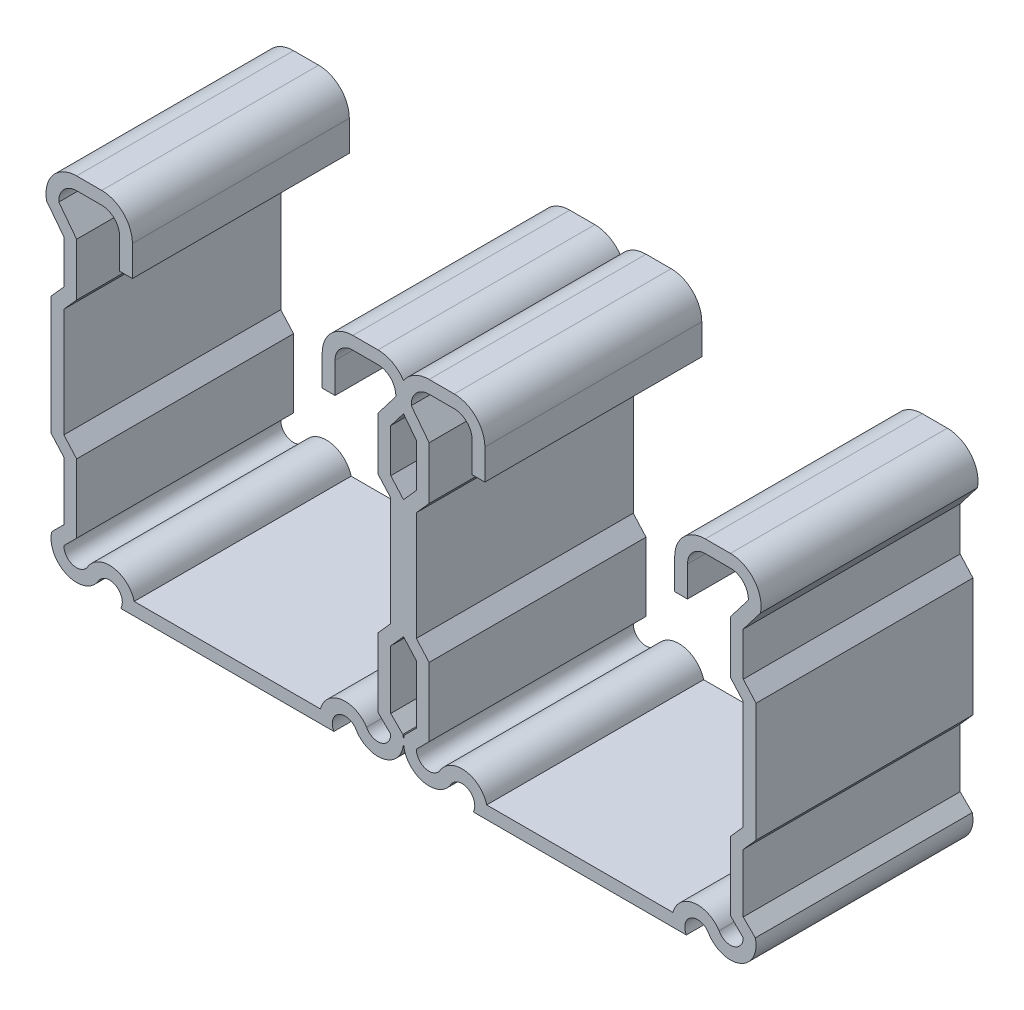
ISO-10303-21;
HEADER;
FILE_DESCRIPTION(('STEP AP214'),'2;1');
FILE_NAME('part.step','',(''),(''),'','','');
FILE_SCHEMA(('AUTOMOTIVE_DESIGN { 1 0 10303 214 1 1 1 1 }'));
ENDSEC;
DATA;
#1=APPLICATION_CONTEXT('core data for automotive mechanical design processes');
#2=APPLICATION_PROTOCOL_DEFINITION('international standard','automotive_design',2000,#1);
#3=PRODUCT_CONTEXT('',#1,'mechanical');
#4=PRODUCT('Part','Part','',(#3));
#5=PRODUCT_RELATED_PRODUCT_CATEGORY('part','',(#4));
#6=PRODUCT_DEFINITION_FORMATION('','',#4);
#7=PRODUCT_DEFINITION_CONTEXT('part definition',#1,'design');
#8=PRODUCT_DEFINITION('design','',#6,#7);
#9=PRODUCT_DEFINITION_SHAPE('','',#8);
#10=(LENGTH_UNIT() NAMED_UNIT(*) SI_UNIT(.MILLI.,.METRE.));
#11=(NAMED_UNIT(*) PLANE_ANGLE_UNIT() SI_UNIT($,.RADIAN.));
#12=(NAMED_UNIT(*) SI_UNIT($,.STERADIAN.) SOLID_ANGLE_UNIT());
#13=UNCERTAINTY_MEASURE_WITH_UNIT(LENGTH_MEASURE(1.E-05),#10,'distance_accuracy_value','');
#14=(GEOMETRIC_REPRESENTATION_CONTEXT(3) GLOBAL_UNCERTAINTY_ASSIGNED_CONTEXT((#13)) GLOBAL_UNIT_ASSIGNED_CONTEXT((#10,
#11,#12)) REPRESENTATION_CONTEXT('',''));
#15=CARTESIAN_POINT('',(0.,0.,0.));
#16=DIRECTION('',(0.,0.,1.));
#17=DIRECTION('',(1.,0.,0.));
#18=AXIS2_PLACEMENT_3D('',#15,#16,#17);
#19=CARTESIAN_POINT('',(17.6403,-15.478125,12.7));
#20=DIRECTION('',(0.,0.,-1.));
#21=DIRECTION('',(-1.,0.,0.));
#22=AXIS2_PLACEMENT_3D('',#19,#20,#21);
#23=CYLINDRICAL_SURFACE('',#22,2.9972);
#24=DIRECTION('',(0.,0.,-1.));
#25=VECTOR('',#24,1.);
#26=CARTESIAN_POINT('',(20.63623,-15.5653676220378,0.));
#27=LINE('',#26,#25);
#28=CARTESIAN_POINT('',(20.63623,-15.5653676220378,12.7));
#29=VERTEX_POINT('',#28);
#30=CARTESIAN_POINT('',(20.63623,-15.5653676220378,-12.7));
#31=VERTEX_POINT('',#30);
#32=EDGE_CURVE('E759',#29,#31,#27,.T.);
#33=ORIENTED_EDGE('',*,*,#32,.F.);
#34=CARTESIAN_POINT('',(17.6403,-15.478125,12.7));
#35=DIRECTION('',(0.,0.,1.));
#36=DIRECTION('',(-1.,0.,0.));
#37=AXIS2_PLACEMENT_3D('',#34,#35,#36);
#38=CIRCLE('',#37,2.9972);
#39=CARTESIAN_POINT('',(15.0198255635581,-16.9328832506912,12.7));
#40=VERTEX_POINT('',#39);
#41=EDGE_CURVE('E842',#40,#29,#38,.T.);
#42=ORIENTED_EDGE('',*,*,#41,.F.);
#43=DIRECTION('',(0.,0.,-1.));
#44=VECTOR('',#43,1.);
#45=CARTESIAN_POINT('',(15.0198255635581,-16.9328832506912,12.7));
#46=LINE('',#45,#44);
#47=CARTESIAN_POINT('',(15.0198255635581,-16.9328832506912,-12.7));
#48=VERTEX_POINT('',#47);
#49=EDGE_CURVE('E1066',#40,#48,#46,.T.);
#50=ORIENTED_EDGE('',*,*,#49,.T.);
#51=CARTESIAN_POINT('',(17.6403,-15.478125,-12.7));
#52=DIRECTION('',(0.,0.,1.));
#53=DIRECTION('',(-1.,0.,0.));
#54=AXIS2_PLACEMENT_3D('',#51,#52,#53);
#55=CIRCLE('',#54,2.9972);
#56=EDGE_CURVE('E954',#48,#31,#55,.T.);
#57=ORIENTED_EDGE('',*,*,#56,.T.);
#58=EDGE_LOOP('',(#33,#42,#50,#57));
#59=FACE_BOUND('',#58,.T.);
#60=ADVANCED_FACE('F39',(#59),#23,.T.);
#61=DIRECTION('',(0.,0.,-1.));
#62=VECTOR('',#61,1.);
#63=CARTESIAN_POINT('',(20.63623,-15.3908823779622,0.));
#64=LINE('',#63,#62);
#65=CARTESIAN_POINT('',(20.63623,-15.3908823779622,-12.7));
#66=VERTEX_POINT('',#65);
#67=CARTESIAN_POINT('',(20.63623,-15.3908823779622,12.7));
#68=VERTEX_POINT('',#67);
#69=EDGE_CURVE('E756',#66,#68,#64,.F.);
#70=ORIENTED_EDGE('',*,*,#69,.F.);
#71=CARTESIAN_POINT('',(20.5534580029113,-14.773342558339,-12.7));
#72=VERTEX_POINT('',#71);
#73=EDGE_CURVE('E953',#66,#72,#55,.T.);
#74=ORIENTED_EDGE('',*,*,#73,.T.);
#75=DIRECTION('',(0.,0.,-1.));
#76=VECTOR('',#75,1.);
#77=CARTESIAN_POINT('',(20.5534580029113,-14.773342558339,12.7));
#78=LINE('',#77,#76);
#79=CARTESIAN_POINT('',(20.5534580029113,-14.773342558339,12.7));
#80=VERTEX_POINT('',#79);
#81=EDGE_CURVE('E1063',#80,#72,#78,.T.);
#82=ORIENTED_EDGE('',*,*,#81,.F.);
#83=EDGE_CURVE('E841',#68,#80,#38,.T.);
#84=ORIENTED_EDGE('',*,*,#83,.F.);
#85=EDGE_LOOP('',(#70,#74,#82,#84));
#86=FACE_BOUND('',#85,.T.);
#87=ADVANCED_FACE('F1728',(#86),#23,.T.);
#88=CARTESIAN_POINT('',(19.1389,-6.50732941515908,12.7));
#89=DIRECTION('',(-0.746819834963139,0.665026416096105,0.));
#90=DIRECTION('',(-0.665026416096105,-0.746819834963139,0.));
#91=AXIS2_PLACEMENT_3D('',#88,#89,#90);
#92=PLANE('',#91);
#93=DIRECTION('',(0.,0.,-1.));
#94=VECTOR('',#93,1.);
#95=CARTESIAN_POINT('',(20.63623,-4.82583870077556,12.7));
#96=LINE('',#95,#94);
#97=CARTESIAN_POINT('',(20.63623,-4.82583870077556,12.7));
#98=VERTEX_POINT('',#97);
#99=CARTESIAN_POINT('',(20.63623,-4.82583870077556,-12.7));
#100=VERTEX_POINT('',#99);
#101=EDGE_CURVE('E767',#98,#100,#96,.T.);
#102=ORIENTED_EDGE('',*,*,#101,.F.);
#103=DIRECTION('',(0.665026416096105,0.746819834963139,0.));
#104=VECTOR('',#103,1.);
#105=CARTESIAN_POINT('',(19.1389,-6.50732941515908,12.7));
#106=LINE('',#105,#104);
#107=CARTESIAN_POINT('',(19.1389,-6.50732941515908,12.7));
#108=VERTEX_POINT('',#107);
#109=EDGE_CURVE('E848',#108,#98,#106,.T.);
#110=ORIENTED_EDGE('',*,*,#109,.F.);
#111=DIRECTION('',(0.,0.,-1.));
#112=VECTOR('',#111,1.);
#113=CARTESIAN_POINT('',(19.1389,-6.50732941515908,12.7));
#114=LINE('',#113,#112);
#115=CARTESIAN_POINT('',(19.1389,-6.50732941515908,-12.7));
#116=VERTEX_POINT('',#115);
#117=EDGE_CURVE('E1057',#108,#116,#114,.T.);
#118=ORIENTED_EDGE('',*,*,#117,.T.);
#119=DIRECTION('',(0.665026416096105,0.746819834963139,0.));
#120=VECTOR('',#119,1.);
#121=CARTESIAN_POINT('',(19.1389,-6.50732941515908,-12.7));
#122=LINE('',#121,#120);
#123=EDGE_CURVE('E960',#116,#100,#122,.T.);
#124=ORIENTED_EDGE('',*,*,#123,.T.);
#125=EDGE_LOOP('',(#102,#110,#118,#124));
#126=FACE_BOUND('',#125,.T.);
#127=ADVANCED_FACE('F1735',(#126),#92,.F.);
#128=CARTESIAN_POINT('',(19.1389,10.7491294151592,12.7));
#129=DIRECTION('',(-0.746819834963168,-0.665026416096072,0.));
#130=DIRECTION('',(0.665026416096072,-0.746819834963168,0.));
#131=AXIS2_PLACEMENT_3D('',#128,#129,#130);
#132=PLANE('',#131);
#133=DIRECTION('',(0.,0.,1.));
#134=VECTOR('',#133,1.);
#135=CARTESIAN_POINT('',(20.63623,9.06763870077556,12.7));
#136=LINE('',#135,#134);
#137=CARTESIAN_POINT('',(20.63623,9.06763870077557,-12.7));
#138=VERTEX_POINT('',#137);
#139=CARTESIAN_POINT('',(20.63623,9.06763870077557,12.7));
#140=VERTEX_POINT('',#139);
#141=EDGE_CURVE('E770',#138,#140,#136,.T.);
#142=ORIENTED_EDGE('',*,*,#141,.F.);
#143=DIRECTION('',(-0.665026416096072,0.746819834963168,0.));
#144=VECTOR('',#143,1.);
#145=CARTESIAN_POINT('',(19.1389,10.7491294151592,-12.7));
#146=LINE('',#145,#144);
#147=CARTESIAN_POINT('',(19.1389,10.7491294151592,-12.7));
#148=VERTEX_POINT('',#147);
#149=EDGE_CURVE('E962',#138,#148,#146,.T.);
#150=ORIENTED_EDGE('',*,*,#149,.T.);
#151=DIRECTION('',(0.,0.,-1.));
#152=VECTOR('',#151,1.);
#153=CARTESIAN_POINT('',(19.1389,10.7491294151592,12.7));
#154=LINE('',#153,#152);
#155=CARTESIAN_POINT('',(19.1389,10.7491294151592,12.7));
#156=VERTEX_POINT('',#155);
#157=EDGE_CURVE('E1054',#156,#148,#154,.T.);
#158=ORIENTED_EDGE('',*,*,#157,.F.);
#159=DIRECTION('',(-0.665026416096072,0.746819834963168,0.));
#160=VECTOR('',#159,1.);
#161=CARTESIAN_POINT('',(19.1389,10.7491294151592,12.7));
#162=LINE('',#161,#160);
#163=EDGE_CURVE('E851',#140,#156,#162,.T.);
#164=ORIENTED_EDGE('',*,*,#163,.F.);
#165=EDGE_LOOP('',(#142,#150,#158,#164));
#166=FACE_BOUND('',#165,.T.);
#167=ADVANCED_FACE('F1863',(#166),#132,.F.);
#168=CARTESIAN_POINT('',(19.1389,15.8307359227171,12.7));
#169=DIRECTION('',(-0.793466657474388,0.608613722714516,0.));
#170=DIRECTION('',(-0.608613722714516,-0.793466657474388,0.));
#171=AXIS2_PLACEMENT_3D('',#168,#169,#170);
#172=PLANE('',#171);
#173=DIRECTION('',(0.,0.,-1.));
#174=VECTOR('',#173,1.);
#175=CARTESIAN_POINT('',(20.63623,17.782846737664,12.7));
#176=LINE('',#175,#174);
#177=CARTESIAN_POINT('',(20.63623,17.782846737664,12.7));
#178=VERTEX_POINT('',#177);
#179=CARTESIAN_POINT('',(20.63623,17.782846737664,-12.7));
#180=VERTEX_POINT('',#179);
#181=EDGE_CURVE('E62',#178,#180,#176,.T.);
#182=ORIENTED_EDGE('',*,*,#181,.F.);
#183=DIRECTION('',(0.608613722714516,0.793466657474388,0.));
#184=VECTOR('',#183,1.);
#185=CARTESIAN_POINT('',(19.1389,15.8307359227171,12.7));
#186=LINE('',#185,#184);
#187=CARTESIAN_POINT('',(19.1389,15.8307359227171,12.7));
#188=VERTEX_POINT('',#187);
#189=EDGE_CURVE('E855',#188,#178,#186,.T.);
#190=ORIENTED_EDGE('',*,*,#189,.F.);
#191=DIRECTION('',(0.,0.,-1.));
#192=VECTOR('',#191,1.);
#193=CARTESIAN_POINT('',(19.1389,15.8307359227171,12.7));
#194=LINE('',#193,#192);
#195=CARTESIAN_POINT('',(19.1389,15.8307359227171,-12.7));
#196=VERTEX_POINT('',#195);
#197=EDGE_CURVE('E1051',#188,#196,#194,.T.);
#198=ORIENTED_EDGE('',*,*,#197,.T.);
#199=DIRECTION('',(0.608613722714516,0.793466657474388,0.));
#200=VECTOR('',#199,1.);
#201=CARTESIAN_POINT('',(19.1389,15.8307359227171,-12.7));
#202=LINE('',#201,#200);
#203=EDGE_CURVE('E966',#196,#180,#202,.T.);
#204=ORIENTED_EDGE('',*,*,#203,.T.);
#205=EDGE_LOOP('',(#182,#190,#198,#204));
#206=FACE_BOUND('',#205,.T.);
#207=ADVANCED_FACE('F1857',(#206),#172,.F.);
#208=CARTESIAN_POINT('',(17.6403,19.1676263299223,12.7));
#209=DIRECTION('',(0.,0.,-1.));
#210=DIRECTION('',(-1.,0.,0.));
#211=AXIS2_PLACEMENT_3D('',#208,#209,#210);
#212=CYLINDRICAL_SURFACE('',#211,3.59077367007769);
#213=DIRECTION('',(0.,0.,-1.));
#214=VECTOR('',#213,1.);
#215=CARTESIAN_POINT('',(20.63623,21.1470350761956,0.));
#216=LINE('',#215,#214);
#217=CARTESIAN_POINT('',(20.63623,21.1470350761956,-12.7));
#218=VERTEX_POINT('',#217);
#219=CARTESIAN_POINT('',(20.63623,21.1470350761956,12.7));
#220=VERTEX_POINT('',#219);
#221=EDGE_CURVE('E774',#218,#220,#216,.F.);
#222=ORIENTED_EDGE('',*,*,#221,.F.);
#223=CARTESIAN_POINT('',(17.6403,19.1676263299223,-12.7));
#224=DIRECTION('',(0.,0.,1.));
#225=DIRECTION('',(-1.,0.,0.));
#226=AXIS2_PLACEMENT_3D('',#223,#224,#225);
#227=CIRCLE('',#226,3.59077367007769);
#228=CARTESIAN_POINT('',(17.6403,22.7584,-12.7));
#229=VERTEX_POINT('',#228);
#230=EDGE_CURVE('E968',#218,#229,#227,.T.);
#231=ORIENTED_EDGE('',*,*,#230,.T.);
#232=DIRECTION('',(0.,0.,-1.));
#233=VECTOR('',#232,1.);
#234=CARTESIAN_POINT('',(17.6403,22.7584,12.7));
#235=LINE('',#234,#233);
#236=CARTESIAN_POINT('',(17.6403,22.7584,12.7));
#237=VERTEX_POINT('',#236);
#238=EDGE_CURVE('E1048',#237,#229,#235,.T.);
#239=ORIENTED_EDGE('',*,*,#238,.F.);
#240=CARTESIAN_POINT('',(17.6403,19.1676263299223,12.7));
#241=DIRECTION('',(0.,0.,1.));
#242=DIRECTION('',(-1.,0.,0.));
#243=AXIS2_PLACEMENT_3D('',#240,#241,#242);
#244=CIRCLE('',#243,3.59077367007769);
#245=EDGE_CURVE('E54',#220,#237,#244,.T.);
#246=ORIENTED_EDGE('',*,*,#245,.F.);
#247=EDGE_LOOP('',(#222,#231,#239,#246));
#248=FACE_BOUND('',#247,.T.);
#249=ADVANCED_FACE('F1261',(#248),#212,.T.);
#250=CARTESIAN_POINT('',(13.7938113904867,-17.794678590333,12.7));
#251=DIRECTION('',(0.,0.,-1.));
#252=DIRECTION('',(-1.,0.,0.));
#253=AXIS2_PLACEMENT_3D('',#250,#251,#252);
#254=CYLINDRICAL_SURFACE('',#253,2.9972);
#255=CARTESIAN_POINT('',(13.7938113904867,-17.794678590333,-12.7));
#256=DIRECTION('',(0.,0.,1.));
#257=DIRECTION('',(1.,0.,0.));
#258=AXIS2_PLACEMENT_3D('',#255,#256,#257);
#259=CIRCLE('',#258,2.9972);
#260=CARTESIAN_POINT('',(16.3051886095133,-16.158771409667,-12.7));
#261=VERTEX_POINT('',#260);
#262=CARTESIAN_POINT('',(10.8989921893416,-17.018,-12.7));
#263=VERTEX_POINT('',#262);
#264=EDGE_CURVE('E776',#261,#263,#259,.T.);
#265=ORIENTED_EDGE('',*,*,#264,.T.);
#266=DIRECTION('',(0.,0.,-1.));
#267=VECTOR('',#266,1.);
#268=CARTESIAN_POINT('',(10.8989921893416,-17.018,12.7));
#269=LINE('',#268,#267);
#270=CARTESIAN_POINT('',(10.8989921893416,-17.018,12.7));
#271=VERTEX_POINT('',#270);
#272=EDGE_CURVE('E11',#271,#263,#269,.T.);
#273=ORIENTED_EDGE('',*,*,#272,.F.);
#274=CARTESIAN_POINT('',(13.7938113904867,-17.794678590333,12.7));
#275=DIRECTION('',(0.,0.,1.));
#276=DIRECTION('',(1.,0.,0.));
#277=AXIS2_PLACEMENT_3D('',#274,#275,#276);
#278=CIRCLE('',#277,2.9972);
#279=CARTESIAN_POINT('',(16.3051886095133,-16.158771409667,12.7));
#280=VERTEX_POINT('',#279);
#281=EDGE_CURVE('E777',#280,#271,#278,.T.);
#282=ORIENTED_EDGE('',*,*,#281,.F.);
#283=DIRECTION('',(0.,0.,-1.));
#284=VECTOR('',#283,1.);
#285=CARTESIAN_POINT('',(16.3051886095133,-16.158771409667,12.7));
#286=LINE('',#285,#284);
#287=EDGE_CURVE('E890',#280,#261,#286,.T.);
#288=ORIENTED_EDGE('',*,*,#287,.T.);
#289=EDGE_LOOP('',(#265,#273,#282,#288));
#290=FACE_BOUND('',#289,.T.);
#291=ADVANCED_FACE('F41',(#290),#254,.T.);
#292=CARTESIAN_POINT('',(-10.8989921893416,-17.018,12.7));
#293=DIRECTION('',(0.,-1.,0.));
#294=DIRECTION('',(1.,0.,0.));
#295=AXIS2_PLACEMENT_3D('',#292,#293,#294);
#296=PLANE('',#295);
#297=DIRECTION('',(-1.,0.,0.));
#298=VECTOR('',#297,1.);
#299=CARTESIAN_POINT('',(-10.8989921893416,-17.018,-12.7));
#300=LINE('',#299,#298);
#301=CARTESIAN_POINT('',(-10.8989921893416,-17.018,-12.7));
#302=VERTEX_POINT('',#301);
#303=EDGE_CURVE('E893',#263,#302,#300,.T.);
#304=ORIENTED_EDGE('',*,*,#303,.T.);
#305=DIRECTION('',(0.,0.,-1.));
#306=VECTOR('',#305,1.);
#307=CARTESIAN_POINT('',(-10.8989921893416,-17.018,12.7));
#308=LINE('',#307,#306);
#309=CARTESIAN_POINT('',(-10.8989921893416,-17.018,12.7));
#310=VERTEX_POINT('',#309);
#311=EDGE_CURVE('E47',#310,#302,#308,.T.);
#312=ORIENTED_EDGE('',*,*,#311,.F.);
#313=DIRECTION('',(-1.,0.,0.));
#314=VECTOR('',#313,1.);
#315=CARTESIAN_POINT('',(-10.8989921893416,-17.018,12.7));
#316=LINE('',#315,#314);
#317=EDGE_CURVE('E780',#271,#310,#316,.T.);
#318=ORIENTED_EDGE('',*,*,#317,.F.);
#319=ORIENTED_EDGE('',*,*,#272,.T.);
#320=EDGE_LOOP('',(#304,#312,#318,#319));
#321=FACE_BOUND('',#320,.T.);
#322=ADVANCED_FACE('F1178',(#321),#296,.F.);
#323=CARTESIAN_POINT('',(-13.7938113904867,-17.794678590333,12.7));
#324=DIRECTION('',(0.,0.,-1.));
#325=DIRECTION('',(-1.,0.,0.));
#326=AXIS2_PLACEMENT_3D('',#323,#324,#325);
#327=CYLINDRICAL_SURFACE('',#326,2.9972);
#328=CARTESIAN_POINT('',(-13.7938113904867,-17.794678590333,-12.7));
#329=DIRECTION('',(0.,0.,1.));
#330=DIRECTION('',(-1.,0.,0.));
#331=AXIS2_PLACEMENT_3D('',#328,#329,#330);
#332=CIRCLE('',#331,2.9972);
#333=CARTESIAN_POINT('',(-16.4142858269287,-16.3399203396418,-12.7));
#334=VERTEX_POINT('',#333);
#335=EDGE_CURVE('E895',#302,#334,#332,.T.);
#336=ORIENTED_EDGE('',*,*,#335,.T.);
#337=DIRECTION('',(0.,0.,-1.));
#338=VECTOR('',#337,1.);
#339=CARTESIAN_POINT('',(-16.4142858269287,-16.3399203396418,12.7));
#340=LINE('',#339,#338);
#341=CARTESIAN_POINT('',(-16.4142858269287,-16.3399203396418,12.7));
#342=VERTEX_POINT('',#341);
#343=EDGE_CURVE('E1150',#342,#334,#340,.T.);
#344=ORIENTED_EDGE('',*,*,#343,.F.);
#345=CARTESIAN_POINT('',(-13.7938113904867,-17.794678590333,12.7));
#346=DIRECTION('',(0.,0.,1.));
#347=DIRECTION('',(-1.,0.,0.));
#348=AXIS2_PLACEMENT_3D('',#345,#346,#347);
#349=CIRCLE('',#348,2.9972);
#350=EDGE_CURVE('E783',#310,#342,#349,.T.);
#351=ORIENTED_EDGE('',*,*,#350,.F.);
#352=ORIENTED_EDGE('',*,*,#311,.T.);
#353=EDGE_LOOP('',(#336,#344,#351,#352));
#354=FACE_BOUND('',#353,.T.);
#355=ADVANCED_FACE('F1157',(#354),#327,.T.);
#356=CARTESIAN_POINT('',(-17.6403,-15.478125,12.7));
#357=DIRECTION('',(0.,0.,-1.));
#358=DIRECTION('',(-1.,0.,0.));
#359=AXIS2_PLACEMENT_3D('',#356,#357,#358);
#360=CYLINDRICAL_SURFACE('',#359,1.4986);
#361=CARTESIAN_POINT('',(-17.6403,-15.478125,-12.7));
#362=DIRECTION('',(0.,0.,-1.));
#363=DIRECTION('',(1.,0.,0.));
#364=AXIS2_PLACEMENT_3D('',#361,#362,#363);
#365=CIRCLE('',#364,1.4986);
#366=CARTESIAN_POINT('',(-19.1389,-15.478125,-12.7));
#367=VERTEX_POINT('',#366);
#368=EDGE_CURVE('E897',#334,#367,#365,.T.);
#369=ORIENTED_EDGE('',*,*,#368,.T.);
#370=DIRECTION('',(0.,0.,-1.));
#371=VECTOR('',#370,1.);
#372=CARTESIAN_POINT('',(-19.1389,-15.478125,12.7));
#373=LINE('',#372,#371);
#374=CARTESIAN_POINT('',(-19.1389,-15.478125,12.7));
#375=VERTEX_POINT('',#374);
#376=EDGE_CURVE('E1147',#375,#367,#373,.T.);
#377=ORIENTED_EDGE('',*,*,#376,.F.);
#378=CARTESIAN_POINT('',(-17.6403,-15.478125,12.7));
#379=DIRECTION('',(0.,0.,-1.));
#380=DIRECTION('',(1.,0.,0.));
#381=AXIS2_PLACEMENT_3D('',#378,#379,#380);
#382=CIRCLE('',#381,1.4986);
#383=EDGE_CURVE('E785',#342,#375,#382,.T.);
#384=ORIENTED_EDGE('',*,*,#383,.F.);
#385=ORIENTED_EDGE('',*,*,#343,.T.);
#386=EDGE_LOOP('',(#369,#377,#384,#385));
#387=FACE_BOUND('',#386,.T.);
#388=ADVANCED_FACE('F1168',(#387),#360,.F.);
#389=CARTESIAN_POINT('',(-17.6403,-13.979525,12.7));
#390=DIRECTION('',(-0.707106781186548,0.707106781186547,0.));
#391=DIRECTION('',(-0.707106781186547,-0.707106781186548,0.));
#392=AXIS2_PLACEMENT_3D('',#389,#390,#391);
#393=PLANE('',#392);
#394=DIRECTION('',(0.707106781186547,0.707106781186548,0.));
#395=VECTOR('',#394,1.);
#396=CARTESIAN_POINT('',(-17.6403,-13.979525,-12.7));
#397=LINE('',#396,#395);
#398=CARTESIAN_POINT('',(-17.6403,-13.979525,-12.7));
#399=VERTEX_POINT('',#398);
#400=EDGE_CURVE('E899',#367,#399,#397,.T.);
#401=ORIENTED_EDGE('',*,*,#400,.T.);
#402=DIRECTION('',(0.,0.,-1.));
#403=VECTOR('',#402,1.);
#404=CARTESIAN_POINT('',(-17.6403,-13.979525,12.7));
#405=LINE('',#404,#403);
#406=CARTESIAN_POINT('',(-17.6403,-13.979525,12.7));
#407=VERTEX_POINT('',#406);
#408=EDGE_CURVE('E1144',#407,#399,#405,.T.);
#409=ORIENTED_EDGE('',*,*,#408,.F.);
#410=DIRECTION('',(0.707106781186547,0.707106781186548,0.));
#411=VECTOR('',#410,1.);
#412=CARTESIAN_POINT('',(-17.6403,-13.979525,12.7));
#413=LINE('',#412,#411);
#414=EDGE_CURVE('E787',#375,#407,#413,.T.);
#415=ORIENTED_EDGE('',*,*,#414,.F.);
#416=ORIENTED_EDGE('',*,*,#376,.T.);
#417=EDGE_LOOP('',(#401,#409,#415,#416));
#418=FACE_BOUND('',#417,.T.);
#419=ADVANCED_FACE('F1172',(#418),#393,.F.);
#420=CARTESIAN_POINT('',(-17.6403,-13.979525,12.7));
#421=DIRECTION('',(-1.,0.,0.));
#422=DIRECTION('',(0.,-1.,0.));
#423=AXIS2_PLACEMENT_3D('',#420,#421,#422);
#424=PLANE('',#423);
#425=DIRECTION('',(0.,1.,0.));
#426=VECTOR('',#425,1.);
#427=CARTESIAN_POINT('',(-17.6403,-13.979525,-12.7));
#428=LINE('',#427,#426);
#429=CARTESIAN_POINT('',(-17.6403,-5.93680201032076,-12.7));
#430=VERTEX_POINT('',#429);
#431=EDGE_CURVE('E901',#399,#430,#428,.T.);
#432=ORIENTED_EDGE('',*,*,#431,.T.);
#433=DIRECTION('',(0.,0.,-1.));
#434=VECTOR('',#433,1.);
#435=CARTESIAN_POINT('',(-17.6403,-5.93680201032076,12.7));
#436=LINE('',#435,#434);
#437=CARTESIAN_POINT('',(-17.6403,-5.93680201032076,12.7));
#438=VERTEX_POINT('',#437);
#439=EDGE_CURVE('E1141',#438,#430,#436,.T.);
#440=ORIENTED_EDGE('',*,*,#439,.F.);
#441=DIRECTION('',(0.,1.,0.));
#442=VECTOR('',#441,1.);
#443=CARTESIAN_POINT('',(-17.6403,-13.979525,12.7));
#444=LINE('',#443,#442);
#445=EDGE_CURVE('E789',#407,#438,#444,.T.);
#446=ORIENTED_EDGE('',*,*,#445,.F.);
#447=ORIENTED_EDGE('',*,*,#408,.T.);
#448=EDGE_LOOP('',(#432,#440,#446,#447));
#449=FACE_BOUND('',#448,.T.);
#450=ADVANCED_FACE('F1840',(#449),#424,.F.);
#451=CARTESIAN_POINT('',(-17.6403,-5.93680201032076,12.7));
#452=DIRECTION('',(-0.746819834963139,-0.665026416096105,0.));
#453=DIRECTION('',(0.665026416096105,-0.746819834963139,0.));
#454=AXIS2_PLACEMENT_3D('',#451,#452,#453);
#455=PLANE('',#454);
#456=DIRECTION('',(-0.665026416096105,0.746819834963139,0.));
#457=VECTOR('',#456,1.);
#458=CARTESIAN_POINT('',(-17.6403,-5.93680201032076,-12.7));
#459=LINE('',#458,#457);
#460=CARTESIAN_POINT('',(-19.1389,-4.25388509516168,-12.7));
#461=VERTEX_POINT('',#460);
#462=EDGE_CURVE('E903',#430,#461,#459,.T.);
#463=ORIENTED_EDGE('',*,*,#462,.T.);
#464=DIRECTION('',(0.,0.,-1.));
#465=VECTOR('',#464,1.);
#466=CARTESIAN_POINT('',(-19.1389,-4.25388509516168,12.7));
#467=LINE('',#466,#465);
#468=CARTESIAN_POINT('',(-19.1389,-4.25388509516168,12.7));
#469=VERTEX_POINT('',#468);
#470=EDGE_CURVE('E1138',#469,#461,#467,.T.);
#471=ORIENTED_EDGE('',*,*,#470,.F.);
#472=DIRECTION('',(-0.665026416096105,0.746819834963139,0.));
#473=VECTOR('',#472,1.);
#474=CARTESIAN_POINT('',(-17.6403,-5.93680201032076,12.7));
#475=LINE('',#474,#473);
#476=EDGE_CURVE('E791',#438,#469,#475,.T.);
#477=ORIENTED_EDGE('',*,*,#476,.F.);
#478=ORIENTED_EDGE('',*,*,#439,.T.);
#479=EDGE_LOOP('',(#463,#471,#477,#478));
#480=FACE_BOUND('',#479,.T.);
#481=ADVANCED_FACE('F1836',(#480),#455,.F.);
#482=CARTESIAN_POINT('',(-19.1389,-4.25388509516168,12.7));
#483=DIRECTION('',(-1.,0.,0.));
#484=DIRECTION('',(0.,0.,1.));
#485=AXIS2_PLACEMENT_3D('',#482,#483,#484);
#486=PLANE('',#485);
#487=DIRECTION('',(0.,1.,0.));
#488=VECTOR('',#487,1.);
#489=CARTESIAN_POINT('',(-19.1389,-4.25388509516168,-12.7));
#490=LINE('',#489,#488);
#491=CARTESIAN_POINT('',(-19.1389,8.49568509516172,-12.7));
#492=VERTEX_POINT('',#491);
#493=EDGE_CURVE('E905',#461,#492,#490,.T.);
#494=ORIENTED_EDGE('',*,*,#493,.T.);
#495=DIRECTION('',(0.,0.,-1.));
#496=VECTOR('',#495,1.);
#497=CARTESIAN_POINT('',(-19.1389,8.49568509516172,12.7));
#498=LINE('',#497,#496);
#499=CARTESIAN_POINT('',(-19.1389,8.49568509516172,12.7));
#500=VERTEX_POINT('',#499);
#501=EDGE_CURVE('E1135',#500,#492,#498,.T.);
#502=ORIENTED_EDGE('',*,*,#501,.F.);
#503=DIRECTION('',(0.,1.,0.));
#504=VECTOR('',#503,1.);
#505=CARTESIAN_POINT('',(-19.1389,-4.25388509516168,12.7));
#506=LINE('',#505,#504);
#507=EDGE_CURVE('E793',#469,#500,#506,.T.);
#508=ORIENTED_EDGE('',*,*,#507,.F.);
#509=ORIENTED_EDGE('',*,*,#470,.T.);
#510=EDGE_LOOP('',(#494,#502,#508,#509));
#511=FACE_BOUND('',#510,.T.);
#512=ADVANCED_FACE('F1832',(#511),#486,.F.);
#513=CARTESIAN_POINT('',(-17.6403,10.178602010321,12.7));
#514=DIRECTION('',(-0.746819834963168,0.665026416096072,0.));
#515=DIRECTION('',(-0.665026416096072,-0.746819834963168,0.));
#516=AXIS2_PLACEMENT_3D('',#513,#514,#515);
#517=PLANE('',#516);
#518=DIRECTION('',(0.665026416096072,0.746819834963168,0.));
#519=VECTOR('',#518,1.);
#520=CARTESIAN_POINT('',(-17.6403,10.178602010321,-12.7));
#521=LINE('',#520,#519);
#522=CARTESIAN_POINT('',(-17.6403,10.178602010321,-12.7));
#523=VERTEX_POINT('',#522);
#524=EDGE_CURVE('E907',#492,#523,#521,.T.);
#525=ORIENTED_EDGE('',*,*,#524,.T.);
#526=DIRECTION('',(0.,0.,-1.));
#527=VECTOR('',#526,1.);
#528=CARTESIAN_POINT('',(-17.6403,10.178602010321,12.7));
#529=LINE('',#528,#527);
#530=CARTESIAN_POINT('',(-17.6403,10.178602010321,12.7));
#531=VERTEX_POINT('',#530);
#532=EDGE_CURVE('E1132',#531,#523,#529,.T.);
#533=ORIENTED_EDGE('',*,*,#532,.F.);
#534=DIRECTION('',(0.665026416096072,0.746819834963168,0.));
#535=VECTOR('',#534,1.);
#536=CARTESIAN_POINT('',(-17.6403,10.178602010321,12.7));
#537=LINE('',#536,#535);
#538=EDGE_CURVE('E795',#500,#531,#537,.T.);
#539=ORIENTED_EDGE('',*,*,#538,.F.);
#540=ORIENTED_EDGE('',*,*,#501,.T.);
#541=EDGE_LOOP('',(#525,#533,#539,#540));
#542=FACE_BOUND('',#541,.T.);
#543=ADVANCED_FACE('F1828',(#542),#517,.F.);
#544=CARTESIAN_POINT('',(-17.6403,10.178602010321,12.7));
#545=DIRECTION('',(-1.,0.,0.));
#546=DIRECTION('',(0.,0.,1.));
#547=AXIS2_PLACEMENT_3D('',#544,#545,#546);
#548=PLANE('',#547);
#549=DIRECTION('',(0.,1.,0.));
#550=VECTOR('',#549,1.);
#551=CARTESIAN_POINT('',(-17.6403,10.178602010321,-12.7));
#552=LINE('',#551,#550);
#553=CARTESIAN_POINT('',(-17.6403,16.3392865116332,-12.7));
#554=VERTEX_POINT('',#553);
#555=EDGE_CURVE('E909',#523,#554,#552,.T.);
#556=ORIENTED_EDGE('',*,*,#555,.T.);
#557=DIRECTION('',(0.,0.,-1.));
#558=VECTOR('',#557,1.);
#559=CARTESIAN_POINT('',(-17.6403,16.3392865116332,12.7));
#560=LINE('',#559,#558);
#561=CARTESIAN_POINT('',(-17.6403,16.3392865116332,12.7));
#562=VERTEX_POINT('',#561);
#563=EDGE_CURVE('E1129',#562,#554,#560,.T.);
#564=ORIENTED_EDGE('',*,*,#563,.F.);
#565=DIRECTION('',(0.,1.,0.));
#566=VECTOR('',#565,1.);
#567=CARTESIAN_POINT('',(-17.6403,10.178602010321,12.7));
#568=LINE('',#567,#566);
#569=EDGE_CURVE('E797',#531,#562,#568,.T.);
#570=ORIENTED_EDGE('',*,*,#569,.F.);
#571=ORIENTED_EDGE('',*,*,#532,.T.);
#572=EDGE_LOOP('',(#556,#564,#570,#571));
#573=FACE_BOUND('',#572,.T.);
#574=ADVANCED_FACE('F1824',(#573),#548,.F.);
#575=CARTESIAN_POINT('',(-17.6403,16.3392865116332,12.7));
#576=DIRECTION('',(-0.793466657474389,-0.608613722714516,0.));
#577=DIRECTION('',(0.608613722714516,-0.793466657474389,0.));
#578=AXIS2_PLACEMENT_3D('',#575,#576,#577);
#579=PLANE('',#578);
#580=DIRECTION('',(-0.608613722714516,0.793466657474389,0.));
#581=VECTOR('',#580,1.);
#582=CARTESIAN_POINT('',(-17.6403,16.3392865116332,-12.7));
#583=LINE('',#582,#581);
#584=CARTESIAN_POINT('',(-19.7298825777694,19.0635335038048,-12.7));
#585=VERTEX_POINT('',#584);
#586=EDGE_CURVE('E911',#554,#585,#583,.T.);
#587=ORIENTED_EDGE('',*,*,#586,.T.);
#588=DIRECTION('',(0.,0.,-1.));
#589=VECTOR('',#588,1.);
#590=CARTESIAN_POINT('',(-19.7298825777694,19.0635335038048,12.7));
#591=LINE('',#590,#589);
#592=CARTESIAN_POINT('',(-19.7298825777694,19.0635335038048,12.7));
#593=VERTEX_POINT('',#592);
#594=EDGE_CURVE('E1126',#593,#585,#591,.T.);
#595=ORIENTED_EDGE('',*,*,#594,.F.);
#596=DIRECTION('',(-0.608613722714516,0.793466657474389,0.));
#597=VECTOR('',#596,1.);
#598=CARTESIAN_POINT('',(-17.6403,16.3392865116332,12.7));
#599=LINE('',#598,#597);
#600=EDGE_CURVE('E799',#562,#593,#599,.T.);
#601=ORIENTED_EDGE('',*,*,#600,.F.);
#602=ORIENTED_EDGE('',*,*,#563,.T.);
#603=EDGE_LOOP('',(#587,#595,#601,#602));
#604=FACE_BOUND('',#603,.T.);
#605=ADVANCED_FACE('F1820',(#604),#579,.F.);
#606=CARTESIAN_POINT('',(-17.6403,19.1676263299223,12.7));
#607=DIRECTION('',(0.,0.,-1.));
#608=DIRECTION('',(-1.,0.,0.));
#609=AXIS2_PLACEMENT_3D('',#606,#607,#608);
#610=CYLINDRICAL_SURFACE('',#609,2.09217367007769);
#611=CARTESIAN_POINT('',(-17.6403,19.1676263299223,-12.7));
#612=DIRECTION('',(0.,0.,-1.));
#613=DIRECTION('',(1.,0.,0.));
#614=AXIS2_PLACEMENT_3D('',#611,#612,#613);
#615=CIRCLE('',#614,2.09217367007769);
#616=CARTESIAN_POINT('',(-17.6403,21.2598,-12.7));
#617=VERTEX_POINT('',#616);
#618=EDGE_CURVE('E913',#585,#617,#615,.T.);
#619=ORIENTED_EDGE('',*,*,#618,.T.);
#620=DIRECTION('',(0.,0.,-1.));
#621=VECTOR('',#620,1.);
#622=CARTESIAN_POINT('',(-17.6403,21.2598,12.7));
#623=LINE('',#622,#621);
#624=CARTESIAN_POINT('',(-17.6403,21.2598,12.7));
#625=VERTEX_POINT('',#624);
#626=EDGE_CURVE('E1123',#625,#617,#623,.T.);
#627=ORIENTED_EDGE('',*,*,#626,.F.);
#628=CARTESIAN_POINT('',(-17.6403,19.1676263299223,12.7));
#629=DIRECTION('',(0.,0.,-1.));
#630=DIRECTION('',(1.,0.,0.));
#631=AXIS2_PLACEMENT_3D('',#628,#629,#630);
#632=CIRCLE('',#631,2.09217367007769);
#633=EDGE_CURVE('E801',#593,#625,#632,.T.);
#634=ORIENTED_EDGE('',*,*,#633,.F.);
#635=ORIENTED_EDGE('',*,*,#594,.T.);
#636=EDGE_LOOP('',(#619,#627,#634,#635));
#637=FACE_BOUND('',#636,.T.);
#638=ADVANCED_FACE('F1816',(#637),#610,.F.);
#639=CARTESIAN_POINT('',(-17.6403,21.2598,12.7));
#640=DIRECTION('',(0.,1.,0.));
#641=DIRECTION('',(0.,0.,1.));
#642=AXIS2_PLACEMENT_3D('',#639,#640,#641);
#643=PLANE('',#642);
#644=DIRECTION('',(1.,0.,0.));
#645=VECTOR('',#644,1.);
#646=CARTESIAN_POINT('',(-17.6403,21.2598,-12.7));
#647=LINE('',#646,#645);
#648=CARTESIAN_POINT('',(-14.7032736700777,21.2598,-12.7));
#649=VERTEX_POINT('',#648);
#650=EDGE_CURVE('E915',#617,#649,#647,.T.);
#651=ORIENTED_EDGE('',*,*,#650,.T.);
#652=DIRECTION('',(0.,0.,-1.));
#653=VECTOR('',#652,1.);
#654=CARTESIAN_POINT('',(-14.7032736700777,21.2598,12.7));
#655=LINE('',#654,#653);
#656=CARTESIAN_POINT('',(-14.7032736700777,21.2598,12.7));
#657=VERTEX_POINT('',#656);
#658=EDGE_CURVE('E1120',#657,#649,#655,.T.);
#659=ORIENTED_EDGE('',*,*,#658,.F.);
#660=DIRECTION('',(1.,0.,0.));
#661=VECTOR('',#660,1.);
#662=CARTESIAN_POINT('',(-17.6403,21.2598,12.7));
#663=LINE('',#662,#661);
#664=EDGE_CURVE('E803',#625,#657,#663,.T.);
#665=ORIENTED_EDGE('',*,*,#664,.F.);
#666=ORIENTED_EDGE('',*,*,#626,.T.);
#667=EDGE_LOOP('',(#651,#659,#665,#666));
#668=FACE_BOUND('',#667,.T.);
#669=ADVANCED_FACE('F1812',(#668),#643,.F.);
#670=CARTESIAN_POINT('',(-14.7032736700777,19.1676263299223,12.7));
#671=DIRECTION('',(0.,0.,-1.));
#672=DIRECTION('',(-1.,0.,0.));
#673=AXIS2_PLACEMENT_3D('',#670,#671,#672);
#674=CYLINDRICAL_SURFACE('',#673,2.09217367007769);
#675=CARTESIAN_POINT('',(-14.7032736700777,19.1676263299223,-12.7));
#676=DIRECTION('',(0.,0.,-1.));
#677=DIRECTION('',(1.,0.,0.));
#678=AXIS2_PLACEMENT_3D('',#675,#676,#677);
#679=CIRCLE('',#678,2.09217367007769);
#680=CARTESIAN_POINT('',(-12.6111,19.1676263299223,-12.7));
#681=VERTEX_POINT('',#680);
#682=EDGE_CURVE('E917',#649,#681,#679,.T.);
#683=ORIENTED_EDGE('',*,*,#682,.T.);
#684=DIRECTION('',(0.,0.,-1.));
#685=VECTOR('',#684,1.);
#686=CARTESIAN_POINT('',(-12.6111,19.1676263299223,12.7));
#687=LINE('',#686,#685);
#688=CARTESIAN_POINT('',(-12.6111,19.1676263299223,12.7));
#689=VERTEX_POINT('',#688);
#690=EDGE_CURVE('E1117',#689,#681,#687,.T.);
#691=ORIENTED_EDGE('',*,*,#690,.F.);
#692=CARTESIAN_POINT('',(-14.7032736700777,19.1676263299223,12.7));
#693=DIRECTION('',(0.,0.,-1.));
#694=DIRECTION('',(1.,0.,0.));
#695=AXIS2_PLACEMENT_3D('',#692,#693,#694);
#696=CIRCLE('',#695,2.09217367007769);
#697=EDGE_CURVE('E805',#657,#689,#696,.T.);
#698=ORIENTED_EDGE('',*,*,#697,.F.);
#699=ORIENTED_EDGE('',*,*,#658,.T.);
#700=EDGE_LOOP('',(#683,#691,#698,#699));
#701=FACE_BOUND('',#700,.T.);
#702=ADVANCED_FACE('F1808',(#701),#674,.F.);
#703=CARTESIAN_POINT('',(-12.6111,19.1676263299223,12.7));
#704=DIRECTION('',(1.,0.,0.));
#705=DIRECTION('',(0.,0.,-1.));
#706=AXIS2_PLACEMENT_3D('',#703,#704,#705);
#707=PLANE('',#706);
#708=DIRECTION('',(0.,-1.,0.));
#709=VECTOR('',#708,1.);
#710=CARTESIAN_POINT('',(-12.6111,19.1676263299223,-12.7));
#711=LINE('',#710,#709);
#712=CARTESIAN_POINT('',(-12.6111,15.61465,-12.7));
#713=VERTEX_POINT('',#712);
#714=EDGE_CURVE('E919',#681,#713,#711,.T.);
#715=ORIENTED_EDGE('',*,*,#714,.T.);
#716=DIRECTION('',(0.,0.,-1.));
#717=VECTOR('',#716,1.);
#718=CARTESIAN_POINT('',(-12.6111,15.61465,12.7));
#719=LINE('',#718,#717);
#720=CARTESIAN_POINT('',(-12.6111,15.61465,12.7));
#721=VERTEX_POINT('',#720);
#722=EDGE_CURVE('E1114',#721,#713,#719,.T.);
#723=ORIENTED_EDGE('',*,*,#722,.F.);
#724=DIRECTION('',(0.,-1.,0.));
#725=VECTOR('',#724,1.);
#726=CARTESIAN_POINT('',(-12.6111,19.1676263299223,12.7));
#727=LINE('',#726,#725);
#728=EDGE_CURVE('E807',#689,#721,#727,.T.);
#729=ORIENTED_EDGE('',*,*,#728,.F.);
#730=ORIENTED_EDGE('',*,*,#690,.T.);
#731=EDGE_LOOP('',(#715,#723,#729,#730));
#732=FACE_BOUND('',#731,.T.);
#733=ADVANCED_FACE('F1804',(#732),#707,.F.);
#734=CARTESIAN_POINT('',(-12.6111,15.61465,12.7));
#735=DIRECTION('',(0.,1.,0.));
#736=DIRECTION('',(0.,0.,1.));
#737=AXIS2_PLACEMENT_3D('',#734,#735,#736);
#738=PLANE('',#737);
#739=DIRECTION('',(1.,0.,0.));
#740=VECTOR('',#739,1.);
#741=CARTESIAN_POINT('',(-12.6111,15.61465,-12.7));
#742=LINE('',#741,#740);
#743=CARTESIAN_POINT('',(-11.1125,15.61465,-12.7));
#744=VERTEX_POINT('',#743);
#745=EDGE_CURVE('E921',#713,#744,#742,.T.);
#746=ORIENTED_EDGE('',*,*,#745,.T.);
#747=DIRECTION('',(0.,0.,-1.));
#748=VECTOR('',#747,1.);
#749=CARTESIAN_POINT('',(-11.1125,15.61465,12.7));
#750=LINE('',#749,#748);
#751=CARTESIAN_POINT('',(-11.1125,15.61465,12.7));
#752=VERTEX_POINT('',#751);
#753=EDGE_CURVE('E1111',#752,#744,#750,.T.);
#754=ORIENTED_EDGE('',*,*,#753,.F.);
#755=DIRECTION('',(1.,0.,0.));
#756=VECTOR('',#755,1.);
#757=CARTESIAN_POINT('',(-12.6111,15.61465,12.7));
#758=LINE('',#757,#756);
#759=EDGE_CURVE('E809',#721,#752,#758,.T.);
#760=ORIENTED_EDGE('',*,*,#759,.F.);
#761=ORIENTED_EDGE('',*,*,#722,.T.);
#762=EDGE_LOOP('',(#746,#754,#760,#761));
#763=FACE_BOUND('',#762,.T.);
#764=ADVANCED_FACE('F1800',(#763),#738,.F.);
#765=CARTESIAN_POINT('',(-11.1125,19.1676263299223,12.7));
#766=DIRECTION('',(-1.,0.,0.));
#767=DIRECTION('',(0.,0.,1.));
#768=AXIS2_PLACEMENT_3D('',#765,#766,#767);
#769=PLANE('',#768);
#770=DIRECTION('',(0.,1.,0.));
#771=VECTOR('',#770,1.);
#772=CARTESIAN_POINT('',(-11.1125,19.1676263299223,-12.7));
#773=LINE('',#772,#771);
#774=CARTESIAN_POINT('',(-11.1125,19.1676263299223,-12.7));
#775=VERTEX_POINT('',#774);
#776=EDGE_CURVE('E923',#744,#775,#773,.T.);
#777=ORIENTED_EDGE('',*,*,#776,.T.);
#778=DIRECTION('',(0.,0.,-1.));
#779=VECTOR('',#778,1.);
#780=CARTESIAN_POINT('',(-11.1125,19.1676263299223,12.7));
#781=LINE('',#780,#779);
#782=CARTESIAN_POINT('',(-11.1125,19.1676263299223,12.7));
#783=VERTEX_POINT('',#782);
#784=EDGE_CURVE('E1108',#783,#775,#781,.T.);
#785=ORIENTED_EDGE('',*,*,#784,.F.);
#786=DIRECTION('',(0.,1.,0.));
#787=VECTOR('',#786,1.);
#788=CARTESIAN_POINT('',(-11.1125,19.1676263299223,12.7));
#789=LINE('',#788,#787);
#790=EDGE_CURVE('E811',#752,#783,#789,.T.);
#791=ORIENTED_EDGE('',*,*,#790,.F.);
#792=ORIENTED_EDGE('',*,*,#753,.T.);
#793=EDGE_LOOP('',(#777,#785,#791,#792));
#794=FACE_BOUND('',#793,.T.);
#795=ADVANCED_FACE('F1796',(#794),#769,.F.);
#796=CARTESIAN_POINT('',(-14.7032736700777,19.1676263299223,12.7));
#797=DIRECTION('',(0.,0.,-1.));
#798=DIRECTION('',(-1.,0.,0.));
#799=AXIS2_PLACEMENT_3D('',#796,#797,#798);
#800=CYLINDRICAL_SURFACE('',#799,3.59077367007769);
#801=CARTESIAN_POINT('',(-14.7032736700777,19.1676263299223,-12.7));
#802=DIRECTION('',(0.,0.,1.));
#803=DIRECTION('',(1.,0.,0.));
#804=AXIS2_PLACEMENT_3D('',#801,#802,#803);
#805=CIRCLE('',#804,3.59077367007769);
#806=CARTESIAN_POINT('',(-14.7032736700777,22.7584,-12.7));
#807=VERTEX_POINT('',#806);
#808=EDGE_CURVE('E925',#775,#807,#805,.T.);
#809=ORIENTED_EDGE('',*,*,#808,.T.);
#810=DIRECTION('',(0.,0.,-1.));
#811=VECTOR('',#810,1.);
#812=CARTESIAN_POINT('',(-14.7032736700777,22.7584,12.7));
#813=LINE('',#812,#811);
#814=CARTESIAN_POINT('',(-14.7032736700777,22.7584,12.7));
#815=VERTEX_POINT('',#814);
#816=EDGE_CURVE('E1105',#815,#807,#813,.T.);
#817=ORIENTED_EDGE('',*,*,#816,.F.);
#818=CARTESIAN_POINT('',(-14.7032736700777,19.1676263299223,12.7));
#819=DIRECTION('',(0.,0.,1.));
#820=DIRECTION('',(1.,0.,0.));
#821=AXIS2_PLACEMENT_3D('',#818,#819,#820);
#822=CIRCLE('',#821,3.59077367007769);
#823=EDGE_CURVE('E813',#783,#815,#822,.T.);
#824=ORIENTED_EDGE('',*,*,#823,.F.);
#825=ORIENTED_EDGE('',*,*,#784,.T.);
#826=EDGE_LOOP('',(#809,#817,#824,#825));
#827=FACE_BOUND('',#826,.T.);
#828=ADVANCED_FACE('F1792',(#827),#800,.T.);
#829=CARTESIAN_POINT('',(-17.6403,22.7584,12.7));
#830=DIRECTION('',(0.,-1.,0.));
#831=DIRECTION('',(1.,0.,0.));
#832=AXIS2_PLACEMENT_3D('',#829,#830,#831);
#833=PLANE('',#832);
#834=DIRECTION('',(-1.,0.,0.));
#835=VECTOR('',#834,1.);
#836=CARTESIAN_POINT('',(-17.6403,22.7584,-12.7));
#837=LINE('',#836,#835);
#838=CARTESIAN_POINT('',(-17.6403,22.7584,-12.7));
#839=VERTEX_POINT('',#838);
#840=EDGE_CURVE('E927',#807,#839,#837,.T.);
#841=ORIENTED_EDGE('',*,*,#840,.T.);
#842=DIRECTION('',(0.,0.,-1.));
#843=VECTOR('',#842,1.);
#844=CARTESIAN_POINT('',(-17.6403,22.7584,12.7));
#845=LINE('',#844,#843);
#846=CARTESIAN_POINT('',(-17.6403,22.7584,12.7));
#847=VERTEX_POINT('',#846);
#848=EDGE_CURVE('E1102',#847,#839,#845,.T.);
#849=ORIENTED_EDGE('',*,*,#848,.F.);
#850=DIRECTION('',(-1.,0.,0.));
#851=VECTOR('',#850,1.);
#852=CARTESIAN_POINT('',(-17.6403,22.7584,12.7));
#853=LINE('',#852,#851);
#854=EDGE_CURVE('E815',#815,#847,#853,.T.);
#855=ORIENTED_EDGE('',*,*,#854,.F.);
#856=ORIENTED_EDGE('',*,*,#816,.T.);
#857=EDGE_LOOP('',(#841,#849,#855,#856));
#858=FACE_BOUND('',#857,.T.);
#859=ADVANCED_FACE('F1788',(#858),#833,.F.);
#860=CARTESIAN_POINT('',(-17.6403,19.1676263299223,12.7));
#861=DIRECTION('',(0.,0.,-1.));
#862=DIRECTION('',(-1.,0.,0.));
#863=AXIS2_PLACEMENT_3D('',#860,#861,#862);
#864=CYLINDRICAL_SURFACE('',#863,3.59077367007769);
#865=CARTESIAN_POINT('',(-17.6403,19.1676263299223,-12.7));
#866=DIRECTION('',(0.,0.,1.));
#867=DIRECTION('',(1.,0.,0.));
#868=AXIS2_PLACEMENT_3D('',#865,#866,#867);
#869=CIRCLE('',#868,3.59077367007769);
#870=CARTESIAN_POINT('',(-21.1624286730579,18.4688666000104,-12.7));
#871=VERTEX_POINT('',#870);
#872=EDGE_CURVE('E929',#839,#871,#869,.T.);
#873=ORIENTED_EDGE('',*,*,#872,.T.);
#874=DIRECTION('',(0.,0.,-1.));
#875=VECTOR('',#874,1.);
#876=CARTESIAN_POINT('',(-21.1624286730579,18.4688666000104,12.7));
#877=LINE('',#876,#875);
#878=CARTESIAN_POINT('',(-21.1624286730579,18.4688666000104,12.7));
#879=VERTEX_POINT('',#878);
#880=EDGE_CURVE('E1099',#879,#871,#877,.T.);
#881=ORIENTED_EDGE('',*,*,#880,.F.);
#882=CARTESIAN_POINT('',(-17.6403,19.1676263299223,12.7));
#883=DIRECTION('',(0.,0.,1.));
#884=DIRECTION('',(1.,0.,0.));
#885=AXIS2_PLACEMENT_3D('',#882,#883,#884);
#886=CIRCLE('',#885,3.59077367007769);
#887=EDGE_CURVE('E817',#847,#879,#886,.T.);
#888=ORIENTED_EDGE('',*,*,#887,.F.);
#889=ORIENTED_EDGE('',*,*,#848,.T.);
#890=EDGE_LOOP('',(#873,#881,#888,#889));
#891=FACE_BOUND('',#890,.T.);
#892=ADVANCED_FACE('F1784',(#891),#864,.T.);
#893=CARTESIAN_POINT('',(-19.1389,15.8307359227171,12.7));
#894=DIRECTION('',(0.793466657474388,0.608613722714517,0.));
#895=DIRECTION('',(-0.608613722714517,0.793466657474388,0.));
#896=AXIS2_PLACEMENT_3D('',#893,#894,#895);
#897=PLANE('',#896);
#898=DIRECTION('',(0.608613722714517,-0.793466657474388,0.));
#899=VECTOR('',#898,1.);
#900=CARTESIAN_POINT('',(-19.1389,15.8307359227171,-12.7));
#901=LINE('',#900,#899);
#902=CARTESIAN_POINT('',(-19.1389,15.8307359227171,-12.7));
#903=VERTEX_POINT('',#902);
#904=EDGE_CURVE('E931',#871,#903,#901,.T.);
#905=ORIENTED_EDGE('',*,*,#904,.T.);
#906=DIRECTION('',(0.,0.,-1.));
#907=VECTOR('',#906,1.);
#908=CARTESIAN_POINT('',(-19.1389,15.8307359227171,12.7));
#909=LINE('',#908,#907);
#910=CARTESIAN_POINT('',(-19.1389,15.8307359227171,12.7));
#911=VERTEX_POINT('',#910);
#912=EDGE_CURVE('E1096',#911,#903,#909,.T.);
#913=ORIENTED_EDGE('',*,*,#912,.F.);
#914=DIRECTION('',(0.608613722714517,-0.793466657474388,0.));
#915=VECTOR('',#914,1.);
#916=CARTESIAN_POINT('',(-19.1389,15.8307359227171,12.7));
#917=LINE('',#916,#915);
#918=EDGE_CURVE('E819',#879,#911,#917,.T.);
#919=ORIENTED_EDGE('',*,*,#918,.F.);
#920=ORIENTED_EDGE('',*,*,#880,.T.);
#921=EDGE_LOOP('',(#905,#913,#919,#920));
#922=FACE_BOUND('',#921,.T.);
#923=ADVANCED_FACE('F1780',(#922),#897,.F.);
#924=CARTESIAN_POINT('',(-19.1389,10.7491294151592,12.7));
#925=DIRECTION('',(1.,0.,0.));
#926=DIRECTION('',(0.,0.,-1.));
#927=AXIS2_PLACEMENT_3D('',#924,#925,#926);
#928=PLANE('',#927);
#929=DIRECTION('',(0.,-1.,0.));
#930=VECTOR('',#929,1.);
#931=CARTESIAN_POINT('',(-19.1389,10.7491294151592,-12.7));
#932=LINE('',#931,#930);
#933=CARTESIAN_POINT('',(-19.1389,10.7491294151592,-12.7));
#934=VERTEX_POINT('',#933);
#935=EDGE_CURVE('E933',#903,#934,#932,.T.);
#936=ORIENTED_EDGE('',*,*,#935,.T.);
#937=DIRECTION('',(0.,0.,-1.));
#938=VECTOR('',#937,1.);
#939=CARTESIAN_POINT('',(-19.1389,10.7491294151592,12.7));
#940=LINE('',#939,#938);
#941=CARTESIAN_POINT('',(-19.1389,10.7491294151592,12.7));
#942=VERTEX_POINT('',#941);
#943=EDGE_CURVE('E1093',#942,#934,#940,.T.);
#944=ORIENTED_EDGE('',*,*,#943,.F.);
#945=DIRECTION('',(0.,-1.,0.));
#946=VECTOR('',#945,1.);
#947=CARTESIAN_POINT('',(-19.1389,10.7491294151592,12.7));
#948=LINE('',#947,#946);
#949=EDGE_CURVE('E821',#911,#942,#948,.T.);
#950=ORIENTED_EDGE('',*,*,#949,.F.);
#951=ORIENTED_EDGE('',*,*,#912,.T.);
#952=EDGE_LOOP('',(#936,#944,#950,#951));
#953=FACE_BOUND('',#952,.T.);
#954=ADVANCED_FACE('F1776',(#953),#928,.F.);
#955=CARTESIAN_POINT('',(-19.1389,10.7491294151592,12.7));
#956=DIRECTION('',(0.746819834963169,-0.665026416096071,0.));
#957=DIRECTION('',(0.665026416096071,0.746819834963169,0.));
#958=AXIS2_PLACEMENT_3D('',#955,#956,#957);
#959=PLANE('',#958);
#960=DIRECTION('',(-0.665026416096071,-0.746819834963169,0.));
#961=VECTOR('',#960,1.);
#962=CARTESIAN_POINT('',(-19.1389,10.7491294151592,-12.7));
#963=LINE('',#962,#961);
#964=CARTESIAN_POINT('',(-20.6375,9.0662125,-12.7));
#965=VERTEX_POINT('',#964);
#966=EDGE_CURVE('E935',#934,#965,#963,.T.);
#967=ORIENTED_EDGE('',*,*,#966,.T.);
#968=DIRECTION('',(0.,0.,-1.));
#969=VECTOR('',#968,1.);
#970=CARTESIAN_POINT('',(-20.6375,9.0662125,12.7));
#971=LINE('',#970,#969);
#972=CARTESIAN_POINT('',(-20.6375,9.0662125,12.7));
#973=VERTEX_POINT('',#972);
#974=EDGE_CURVE('E1090',#973,#965,#971,.T.);
#975=ORIENTED_EDGE('',*,*,#974,.F.);
#976=DIRECTION('',(-0.665026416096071,-0.746819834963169,0.));
#977=VECTOR('',#976,1.);
#978=CARTESIAN_POINT('',(-19.1389,10.7491294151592,12.7));
#979=LINE('',#978,#977);
#980=EDGE_CURVE('E823',#942,#973,#979,.T.);
#981=ORIENTED_EDGE('',*,*,#980,.F.);
#982=ORIENTED_EDGE('',*,*,#943,.T.);
#983=EDGE_LOOP('',(#967,#975,#981,#982));
#984=FACE_BOUND('',#983,.T.);
#985=ADVANCED_FACE('F1772',(#984),#959,.F.);
#986=CARTESIAN_POINT('',(-20.6375,-4.8244125,12.7));
#987=DIRECTION('',(1.,0.,0.));
#988=DIRECTION('',(0.,1.,0.));
#989=AXIS2_PLACEMENT_3D('',#986,#987,#988);
#990=PLANE('',#989);
#991=DIRECTION('',(0.,-1.,0.));
#992=VECTOR('',#991,1.);
#993=CARTESIAN_POINT('',(-20.6375,-4.8244125,-12.7));
#994=LINE('',#993,#992);
#995=CARTESIAN_POINT('',(-20.6375,-4.8244125,-12.7));
#996=VERTEX_POINT('',#995);
#997=EDGE_CURVE('E937',#965,#996,#994,.T.);
#998=ORIENTED_EDGE('',*,*,#997,.T.);
#999=DIRECTION('',(0.,0.,-1.));
#1000=VECTOR('',#999,1.);
#1001=CARTESIAN_POINT('',(-20.6375,-4.8244125,12.7));
#1002=LINE('',#1001,#1000);
#1003=CARTESIAN_POINT('',(-20.6375,-4.8244125,12.7));
#1004=VERTEX_POINT('',#1003);
#1005=EDGE_CURVE('E1087',#1004,#996,#1002,.T.);
#1006=ORIENTED_EDGE('',*,*,#1005,.F.);
#1007=DIRECTION('',(0.,-1.,0.));
#1008=VECTOR('',#1007,1.);
#1009=CARTESIAN_POINT('',(-20.6375,-4.8244125,12.7));
#1010=LINE('',#1009,#1008);
#1011=EDGE_CURVE('E825',#973,#1004,#1010,.T.);
#1012=ORIENTED_EDGE('',*,*,#1011,.F.);
#1013=ORIENTED_EDGE('',*,*,#974,.T.);
#1014=EDGE_LOOP('',(#998,#1006,#1012,#1013));
#1015=FACE_BOUND('',#1014,.T.);
#1016=ADVANCED_FACE('F1768',(#1015),#990,.F.);
#1017=CARTESIAN_POINT('',(-19.1389,-6.50732941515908,12.7));
#1018=DIRECTION('',(0.746819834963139,0.665026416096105,0.));
#1019=DIRECTION('',(-0.665026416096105,0.746819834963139,0.));
#1020=AXIS2_PLACEMENT_3D('',#1017,#1018,#1019);
#1021=PLANE('',#1020);
#1022=DIRECTION('',(0.665026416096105,-0.746819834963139,0.));
#1023=VECTOR('',#1022,1.);
#1024=CARTESIAN_POINT('',(-19.1389,-6.50732941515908,-12.7));
#1025=LINE('',#1024,#1023);
#1026=CARTESIAN_POINT('',(-19.1389,-6.50732941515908,-12.7));
#1027=VERTEX_POINT('',#1026);
#1028=EDGE_CURVE('E939',#996,#1027,#1025,.T.);
#1029=ORIENTED_EDGE('',*,*,#1028,.T.);
#1030=DIRECTION('',(0.,0.,-1.));
#1031=VECTOR('',#1030,1.);
#1032=CARTESIAN_POINT('',(-19.1389,-6.50732941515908,12.7));
#1033=LINE('',#1032,#1031);
#1034=CARTESIAN_POINT('',(-19.1389,-6.50732941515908,12.7));
#1035=VERTEX_POINT('',#1034);
#1036=EDGE_CURVE('E1084',#1035,#1027,#1033,.T.);
#1037=ORIENTED_EDGE('',*,*,#1036,.F.);
#1038=DIRECTION('',(0.665026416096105,-0.746819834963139,0.));
#1039=VECTOR('',#1038,1.);
#1040=CARTESIAN_POINT('',(-19.1389,-6.50732941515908,12.7));
#1041=LINE('',#1040,#1039);
#1042=EDGE_CURVE('E827',#1004,#1035,#1041,.T.);
#1043=ORIENTED_EDGE('',*,*,#1042,.F.);
#1044=ORIENTED_EDGE('',*,*,#1005,.T.);
#1045=EDGE_LOOP('',(#1029,#1037,#1043,#1044));
#1046=FACE_BOUND('',#1045,.T.);
#1047=ADVANCED_FACE('F1764',(#1046),#1021,.F.);
#1048=CARTESIAN_POINT('',(-19.1389,-13.3587845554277,12.7));
#1049=DIRECTION('',(1.,0.,0.));
#1050=DIRECTION('',(0.,0.,-1.));
#1051=AXIS2_PLACEMENT_3D('',#1048,#1049,#1050);
#1052=PLANE('',#1051);
#1053=DIRECTION('',(0.,-1.,0.));
#1054=VECTOR('',#1053,1.);
#1055=CARTESIAN_POINT('',(-19.1389,-13.3587845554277,-12.7));
#1056=LINE('',#1055,#1054);
#1057=CARTESIAN_POINT('',(-19.1389,-13.3587845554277,-12.7));
#1058=VERTEX_POINT('',#1057);
#1059=EDGE_CURVE('E941',#1027,#1058,#1056,.T.);
#1060=ORIENTED_EDGE('',*,*,#1059,.T.);
#1061=DIRECTION('',(0.,0.,-1.));
#1062=VECTOR('',#1061,1.);
#1063=CARTESIAN_POINT('',(-19.1389,-13.3587845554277,12.7));
#1064=LINE('',#1063,#1062);
#1065=CARTESIAN_POINT('',(-19.1389,-13.3587845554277,12.7));
#1066=VERTEX_POINT('',#1065);
#1067=EDGE_CURVE('E1081',#1066,#1058,#1064,.T.);
#1068=ORIENTED_EDGE('',*,*,#1067,.F.);
#1069=DIRECTION('',(0.,-1.,0.));
#1070=VECTOR('',#1069,1.);
#1071=CARTESIAN_POINT('',(-19.1389,-13.3587845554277,12.7));
#1072=LINE('',#1071,#1070);
#1073=EDGE_CURVE('E829',#1035,#1066,#1072,.T.);
#1074=ORIENTED_EDGE('',*,*,#1073,.F.);
#1075=ORIENTED_EDGE('',*,*,#1036,.T.);
#1076=EDGE_LOOP('',(#1060,#1068,#1074,#1075));
#1077=FACE_BOUND('',#1076,.T.);
#1078=ADVANCED_FACE('F1760',(#1077),#1052,.F.);
#1079=CARTESIAN_POINT('',(-19.1389,-13.3587845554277,12.7));
#1080=DIRECTION('',(0.707106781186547,-0.707106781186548,0.));
#1081=DIRECTION('',(0.707106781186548,0.707106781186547,0.));
#1082=AXIS2_PLACEMENT_3D('',#1079,#1080,#1081);
#1083=PLANE('',#1082);
#1084=DIRECTION('',(-0.707106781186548,-0.707106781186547,0.));
#1085=VECTOR('',#1084,1.);
#1086=CARTESIAN_POINT('',(-19.1389,-13.3587845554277,-12.7));
#1087=LINE('',#1086,#1085);
#1088=CARTESIAN_POINT('',(-20.5534580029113,-14.773342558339,-12.7));
#1089=VERTEX_POINT('',#1088);
#1090=EDGE_CURVE('E943',#1058,#1089,#1087,.T.);
#1091=ORIENTED_EDGE('',*,*,#1090,.T.);
#1092=DIRECTION('',(0.,0.,-1.));
#1093=VECTOR('',#1092,1.);
#1094=CARTESIAN_POINT('',(-20.5534580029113,-14.773342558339,12.7));
#1095=LINE('',#1094,#1093);
#1096=CARTESIAN_POINT('',(-20.5534580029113,-14.773342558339,12.7));
#1097=VERTEX_POINT('',#1096);
#1098=EDGE_CURVE('E1078',#1097,#1089,#1095,.T.);
#1099=ORIENTED_EDGE('',*,*,#1098,.F.);
#1100=DIRECTION('',(-0.707106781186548,-0.707106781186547,0.));
#1101=VECTOR('',#1100,1.);
#1102=CARTESIAN_POINT('',(-19.1389,-13.3587845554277,12.7));
#1103=LINE('',#1102,#1101);
#1104=EDGE_CURVE('E831',#1066,#1097,#1103,.T.);
#1105=ORIENTED_EDGE('',*,*,#1104,.F.);
#1106=ORIENTED_EDGE('',*,*,#1067,.T.);
#1107=EDGE_LOOP('',(#1091,#1099,#1105,#1106));
#1108=FACE_BOUND('',#1107,.T.);
#1109=ADVANCED_FACE('F1756',(#1108),#1083,.F.);
#1110=CARTESIAN_POINT('',(-17.6403,-15.478125,12.7));
#1111=DIRECTION('',(0.,0.,-1.));
#1112=DIRECTION('',(-1.,0.,0.));
#1113=AXIS2_PLACEMENT_3D('',#1110,#1111,#1112);
#1114=CYLINDRICAL_SURFACE('',#1113,2.9972);
#1115=CARTESIAN_POINT('',(-17.6403,-15.478125,-12.7));
#1116=DIRECTION('',(0.,0.,1.));
#1117=DIRECTION('',(1.,0.,0.));
#1118=AXIS2_PLACEMENT_3D('',#1115,#1116,#1117);
#1119=CIRCLE('',#1118,2.9972);
#1120=CARTESIAN_POINT('',(-15.019825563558,-16.9328832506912,-12.7));
#1121=VERTEX_POINT('',#1120);
#1122=EDGE_CURVE('E945',#1089,#1121,#1119,.T.);
#1123=ORIENTED_EDGE('',*,*,#1122,.T.);
#1124=DIRECTION('',(0.,0.,-1.));
#1125=VECTOR('',#1124,1.);
#1126=CARTESIAN_POINT('',(-15.019825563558,-16.9328832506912,12.7));
#1127=LINE('',#1126,#1125);
#1128=CARTESIAN_POINT('',(-15.019825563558,-16.9328832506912,12.7));
#1129=VERTEX_POINT('',#1128);
#1130=EDGE_CURVE('E1075',#1129,#1121,#1127,.T.);
#1131=ORIENTED_EDGE('',*,*,#1130,.F.);
#1132=CARTESIAN_POINT('',(-17.6403,-15.478125,12.7));
#1133=DIRECTION('',(0.,0.,1.));
#1134=DIRECTION('',(1.,0.,0.));
#1135=AXIS2_PLACEMENT_3D('',#1132,#1133,#1134);
#1136=CIRCLE('',#1135,2.9972);
#1137=EDGE_CURVE('E833',#1097,#1129,#1136,.T.);
#1138=ORIENTED_EDGE('',*,*,#1137,.F.);
#1139=ORIENTED_EDGE('',*,*,#1098,.T.);
#1140=EDGE_LOOP('',(#1123,#1131,#1138,#1139));
#1141=FACE_BOUND('',#1140,.T.);
#1142=ADVANCED_FACE('F1752',(#1141),#1114,.T.);
#1143=CARTESIAN_POINT('',(-13.7938113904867,-17.794678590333,12.7));
#1144=DIRECTION('',(0.,0.,-1.));
#1145=DIRECTION('',(-1.,0.,0.));
#1146=AXIS2_PLACEMENT_3D('',#1143,#1144,#1145);
#1147=CYLINDRICAL_SURFACE('',#1146,1.4986);
#1148=CARTESIAN_POINT('',(-13.7938113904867,-17.794678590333,-12.7));
#1149=DIRECTION('',(0.,0.,-1.));
#1150=DIRECTION('',(-1.,0.,0.));
#1151=AXIS2_PLACEMENT_3D('',#1148,#1149,#1150);
#1152=CIRCLE('',#1151,1.4986);
#1153=CARTESIAN_POINT('',(-12.4805591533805,-18.5166,-12.7));
#1154=VERTEX_POINT('',#1153);
#1155=EDGE_CURVE('E947',#1121,#1154,#1152,.T.);
#1156=ORIENTED_EDGE('',*,*,#1155,.T.);
#1157=DIRECTION('',(0.,0.,-1.));
#1158=VECTOR('',#1157,1.);
#1159=CARTESIAN_POINT('',(-12.4805591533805,-18.5166,12.7));
#1160=LINE('',#1159,#1158);
#1161=CARTESIAN_POINT('',(-12.4805591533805,-18.5166,12.7));
#1162=VERTEX_POINT('',#1161);
#1163=EDGE_CURVE('E1072',#1162,#1154,#1160,.T.);
#1164=ORIENTED_EDGE('',*,*,#1163,.F.);
#1165=CARTESIAN_POINT('',(-13.7938113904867,-17.794678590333,12.7));
#1166=DIRECTION('',(0.,0.,-1.));
#1167=DIRECTION('',(-1.,0.,0.));
#1168=AXIS2_PLACEMENT_3D('',#1165,#1166,#1167);
#1169=CIRCLE('',#1168,1.4986);
#1170=EDGE_CURVE('E835',#1129,#1162,#1169,.T.);
#1171=ORIENTED_EDGE('',*,*,#1170,.F.);
#1172=ORIENTED_EDGE('',*,*,#1130,.T.);
#1173=EDGE_LOOP('',(#1156,#1164,#1171,#1172));
#1174=FACE_BOUND('',#1173,.T.);
#1175=ADVANCED_FACE('F1748',(#1174),#1147,.F.);
#1176=CARTESIAN_POINT('',(-12.4805591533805,-18.5166,12.7));
#1177=DIRECTION('',(0.,1.,0.));
#1178=DIRECTION('',(0.,0.,1.));
#1179=AXIS2_PLACEMENT_3D('',#1176,#1177,#1178);
#1180=PLANE('',#1179);
#1181=DIRECTION('',(1.,0.,0.));
#1182=VECTOR('',#1181,1.);
#1183=CARTESIAN_POINT('',(-12.4805591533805,-18.5166,-12.7));
#1184=LINE('',#1183,#1182);
#1185=CARTESIAN_POINT('',(12.4805591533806,-18.5166,-12.7));
#1186=VERTEX_POINT('',#1185);
#1187=EDGE_CURVE('E949',#1154,#1186,#1184,.T.);
#1188=ORIENTED_EDGE('',*,*,#1187,.T.);
#1189=DIRECTION('',(0.,0.,-1.));
#1190=VECTOR('',#1189,1.);
#1191=CARTESIAN_POINT('',(12.4805591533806,-18.5166,12.7));
#1192=LINE('',#1191,#1190);
#1193=CARTESIAN_POINT('',(12.4805591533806,-18.5166,12.7));
#1194=VERTEX_POINT('',#1193);
#1195=EDGE_CURVE('E1069',#1194,#1186,#1192,.T.);
#1196=ORIENTED_EDGE('',*,*,#1195,.F.);
#1197=DIRECTION('',(1.,0.,0.));
#1198=VECTOR('',#1197,1.);
#1199=CARTESIAN_POINT('',(-12.4805591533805,-18.5166,12.7));
#1200=LINE('',#1199,#1198);
#1201=EDGE_CURVE('E837',#1162,#1194,#1200,.T.);
#1202=ORIENTED_EDGE('',*,*,#1201,.F.);
#1203=ORIENTED_EDGE('',*,*,#1163,.T.);
#1204=EDGE_LOOP('',(#1188,#1196,#1202,#1203));
#1205=FACE_BOUND('',#1204,.T.);
#1206=ADVANCED_FACE('F1744',(#1205),#1180,.F.);
#1207=CARTESIAN_POINT('',(13.7938113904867,-17.794678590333,12.7));
#1208=DIRECTION('',(0.,0.,-1.));
#1209=DIRECTION('',(-1.,0.,0.));
#1210=AXIS2_PLACEMENT_3D('',#1207,#1208,#1209);
#1211=CYLINDRICAL_SURFACE('',#1210,1.4986);
#1212=CARTESIAN_POINT('',(13.7938113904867,-17.794678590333,-12.7));
#1213=DIRECTION('',(0.,0.,-1.));
#1214=DIRECTION('',(1.,0.,0.));
#1215=AXIS2_PLACEMENT_3D('',#1212,#1213,#1214);
#1216=CIRCLE('',#1215,1.4986);
#1217=EDGE_CURVE('E951',#1186,#48,#1216,.T.);
#1218=ORIENTED_EDGE('',*,*,#1217,.T.);
#1219=ORIENTED_EDGE('',*,*,#49,.F.);
#1220=CARTESIAN_POINT('',(13.7938113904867,-17.794678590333,12.7));
#1221=DIRECTION('',(0.,0.,-1.));
#1222=DIRECTION('',(1.,0.,0.));
#1223=AXIS2_PLACEMENT_3D('',#1220,#1221,#1222);
#1224=CIRCLE('',#1223,1.4986);
#1225=EDGE_CURVE('E839',#1194,#40,#1224,.T.);
#1226=ORIENTED_EDGE('',*,*,#1225,.F.);
#1227=ORIENTED_EDGE('',*,*,#1195,.T.);
#1228=EDGE_LOOP('',(#1218,#1219,#1226,#1227));
#1229=FACE_BOUND('',#1228,.T.);
#1230=ADVANCED_FACE('F1741',(#1229),#1211,.F.);
#1231=CARTESIAN_POINT('',(19.1389,-13.3587845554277,12.7));
#1232=DIRECTION('',(-0.707106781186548,-0.707106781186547,0.));
#1233=DIRECTION('',(0.707106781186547,-0.707106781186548,0.));
#1234=AXIS2_PLACEMENT_3D('',#1231,#1232,#1233);
#1235=PLANE('',#1234);
#1236=DIRECTION('',(-0.707106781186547,0.707106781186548,0.));
#1237=VECTOR('',#1236,1.);
#1238=CARTESIAN_POINT('',(19.1389,-13.3587845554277,-12.7));
#1239=LINE('',#1238,#1237);
#1240=CARTESIAN_POINT('',(19.1389,-13.3587845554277,-12.7));
#1241=VERTEX_POINT('',#1240);
#1242=EDGE_CURVE('E956',#72,#1241,#1239,.T.);
#1243=ORIENTED_EDGE('',*,*,#1242,.T.);
#1244=DIRECTION('',(0.,0.,-1.));
#1245=VECTOR('',#1244,1.);
#1246=CARTESIAN_POINT('',(19.1389,-13.3587845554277,12.7));
#1247=LINE('',#1246,#1245);
#1248=CARTESIAN_POINT('',(19.1389,-13.3587845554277,12.7));
#1249=VERTEX_POINT('',#1248);
#1250=EDGE_CURVE('E1060',#1249,#1241,#1247,.T.);
#1251=ORIENTED_EDGE('',*,*,#1250,.F.);
#1252=DIRECTION('',(-0.707106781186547,0.707106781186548,0.));
#1253=VECTOR('',#1252,1.);
#1254=CARTESIAN_POINT('',(19.1389,-13.3587845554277,12.7));
#1255=LINE('',#1254,#1253);
#1256=EDGE_CURVE('E844',#80,#1249,#1255,.T.);
#1257=ORIENTED_EDGE('',*,*,#1256,.F.);
#1258=ORIENTED_EDGE('',*,*,#81,.T.);
#1259=EDGE_LOOP('',(#1243,#1251,#1257,#1258));
#1260=FACE_BOUND('',#1259,.T.);
#1261=ADVANCED_FACE('F1739',(#1260),#1235,.F.);
#1262=CARTESIAN_POINT('',(19.1389,-13.3587845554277,12.7));
#1263=DIRECTION('',(-1.,0.,0.));
#1264=DIRECTION('',(0.,-1.,0.));
#1265=AXIS2_PLACEMENT_3D('',#1262,#1263,#1264);
#1266=PLANE('',#1265);
#1267=DIRECTION('',(0.,1.,0.));
#1268=VECTOR('',#1267,1.);
#1269=CARTESIAN_POINT('',(19.1389,-13.3587845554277,-12.7));
#1270=LINE('',#1269,#1268);
#1271=EDGE_CURVE('E958',#1241,#116,#1270,.T.);
#1272=ORIENTED_EDGE('',*,*,#1271,.T.);
#1273=ORIENTED_EDGE('',*,*,#117,.F.);
#1274=DIRECTION('',(0.,1.,0.));
#1275=VECTOR('',#1274,1.);
#1276=CARTESIAN_POINT('',(19.1389,-13.3587845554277,12.7));
#1277=LINE('',#1276,#1275);
#1278=EDGE_CURVE('E846',#1249,#108,#1277,.T.);
#1279=ORIENTED_EDGE('',*,*,#1278,.F.);
#1280=ORIENTED_EDGE('',*,*,#1250,.T.);
#1281=EDGE_LOOP('',(#1272,#1273,#1279,#1280));
#1282=FACE_BOUND('',#1281,.T.);
#1283=ADVANCED_FACE('F1871',(#1282),#1266,.F.);
#1284=CARTESIAN_POINT('',(19.1389,10.7491294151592,12.7));
#1285=DIRECTION('',(-1.,0.,0.));
#1286=DIRECTION('',(0.,-1.,0.));
#1287=AXIS2_PLACEMENT_3D('',#1284,#1285,#1286);
#1288=PLANE('',#1287);
#1289=DIRECTION('',(0.,1.,0.));
#1290=VECTOR('',#1289,1.);
#1291=CARTESIAN_POINT('',(19.1389,10.7491294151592,-12.7));
#1292=LINE('',#1291,#1290);
#1293=EDGE_CURVE('E964',#148,#196,#1292,.T.);
#1294=ORIENTED_EDGE('',*,*,#1293,.T.);
#1295=ORIENTED_EDGE('',*,*,#197,.F.);
#1296=DIRECTION('',(0.,1.,0.));
#1297=VECTOR('',#1296,1.);
#1298=CARTESIAN_POINT('',(19.1389,10.7491294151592,12.7));
#1299=LINE('',#1298,#1297);
#1300=EDGE_CURVE('E853',#156,#188,#1299,.T.);
#1301=ORIENTED_EDGE('',*,*,#1300,.F.);
#1302=ORIENTED_EDGE('',*,*,#157,.T.);
#1303=EDGE_LOOP('',(#1294,#1295,#1301,#1302));
#1304=FACE_BOUND('',#1303,.T.);
#1305=ADVANCED_FACE('F1868',(#1304),#1288,.F.);
#1306=CARTESIAN_POINT('',(17.6403,22.7584,12.7));
#1307=DIRECTION('',(0.,-1.,0.));
#1308=DIRECTION('',(1.,0.,0.));
#1309=AXIS2_PLACEMENT_3D('',#1306,#1307,#1308);
#1310=PLANE('',#1309);
#1311=DIRECTION('',(-1.,0.,0.));
#1312=VECTOR('',#1311,1.);
#1313=CARTESIAN_POINT('',(17.6403,22.7584,-12.7));
#1314=LINE('',#1313,#1312);
#1315=CARTESIAN_POINT('',(14.7032736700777,22.7584,-12.7));
#1316=VERTEX_POINT('',#1315);
#1317=EDGE_CURVE('E970',#229,#1316,#1314,.T.);
#1318=ORIENTED_EDGE('',*,*,#1317,.T.);
#1319=DIRECTION('',(0.,0.,-1.));
#1320=VECTOR('',#1319,1.);
#1321=CARTESIAN_POINT('',(14.7032736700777,22.7584,12.7));
#1322=LINE('',#1321,#1320);
#1323=CARTESIAN_POINT('',(14.7032736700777,22.7584,12.7));
#1324=VERTEX_POINT('',#1323);
#1325=EDGE_CURVE('E1045',#1324,#1316,#1322,.T.);
#1326=ORIENTED_EDGE('',*,*,#1325,.F.);
#1327=DIRECTION('',(-1.,0.,0.));
#1328=VECTOR('',#1327,1.);
#1329=CARTESIAN_POINT('',(17.6403,22.7584,12.7));
#1330=LINE('',#1329,#1328);
#1331=EDGE_CURVE('E858',#237,#1324,#1330,.T.);
#1332=ORIENTED_EDGE('',*,*,#1331,.F.);
#1333=ORIENTED_EDGE('',*,*,#238,.T.);
#1334=EDGE_LOOP('',(#1318,#1326,#1332,#1333));
#1335=FACE_BOUND('',#1334,.T.);
#1336=ADVANCED_FACE('F1259',(#1335),#1310,.F.);
#1337=CARTESIAN_POINT('',(14.7032736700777,19.1676263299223,12.7));
#1338=DIRECTION('',(0.,0.,-1.));
#1339=DIRECTION('',(-1.,0.,0.));
#1340=AXIS2_PLACEMENT_3D('',#1337,#1338,#1339);
#1341=CYLINDRICAL_SURFACE('',#1340,3.5907736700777);
#1342=CARTESIAN_POINT('',(14.7032736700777,19.1676263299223,-12.7));
#1343=DIRECTION('',(0.,0.,1.));
#1344=DIRECTION('',(-1.,0.,0.));
#1345=AXIS2_PLACEMENT_3D('',#1342,#1343,#1344);
#1346=CIRCLE('',#1345,3.5907736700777);
#1347=CARTESIAN_POINT('',(11.1125,19.1676263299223,-12.7));
#1348=VERTEX_POINT('',#1347);
#1349=EDGE_CURVE('E972',#1316,#1348,#1346,.T.);
#1350=ORIENTED_EDGE('',*,*,#1349,.T.);
#1351=DIRECTION('',(0.,0.,-1.));
#1352=VECTOR('',#1351,1.);
#1353=CARTESIAN_POINT('',(11.1125,19.1676263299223,12.7));
#1354=LINE('',#1353,#1352);
#1355=CARTESIAN_POINT('',(11.1125,19.1676263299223,12.7));
#1356=VERTEX_POINT('',#1355);
#1357=EDGE_CURVE('E1042',#1356,#1348,#1354,.T.);
#1358=ORIENTED_EDGE('',*,*,#1357,.F.);
#1359=CARTESIAN_POINT('',(14.7032736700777,19.1676263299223,12.7));
#1360=DIRECTION('',(0.,0.,1.));
#1361=DIRECTION('',(-1.,0.,0.));
#1362=AXIS2_PLACEMENT_3D('',#1359,#1360,#1361);
#1363=CIRCLE('',#1362,3.5907736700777);
#1364=EDGE_CURVE('E860',#1324,#1356,#1363,.T.);
#1365=ORIENTED_EDGE('',*,*,#1364,.F.);
#1366=ORIENTED_EDGE('',*,*,#1325,.T.);
#1367=EDGE_LOOP('',(#1350,#1358,#1365,#1366));
#1368=FACE_BOUND('',#1367,.T.);
#1369=ADVANCED_FACE('F1254',(#1368),#1341,.T.);
#1370=CARTESIAN_POINT('',(11.1125,19.1676263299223,12.7));
#1371=DIRECTION('',(1.,0.,0.));
#1372=DIRECTION('',(0.,1.,0.));
#1373=AXIS2_PLACEMENT_3D('',#1370,#1371,#1372);
#1374=PLANE('',#1373);
#1375=DIRECTION('',(0.,-1.,0.));
#1376=VECTOR('',#1375,1.);
#1377=CARTESIAN_POINT('',(11.1125,19.1676263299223,-12.7));
#1378=LINE('',#1377,#1376);
#1379=CARTESIAN_POINT('',(11.1125,15.61465,-12.7));
#1380=VERTEX_POINT('',#1379);
#1381=EDGE_CURVE('E974',#1348,#1380,#1378,.T.);
#1382=ORIENTED_EDGE('',*,*,#1381,.T.);
#1383=DIRECTION('',(0.,0.,-1.));
#1384=VECTOR('',#1383,1.);
#1385=CARTESIAN_POINT('',(11.1125,15.61465,12.7));
#1386=LINE('',#1385,#1384);
#1387=CARTESIAN_POINT('',(11.1125,15.61465,12.7));
#1388=VERTEX_POINT('',#1387);
#1389=EDGE_CURVE('E1039',#1388,#1380,#1386,.T.);
#1390=ORIENTED_EDGE('',*,*,#1389,.F.);
#1391=DIRECTION('',(0.,-1.,0.));
#1392=VECTOR('',#1391,1.);
#1393=CARTESIAN_POINT('',(11.1125,19.1676263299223,12.7));
#1394=LINE('',#1393,#1392);
#1395=EDGE_CURVE('E862',#1356,#1388,#1394,.T.);
#1396=ORIENTED_EDGE('',*,*,#1395,.F.);
#1397=ORIENTED_EDGE('',*,*,#1357,.T.);
#1398=EDGE_LOOP('',(#1382,#1390,#1396,#1397));
#1399=FACE_BOUND('',#1398,.T.);
#1400=ADVANCED_FACE('F1250',(#1399),#1374,.F.);
#1401=CARTESIAN_POINT('',(11.1125,15.61465,12.7));
#1402=DIRECTION('',(0.,1.,0.));
#1403=DIRECTION('',(-1.,0.,0.));
#1404=AXIS2_PLACEMENT_3D('',#1401,#1402,#1403);
#1405=PLANE('',#1404);
#1406=DIRECTION('',(1.,0.,0.));
#1407=VECTOR('',#1406,1.);
#1408=CARTESIAN_POINT('',(11.1125,15.61465,-12.7));
#1409=LINE('',#1408,#1407);
#1410=CARTESIAN_POINT('',(12.6111,15.61465,-12.7));
#1411=VERTEX_POINT('',#1410);
#1412=EDGE_CURVE('E976',#1380,#1411,#1409,.T.);
#1413=ORIENTED_EDGE('',*,*,#1412,.T.);
#1414=DIRECTION('',(0.,0.,-1.));
#1415=VECTOR('',#1414,1.);
#1416=CARTESIAN_POINT('',(12.6111,15.61465,12.7));
#1417=LINE('',#1416,#1415);
#1418=CARTESIAN_POINT('',(12.6111,15.61465,12.7));
#1419=VERTEX_POINT('',#1418);
#1420=EDGE_CURVE('E1036',#1419,#1411,#1417,.T.);
#1421=ORIENTED_EDGE('',*,*,#1420,.F.);
#1422=DIRECTION('',(1.,0.,0.));
#1423=VECTOR('',#1422,1.);
#1424=CARTESIAN_POINT('',(11.1125,15.61465,12.7));
#1425=LINE('',#1424,#1423);
#1426=EDGE_CURVE('E864',#1388,#1419,#1425,.T.);
#1427=ORIENTED_EDGE('',*,*,#1426,.F.);
#1428=ORIENTED_EDGE('',*,*,#1389,.T.);
#1429=EDGE_LOOP('',(#1413,#1421,#1427,#1428));
#1430=FACE_BOUND('',#1429,.T.);
#1431=ADVANCED_FACE('F1245',(#1430),#1405,.F.);
#1432=CARTESIAN_POINT('',(12.6111,19.1676263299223,12.7));
#1433=DIRECTION('',(-1.,0.,0.));
#1434=DIRECTION('',(0.,-1.,0.));
#1435=AXIS2_PLACEMENT_3D('',#1432,#1433,#1434);
#1436=PLANE('',#1435);
#1437=DIRECTION('',(0.,1.,0.));
#1438=VECTOR('',#1437,1.);
#1439=CARTESIAN_POINT('',(12.6111,19.1676263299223,-12.7));
#1440=LINE('',#1439,#1438);
#1441=CARTESIAN_POINT('',(12.6111,19.1676263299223,-12.7));
#1442=VERTEX_POINT('',#1441);
#1443=EDGE_CURVE('E978',#1411,#1442,#1440,.T.);
#1444=ORIENTED_EDGE('',*,*,#1443,.T.);
#1445=DIRECTION('',(0.,0.,-1.));
#1446=VECTOR('',#1445,1.);
#1447=CARTESIAN_POINT('',(12.6111,19.1676263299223,12.7));
#1448=LINE('',#1447,#1446);
#1449=CARTESIAN_POINT('',(12.6111,19.1676263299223,12.7));
#1450=VERTEX_POINT('',#1449);
#1451=EDGE_CURVE('E1033',#1450,#1442,#1448,.T.);
#1452=ORIENTED_EDGE('',*,*,#1451,.F.);
#1453=DIRECTION('',(0.,1.,0.));
#1454=VECTOR('',#1453,1.);
#1455=CARTESIAN_POINT('',(12.6111,19.1676263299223,12.7));
#1456=LINE('',#1455,#1454);
#1457=EDGE_CURVE('E866',#1419,#1450,#1456,.T.);
#1458=ORIENTED_EDGE('',*,*,#1457,.F.);
#1459=ORIENTED_EDGE('',*,*,#1420,.T.);
#1460=EDGE_LOOP('',(#1444,#1452,#1458,#1459));
#1461=FACE_BOUND('',#1460,.T.);
#1462=ADVANCED_FACE('F1239',(#1461),#1436,.F.);
#1463=CARTESIAN_POINT('',(14.7032736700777,19.1676263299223,12.7));
#1464=DIRECTION('',(0.,0.,-1.));
#1465=DIRECTION('',(-1.,0.,0.));
#1466=AXIS2_PLACEMENT_3D('',#1463,#1464,#1465);
#1467=CYLINDRICAL_SURFACE('',#1466,2.09217367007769);
#1468=CARTESIAN_POINT('',(14.7032736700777,19.1676263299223,-12.7));
#1469=DIRECTION('',(0.,0.,-1.));
#1470=DIRECTION('',(-1.,0.,0.));
#1471=AXIS2_PLACEMENT_3D('',#1468,#1469,#1470);
#1472=CIRCLE('',#1471,2.09217367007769);
#1473=CARTESIAN_POINT('',(14.7032736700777,21.2598,-12.7));
#1474=VERTEX_POINT('',#1473);
#1475=EDGE_CURVE('E980',#1442,#1474,#1472,.T.);
#1476=ORIENTED_EDGE('',*,*,#1475,.T.);
#1477=DIRECTION('',(0.,0.,-1.));
#1478=VECTOR('',#1477,1.);
#1479=CARTESIAN_POINT('',(14.7032736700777,21.2598,12.7));
#1480=LINE('',#1479,#1478);
#1481=CARTESIAN_POINT('',(14.7032736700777,21.2598,12.7));
#1482=VERTEX_POINT('',#1481);
#1483=EDGE_CURVE('E1030',#1482,#1474,#1480,.T.);
#1484=ORIENTED_EDGE('',*,*,#1483,.F.);
#1485=CARTESIAN_POINT('',(14.7032736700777,19.1676263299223,12.7));
#1486=DIRECTION('',(0.,0.,-1.));
#1487=DIRECTION('',(-1.,0.,0.));
#1488=AXIS2_PLACEMENT_3D('',#1485,#1486,#1487);
#1489=CIRCLE('',#1488,2.09217367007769);
#1490=EDGE_CURVE('E868',#1450,#1482,#1489,.T.);
#1491=ORIENTED_EDGE('',*,*,#1490,.F.);
#1492=ORIENTED_EDGE('',*,*,#1451,.T.);
#1493=EDGE_LOOP('',(#1476,#1484,#1491,#1492));
#1494=FACE_BOUND('',#1493,.T.);
#1495=ADVANCED_FACE('F1235',(#1494),#1467,.F.);
#1496=CARTESIAN_POINT('',(17.6403,21.2598,12.7));
#1497=DIRECTION('',(0.,1.,0.));
#1498=DIRECTION('',(0.,0.,1.));
#1499=AXIS2_PLACEMENT_3D('',#1496,#1497,#1498);
#1500=PLANE('',#1499);
#1501=DIRECTION('',(1.,0.,0.));
#1502=VECTOR('',#1501,1.);
#1503=CARTESIAN_POINT('',(17.6403,21.2598,-12.7));
#1504=LINE('',#1503,#1502);
#1505=CARTESIAN_POINT('',(17.6403,21.2598,-12.7));
#1506=VERTEX_POINT('',#1505);
#1507=EDGE_CURVE('E982',#1474,#1506,#1504,.T.);
#1508=ORIENTED_EDGE('',*,*,#1507,.T.);
#1509=DIRECTION('',(0.,0.,-1.));
#1510=VECTOR('',#1509,1.);
#1511=CARTESIAN_POINT('',(17.6403,21.2598,12.7));
#1512=LINE('',#1511,#1510);
#1513=CARTESIAN_POINT('',(17.6403,21.2598,12.7));
#1514=VERTEX_POINT('',#1513);
#1515=EDGE_CURVE('E1027',#1514,#1506,#1512,.T.);
#1516=ORIENTED_EDGE('',*,*,#1515,.F.);
#1517=DIRECTION('',(1.,0.,0.));
#1518=VECTOR('',#1517,1.);
#1519=CARTESIAN_POINT('',(17.6403,21.2598,12.7));
#1520=LINE('',#1519,#1518);
#1521=EDGE_CURVE('E870',#1482,#1514,#1520,.T.);
#1522=ORIENTED_EDGE('',*,*,#1521,.F.);
#1523=ORIENTED_EDGE('',*,*,#1483,.T.);
#1524=EDGE_LOOP('',(#1508,#1516,#1522,#1523));
#1525=FACE_BOUND('',#1524,.T.);
#1526=ADVANCED_FACE('F1230',(#1525),#1500,.F.);
#1527=CARTESIAN_POINT('',(17.6403,19.1676263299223,12.7));
#1528=DIRECTION('',(0.,0.,-1.));
#1529=DIRECTION('',(-1.,0.,0.));
#1530=AXIS2_PLACEMENT_3D('',#1527,#1528,#1529);
#1531=CYLINDRICAL_SURFACE('',#1530,2.09217367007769);
#1532=CARTESIAN_POINT('',(17.6403,19.1676263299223,-12.7));
#1533=DIRECTION('',(0.,0.,-1.));
#1534=DIRECTION('',(-1.,0.,0.));
#1535=AXIS2_PLACEMENT_3D('',#1532,#1533,#1534);
#1536=CIRCLE('',#1535,2.09217367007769);
#1537=CARTESIAN_POINT('',(19.7298825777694,19.0635335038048,-12.7));
#1538=VERTEX_POINT('',#1537);
#1539=EDGE_CURVE('E984',#1506,#1538,#1536,.T.);
#1540=ORIENTED_EDGE('',*,*,#1539,.T.);
#1541=DIRECTION('',(0.,0.,-1.));
#1542=VECTOR('',#1541,1.);
#1543=CARTESIAN_POINT('',(19.7298825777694,19.0635335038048,12.7));
#1544=LINE('',#1543,#1542);
#1545=CARTESIAN_POINT('',(19.7298825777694,19.0635335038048,12.7));
#1546=VERTEX_POINT('',#1545);
#1547=EDGE_CURVE('E1024',#1546,#1538,#1544,.T.);
#1548=ORIENTED_EDGE('',*,*,#1547,.F.);
#1549=CARTESIAN_POINT('',(17.6403,19.1676263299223,12.7));
#1550=DIRECTION('',(0.,0.,-1.));
#1551=DIRECTION('',(-1.,0.,0.));
#1552=AXIS2_PLACEMENT_3D('',#1549,#1550,#1551);
#1553=CIRCLE('',#1552,2.09217367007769);
#1554=EDGE_CURVE('E872',#1514,#1546,#1553,.T.);
#1555=ORIENTED_EDGE('',*,*,#1554,.F.);
#1556=ORIENTED_EDGE('',*,*,#1515,.T.);
#1557=EDGE_LOOP('',(#1540,#1548,#1555,#1556));
#1558=FACE_BOUND('',#1557,.T.);
#1559=ADVANCED_FACE('F1224',(#1558),#1531,.F.);
#1560=CARTESIAN_POINT('',(17.6403,16.3392865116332,12.7));
#1561=DIRECTION('',(0.793466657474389,-0.608613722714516,0.));
#1562=DIRECTION('',(0.608613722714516,0.793466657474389,0.));
#1563=AXIS2_PLACEMENT_3D('',#1560,#1561,#1562);
#1564=PLANE('',#1563);
#1565=DIRECTION('',(-0.608613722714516,-0.793466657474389,0.));
#1566=VECTOR('',#1565,1.);
#1567=CARTESIAN_POINT('',(17.6403,16.3392865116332,-12.7));
#1568=LINE('',#1567,#1566);
#1569=CARTESIAN_POINT('',(17.6403,16.3392865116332,-12.7));
#1570=VERTEX_POINT('',#1569);
#1571=EDGE_CURVE('E986',#1538,#1570,#1568,.T.);
#1572=ORIENTED_EDGE('',*,*,#1571,.T.);
#1573=DIRECTION('',(0.,0.,-1.));
#1574=VECTOR('',#1573,1.);
#1575=CARTESIAN_POINT('',(17.6403,16.3392865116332,12.7));
#1576=LINE('',#1575,#1574);
#1577=CARTESIAN_POINT('',(17.6403,16.3392865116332,12.7));
#1578=VERTEX_POINT('',#1577);
#1579=EDGE_CURVE('E1021',#1578,#1570,#1576,.T.);
#1580=ORIENTED_EDGE('',*,*,#1579,.F.);
#1581=DIRECTION('',(-0.608613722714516,-0.793466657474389,0.));
#1582=VECTOR('',#1581,1.);
#1583=CARTESIAN_POINT('',(17.6403,16.3392865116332,12.7));
#1584=LINE('',#1583,#1582);
#1585=EDGE_CURVE('E874',#1546,#1578,#1584,.T.);
#1586=ORIENTED_EDGE('',*,*,#1585,.F.);
#1587=ORIENTED_EDGE('',*,*,#1547,.T.);
#1588=EDGE_LOOP('',(#1572,#1580,#1586,#1587));
#1589=FACE_BOUND('',#1588,.T.);
#1590=ADVANCED_FACE('F1220',(#1589),#1564,.F.);
#1591=CARTESIAN_POINT('',(17.6403,10.178602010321,12.7));
#1592=DIRECTION('',(1.,0.,0.));
#1593=DIRECTION('',(0.,0.,-1.));
#1594=AXIS2_PLACEMENT_3D('',#1591,#1592,#1593);
#1595=PLANE('',#1594);
#1596=DIRECTION('',(0.,-1.,0.));
#1597=VECTOR('',#1596,1.);
#1598=CARTESIAN_POINT('',(17.6403,10.178602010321,-12.7));
#1599=LINE('',#1598,#1597);
#1600=CARTESIAN_POINT('',(17.6403,10.178602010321,-12.7));
#1601=VERTEX_POINT('',#1600);
#1602=EDGE_CURVE('E988',#1570,#1601,#1599,.T.);
#1603=ORIENTED_EDGE('',*,*,#1602,.T.);
#1604=DIRECTION('',(0.,0.,-1.));
#1605=VECTOR('',#1604,1.);
#1606=CARTESIAN_POINT('',(17.6403,10.178602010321,12.7));
#1607=LINE('',#1606,#1605);
#1608=CARTESIAN_POINT('',(17.6403,10.178602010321,12.7));
#1609=VERTEX_POINT('',#1608);
#1610=EDGE_CURVE('E1018',#1609,#1601,#1607,.T.);
#1611=ORIENTED_EDGE('',*,*,#1610,.F.);
#1612=DIRECTION('',(0.,-1.,0.));
#1613=VECTOR('',#1612,1.);
#1614=CARTESIAN_POINT('',(17.6403,10.178602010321,12.7));
#1615=LINE('',#1614,#1613);
#1616=EDGE_CURVE('E876',#1578,#1609,#1615,.T.);
#1617=ORIENTED_EDGE('',*,*,#1616,.F.);
#1618=ORIENTED_EDGE('',*,*,#1579,.T.);
#1619=EDGE_LOOP('',(#1603,#1611,#1617,#1618));
#1620=FACE_BOUND('',#1619,.T.);
#1621=ADVANCED_FACE('F1215',(#1620),#1595,.F.);
#1622=CARTESIAN_POINT('',(17.6403,10.178602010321,12.7));
#1623=DIRECTION('',(0.746819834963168,0.665026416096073,0.));
#1624=DIRECTION('',(-0.665026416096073,0.746819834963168,0.));
#1625=AXIS2_PLACEMENT_3D('',#1622,#1623,#1624);
#1626=PLANE('',#1625);
#1627=DIRECTION('',(0.665026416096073,-0.746819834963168,0.));
#1628=VECTOR('',#1627,1.);
#1629=CARTESIAN_POINT('',(17.6403,10.178602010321,-12.7));
#1630=LINE('',#1629,#1628);
#1631=CARTESIAN_POINT('',(19.1389,8.49568509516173,-12.7));
#1632=VERTEX_POINT('',#1631);
#1633=EDGE_CURVE('E990',#1601,#1632,#1630,.T.);
#1634=ORIENTED_EDGE('',*,*,#1633,.T.);
#1635=DIRECTION('',(0.,0.,-1.));
#1636=VECTOR('',#1635,1.);
#1637=CARTESIAN_POINT('',(19.1389,8.49568509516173,12.7));
#1638=LINE('',#1637,#1636);
#1639=CARTESIAN_POINT('',(19.1389,8.49568509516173,12.7));
#1640=VERTEX_POINT('',#1639);
#1641=EDGE_CURVE('E1015',#1640,#1632,#1638,.T.);
#1642=ORIENTED_EDGE('',*,*,#1641,.F.);
#1643=DIRECTION('',(0.665026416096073,-0.746819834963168,0.));
#1644=VECTOR('',#1643,1.);
#1645=CARTESIAN_POINT('',(17.6403,10.178602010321,12.7));
#1646=LINE('',#1645,#1644);
#1647=EDGE_CURVE('E878',#1609,#1640,#1646,.T.);
#1648=ORIENTED_EDGE('',*,*,#1647,.F.);
#1649=ORIENTED_EDGE('',*,*,#1610,.T.);
#1650=EDGE_LOOP('',(#1634,#1642,#1648,#1649));
#1651=FACE_BOUND('',#1650,.T.);
#1652=ADVANCED_FACE('F1209',(#1651),#1626,.F.);
#1653=CARTESIAN_POINT('',(19.1389,-4.25388509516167,12.7));
#1654=DIRECTION('',(1.,0.,0.));
#1655=DIRECTION('',(0.,1.,0.));
#1656=AXIS2_PLACEMENT_3D('',#1653,#1654,#1655);
#1657=PLANE('',#1656);
#1658=DIRECTION('',(0.,-1.,0.));
#1659=VECTOR('',#1658,1.);
#1660=CARTESIAN_POINT('',(19.1389,-4.25388509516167,-12.7));
#1661=LINE('',#1660,#1659);
#1662=CARTESIAN_POINT('',(19.1389,-4.25388509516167,-12.7));
#1663=VERTEX_POINT('',#1662);
#1664=EDGE_CURVE('E992',#1632,#1663,#1661,.T.);
#1665=ORIENTED_EDGE('',*,*,#1664,.T.);
#1666=DIRECTION('',(0.,0.,-1.));
#1667=VECTOR('',#1666,1.);
#1668=CARTESIAN_POINT('',(19.1389,-4.25388509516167,12.7));
#1669=LINE('',#1668,#1667);
#1670=CARTESIAN_POINT('',(19.1389,-4.25388509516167,12.7));
#1671=VERTEX_POINT('',#1670);
#1672=EDGE_CURVE('E1012',#1671,#1663,#1669,.T.);
#1673=ORIENTED_EDGE('',*,*,#1672,.F.);
#1674=DIRECTION('',(0.,-1.,0.));
#1675=VECTOR('',#1674,1.);
#1676=CARTESIAN_POINT('',(19.1389,-4.25388509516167,12.7));
#1677=LINE('',#1676,#1675);
#1678=EDGE_CURVE('E880',#1640,#1671,#1677,.T.);
#1679=ORIENTED_EDGE('',*,*,#1678,.F.);
#1680=ORIENTED_EDGE('',*,*,#1641,.T.);
#1681=EDGE_LOOP('',(#1665,#1673,#1679,#1680));
#1682=FACE_BOUND('',#1681,.T.);
#1683=ADVANCED_FACE('F1205',(#1682),#1657,.F.);
#1684=CARTESIAN_POINT('',(17.6403,-5.93680201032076,12.7));
#1685=DIRECTION('',(0.746819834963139,-0.665026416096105,0.));
#1686=DIRECTION('',(0.665026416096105,0.746819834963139,0.));
#1687=AXIS2_PLACEMENT_3D('',#1684,#1685,#1686);
#1688=PLANE('',#1687);
#1689=DIRECTION('',(-0.665026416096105,-0.746819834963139,0.));
#1690=VECTOR('',#1689,1.);
#1691=CARTESIAN_POINT('',(17.6403,-5.93680201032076,-12.7));
#1692=LINE('',#1691,#1690);
#1693=CARTESIAN_POINT('',(17.6403,-5.93680201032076,-12.7));
#1694=VERTEX_POINT('',#1693);
#1695=EDGE_CURVE('E994',#1663,#1694,#1692,.T.);
#1696=ORIENTED_EDGE('',*,*,#1695,.T.);
#1697=DIRECTION('',(0.,0.,-1.));
#1698=VECTOR('',#1697,1.);
#1699=CARTESIAN_POINT('',(17.6403,-5.93680201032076,12.7));
#1700=LINE('',#1699,#1698);
#1701=CARTESIAN_POINT('',(17.6403,-5.93680201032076,12.7));
#1702=VERTEX_POINT('',#1701);
#1703=EDGE_CURVE('E1009',#1702,#1694,#1700,.T.);
#1704=ORIENTED_EDGE('',*,*,#1703,.F.);
#1705=DIRECTION('',(-0.665026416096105,-0.746819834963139,0.));
#1706=VECTOR('',#1705,1.);
#1707=CARTESIAN_POINT('',(17.6403,-5.93680201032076,12.7));
#1708=LINE('',#1707,#1706);
#1709=EDGE_CURVE('E882',#1671,#1702,#1708,.T.);
#1710=ORIENTED_EDGE('',*,*,#1709,.F.);
#1711=ORIENTED_EDGE('',*,*,#1672,.T.);
#1712=EDGE_LOOP('',(#1696,#1704,#1710,#1711));
#1713=FACE_BOUND('',#1712,.T.);
#1714=ADVANCED_FACE('F1200',(#1713),#1688,.F.);
#1715=CARTESIAN_POINT('',(17.6403,-13.979525,12.7));
#1716=DIRECTION('',(1.,0.,0.));
#1717=DIRECTION('',(0.,1.,0.));
#1718=AXIS2_PLACEMENT_3D('',#1715,#1716,#1717);
#1719=PLANE('',#1718);
#1720=DIRECTION('',(0.,-1.,0.));
#1721=VECTOR('',#1720,1.);
#1722=CARTESIAN_POINT('',(17.6403,-13.979525,-12.7));
#1723=LINE('',#1722,#1721);
#1724=CARTESIAN_POINT('',(17.6403,-13.979525,-12.7));
#1725=VERTEX_POINT('',#1724);
#1726=EDGE_CURVE('E996',#1694,#1725,#1723,.T.);
#1727=ORIENTED_EDGE('',*,*,#1726,.T.);
#1728=DIRECTION('',(0.,0.,-1.));
#1729=VECTOR('',#1728,1.);
#1730=CARTESIAN_POINT('',(17.6403,-13.979525,12.7));
#1731=LINE('',#1730,#1729);
#1732=CARTESIAN_POINT('',(17.6403,-13.979525,12.7));
#1733=VERTEX_POINT('',#1732);
#1734=EDGE_CURVE('E1006',#1733,#1725,#1731,.T.);
#1735=ORIENTED_EDGE('',*,*,#1734,.F.);
#1736=DIRECTION('',(0.,-1.,0.));
#1737=VECTOR('',#1736,1.);
#1738=CARTESIAN_POINT('',(17.6403,-13.979525,12.7));
#1739=LINE('',#1738,#1737);
#1740=EDGE_CURVE('E884',#1702,#1733,#1739,.T.);
#1741=ORIENTED_EDGE('',*,*,#1740,.F.);
#1742=ORIENTED_EDGE('',*,*,#1703,.T.);
#1743=EDGE_LOOP('',(#1727,#1735,#1741,#1742));
#1744=FACE_BOUND('',#1743,.T.);
#1745=ADVANCED_FACE('F1194',(#1744),#1719,.F.);
#1746=CARTESIAN_POINT('',(17.6403,-13.979525,12.7));
#1747=DIRECTION('',(0.707106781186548,0.707106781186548,0.));
#1748=DIRECTION('',(-0.707106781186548,0.707106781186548,0.));
#1749=AXIS2_PLACEMENT_3D('',#1746,#1747,#1748);
#1750=PLANE('',#1749);
#1751=DIRECTION('',(0.707106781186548,-0.707106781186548,0.));
#1752=VECTOR('',#1751,1.);
#1753=CARTESIAN_POINT('',(17.6403,-13.979525,-12.7));
#1754=LINE('',#1753,#1752);
#1755=CARTESIAN_POINT('',(19.1389,-15.478125,-12.7));
#1756=VERTEX_POINT('',#1755);
#1757=EDGE_CURVE('E998',#1725,#1756,#1754,.T.);
#1758=ORIENTED_EDGE('',*,*,#1757,.T.);
#1759=DIRECTION('',(0.,0.,-1.));
#1760=VECTOR('',#1759,1.);
#1761=CARTESIAN_POINT('',(19.1389,-15.478125,12.7));
#1762=LINE('',#1761,#1760);
#1763=CARTESIAN_POINT('',(19.1389,-15.478125,12.7));
#1764=VERTEX_POINT('',#1763);
#1765=EDGE_CURVE('E1003',#1764,#1756,#1762,.T.);
#1766=ORIENTED_EDGE('',*,*,#1765,.F.);
#1767=DIRECTION('',(0.707106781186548,-0.707106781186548,0.));
#1768=VECTOR('',#1767,1.);
#1769=CARTESIAN_POINT('',(17.6403,-13.979525,12.7));
#1770=LINE('',#1769,#1768);
#1771=EDGE_CURVE('E886',#1733,#1764,#1770,.T.);
#1772=ORIENTED_EDGE('',*,*,#1771,.F.);
#1773=ORIENTED_EDGE('',*,*,#1734,.T.);
#1774=EDGE_LOOP('',(#1758,#1766,#1772,#1773));
#1775=FACE_BOUND('',#1774,.T.);
#1776=ADVANCED_FACE('F1190',(#1775),#1750,.F.);
#1777=CARTESIAN_POINT('',(17.6403,-15.478125,12.7));
#1778=DIRECTION('',(0.,0.,-1.));
#1779=DIRECTION('',(-1.,0.,0.));
#1780=AXIS2_PLACEMENT_3D('',#1777,#1778,#1779);
#1781=CYLINDRICAL_SURFACE('',#1780,1.4986);
#1782=CARTESIAN_POINT('',(17.6403,-15.478125,-12.7));
#1783=DIRECTION('',(0.,0.,-1.));
#1784=DIRECTION('',(-1.,0.,0.));
#1785=AXIS2_PLACEMENT_3D('',#1782,#1783,#1784);
#1786=CIRCLE('',#1785,1.4986);
#1787=EDGE_CURVE('E781',#1756,#261,#1786,.T.);
#1788=ORIENTED_EDGE('',*,*,#1787,.T.);
#1789=ORIENTED_EDGE('',*,*,#287,.F.);
#1790=CARTESIAN_POINT('',(17.6403,-15.478125,12.7));
#1791=DIRECTION('',(0.,0.,-1.));
#1792=DIRECTION('',(-1.,0.,0.));
#1793=AXIS2_PLACEMENT_3D('',#1790,#1791,#1792);
#1794=CIRCLE('',#1793,1.4986);
#1795=EDGE_CURVE('E888',#1764,#280,#1794,.T.);
#1796=ORIENTED_EDGE('',*,*,#1795,.F.);
#1797=ORIENTED_EDGE('',*,*,#1765,.T.);
#1798=EDGE_LOOP('',(#1788,#1789,#1796,#1797));
#1799=FACE_BOUND('',#1798,.T.);
#1800=ADVANCED_FACE('F1185',(#1799),#1781,.F.);
#1801=CARTESIAN_POINT('',(13.7938113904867,-17.794678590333,12.7));
#1802=DIRECTION('',(0.,0.,1.));
#1803=DIRECTION('',(1.,0.,0.));
#1804=AXIS2_PLACEMENT_3D('',#1801,#1802,#1803);
#1805=PLANE('',#1804);
#1806=CARTESIAN_POINT('',(23.63216,-15.478125,12.7));
#1807=DIRECTION('',(0.,0.,1.));
#1808=DIRECTION('',(1.,0.,0.));
#1809=AXIS2_PLACEMENT_3D('',#1806,#1807,#1808);
#1810=CIRCLE('',#1809,2.9972);
#1811=CARTESIAN_POINT('',(20.7190019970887,-14.773342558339,12.7));
#1812=VERTEX_POINT('',#1811);
#1813=EDGE_CURVE('E1573',#1812,#68,#1810,.T.);
#1814=ORIENTED_EDGE('',*,*,#1813,.T.);
#1815=ORIENTED_EDGE('',*,*,#83,.T.);
#1816=ORIENTED_EDGE('',*,*,#1256,.T.);
#1817=ORIENTED_EDGE('',*,*,#1278,.T.);
#1818=ORIENTED_EDGE('',*,*,#109,.T.);
#1819=DIRECTION('',(0.665026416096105,-0.746819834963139,0.));
#1820=VECTOR('',#1819,1.);
#1821=CARTESIAN_POINT('',(22.13356,-6.50732941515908,12.7));
#1822=LINE('',#1821,#1820);
#1823=CARTESIAN_POINT('',(22.13356,-6.50732941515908,12.7));
#1824=VERTEX_POINT('',#1823);
#1825=EDGE_CURVE('E1566',#98,#1824,#1822,.T.);
#1826=ORIENTED_EDGE('',*,*,#1825,.T.);
#1827=DIRECTION('',(0.,-1.,0.));
#1828=VECTOR('',#1827,1.);
#1829=CARTESIAN_POINT('',(22.13356,-13.3587845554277,12.7));
#1830=LINE('',#1829,#1828);
#1831=CARTESIAN_POINT('',(22.13356,-13.3587845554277,12.7));
#1832=VERTEX_POINT('',#1831);
#1833=EDGE_CURVE('E1568',#1824,#1832,#1830,.T.);
#1834=ORIENTED_EDGE('',*,*,#1833,.T.);
#1835=DIRECTION('',(-0.707106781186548,-0.707106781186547,0.));
#1836=VECTOR('',#1835,1.);
#1837=CARTESIAN_POINT('',(22.13356,-13.3587845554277,12.7));
#1838=LINE('',#1837,#1836);
#1839=EDGE_CURVE('E1570',#1832,#1812,#1838,.T.);
#1840=ORIENTED_EDGE('',*,*,#1839,.T.);
#1841=EDGE_LOOP('',(#1814,#1815,#1816,#1817,#1818,#1826,#1834,#1840));
#1842=FACE_BOUND('',#1841,.T.);
#1843=DIRECTION('',(-0.665026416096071,-0.746819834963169,0.));
#1844=VECTOR('',#1843,1.);
#1845=CARTESIAN_POINT('',(22.13356,10.7491294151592,12.7));
#1846=LINE('',#1845,#1844);
#1847=CARTESIAN_POINT('',(22.13356,10.7491294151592,12.7));
#1848=VERTEX_POINT('',#1847);
#1849=EDGE_CURVE('E1563',#1848,#140,#1846,.T.);
#1850=ORIENTED_EDGE('',*,*,#1849,.T.);
#1851=ORIENTED_EDGE('',*,*,#163,.T.);
#1852=ORIENTED_EDGE('',*,*,#1300,.T.);
#1853=ORIENTED_EDGE('',*,*,#189,.T.);
#1854=DIRECTION('',(0.608613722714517,-0.793466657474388,0.));
#1855=VECTOR('',#1854,1.);
#1856=CARTESIAN_POINT('',(22.13356,15.8307359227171,12.7));
#1857=LINE('',#1856,#1855);
#1858=CARTESIAN_POINT('',(22.13356,15.8307359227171,12.7));
#1859=VERTEX_POINT('',#1858);
#1860=EDGE_CURVE('E1554',#178,#1859,#1857,.T.);
#1861=ORIENTED_EDGE('',*,*,#1860,.T.);
#1862=DIRECTION('',(0.,-1.,0.));
#1863=VECTOR('',#1862,1.);
#1864=CARTESIAN_POINT('',(22.13356,10.7491294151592,12.7));
#1865=LINE('',#1864,#1863);
#1866=EDGE_CURVE('E1561',#1859,#1848,#1865,.T.);
#1867=ORIENTED_EDGE('',*,*,#1866,.T.);
#1868=EDGE_LOOP('',(#1850,#1851,#1852,#1853,#1861,#1867));
#1869=FACE_BOUND('',#1868,.T.);
#1870=ORIENTED_EDGE('',*,*,#41,.T.);
#1871=CARTESIAN_POINT('',(26.2526344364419,-16.9328832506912,12.7));
#1872=VERTEX_POINT('',#1871);
#1873=EDGE_CURVE('E1572',#29,#1872,#1810,.T.);
#1874=ORIENTED_EDGE('',*,*,#1873,.T.);
#1875=CARTESIAN_POINT('',(27.4786486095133,-17.794678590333,12.7));
#1876=DIRECTION('',(0.,0.,-1.));
#1877=DIRECTION('',(-1.,0.,0.));
#1878=AXIS2_PLACEMENT_3D('',#1875,#1876,#1877);
#1879=CIRCLE('',#1878,1.4986);
#1880=CARTESIAN_POINT('',(28.7919008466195,-18.5166,12.7));
#1881=VERTEX_POINT('',#1880);
#1882=EDGE_CURVE('E1576',#1872,#1881,#1879,.T.);
#1883=ORIENTED_EDGE('',*,*,#1882,.T.);
#1884=DIRECTION('',(1.,0.,0.));
#1885=VECTOR('',#1884,1.);
#1886=CARTESIAN_POINT('',(28.7919008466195,-18.5166,12.7));
#1887=LINE('',#1886,#1885);
#1888=CARTESIAN_POINT('',(53.7530191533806,-18.5166,12.7));
#1889=VERTEX_POINT('',#1888);
#1890=EDGE_CURVE('E1578',#1881,#1889,#1887,.T.);
#1891=ORIENTED_EDGE('',*,*,#1890,.T.);
#1892=CARTESIAN_POINT('',(55.0662713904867,-17.794678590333,12.7));
#1893=DIRECTION('',(0.,0.,-1.));
#1894=DIRECTION('',(1.,0.,0.));
#1895=AXIS2_PLACEMENT_3D('',#1892,#1893,#1894);
#1896=CIRCLE('',#1895,1.4986);
#1897=CARTESIAN_POINT('',(56.2922855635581,-16.9328832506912,12.7));
#1898=VERTEX_POINT('',#1897);
#1899=EDGE_CURVE('E1580',#1889,#1898,#1896,.T.);
#1900=ORIENTED_EDGE('',*,*,#1899,.T.);
#1901=CARTESIAN_POINT('',(58.91276,-15.478125,12.7));
#1902=DIRECTION('',(0.,0.,1.));
#1903=DIRECTION('',(-1.,0.,0.));
#1904=AXIS2_PLACEMENT_3D('',#1901,#1902,#1903);
#1905=CIRCLE('',#1904,2.9972);
#1906=CARTESIAN_POINT('',(61.8259180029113,-14.773342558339,12.7));
#1907=VERTEX_POINT('',#1906);
#1908=EDGE_CURVE('E1582',#1898,#1907,#1905,.T.);
#1909=ORIENTED_EDGE('',*,*,#1908,.T.);
#1910=DIRECTION('',(-0.707106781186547,0.707106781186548,0.));
#1911=VECTOR('',#1910,1.);
#1912=CARTESIAN_POINT('',(60.41136,-13.3587845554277,12.7));
#1913=LINE('',#1912,#1911);
#1914=CARTESIAN_POINT('',(60.41136,-13.3587845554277,12.7));
#1915=VERTEX_POINT('',#1914);
#1916=EDGE_CURVE('E1584',#1907,#1915,#1913,.T.);
#1917=ORIENTED_EDGE('',*,*,#1916,.T.);
#1918=DIRECTION('',(0.,1.,0.));
#1919=VECTOR('',#1918,1.);
#1920=CARTESIAN_POINT('',(60.41136,-13.3587845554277,12.7));
#1921=LINE('',#1920,#1919);
#1922=CARTESIAN_POINT('',(60.41136,-6.50732941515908,12.7));
#1923=VERTEX_POINT('',#1922);
#1924=EDGE_CURVE('E1586',#1915,#1923,#1921,.T.);
#1925=ORIENTED_EDGE('',*,*,#1924,.T.);
#1926=DIRECTION('',(0.665026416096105,0.746819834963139,0.));
#1927=VECTOR('',#1926,1.);
#1928=CARTESIAN_POINT('',(60.41136,-6.50732941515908,12.7));
#1929=LINE('',#1928,#1927);
#1930=CARTESIAN_POINT('',(61.90996,-4.82441249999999,12.7));
#1931=VERTEX_POINT('',#1930);
#1932=EDGE_CURVE('E1588',#1923,#1931,#1929,.T.);
#1933=ORIENTED_EDGE('',*,*,#1932,.T.);
#1934=DIRECTION('',(0.,1.,0.));
#1935=VECTOR('',#1934,1.);
#1936=CARTESIAN_POINT('',(61.90996,-4.82441249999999,12.7));
#1937=LINE('',#1936,#1935);
#1938=CARTESIAN_POINT('',(61.90996,9.06621250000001,12.7));
#1939=VERTEX_POINT('',#1938);
#1940=EDGE_CURVE('E1590',#1931,#1939,#1937,.T.);
#1941=ORIENTED_EDGE('',*,*,#1940,.T.);
#1942=DIRECTION('',(-0.665026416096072,0.746819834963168,0.));
#1943=VECTOR('',#1942,1.);
#1944=CARTESIAN_POINT('',(60.41136,10.7491294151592,12.7));
#1945=LINE('',#1944,#1943);
#1946=CARTESIAN_POINT('',(60.41136,10.7491294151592,12.7));
#1947=VERTEX_POINT('',#1946);
#1948=EDGE_CURVE('E1592',#1939,#1947,#1945,.T.);
#1949=ORIENTED_EDGE('',*,*,#1948,.T.);
#1950=DIRECTION('',(0.,1.,0.));
#1951=VECTOR('',#1950,1.);
#1952=CARTESIAN_POINT('',(60.41136,10.7491294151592,12.7));
#1953=LINE('',#1952,#1951);
#1954=CARTESIAN_POINT('',(60.41136,15.8307359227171,12.7));
#1955=VERTEX_POINT('',#1954);
#1956=EDGE_CURVE('E1594',#1947,#1955,#1953,.T.);
#1957=ORIENTED_EDGE('',*,*,#1956,.T.);
#1958=DIRECTION('',(0.608613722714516,0.793466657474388,0.));
#1959=VECTOR('',#1958,1.);
#1960=CARTESIAN_POINT('',(60.41136,15.8307359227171,12.7));
#1961=LINE('',#1960,#1959);
#1962=CARTESIAN_POINT('',(62.4348886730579,18.4688666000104,12.7));
#1963=VERTEX_POINT('',#1962);
#1964=EDGE_CURVE('E1596',#1955,#1963,#1961,.T.);
#1965=ORIENTED_EDGE('',*,*,#1964,.T.);
#1966=CARTESIAN_POINT('',(58.91276,19.1676263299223,12.7));
#1967=DIRECTION('',(0.,0.,1.));
#1968=DIRECTION('',(-1.,0.,0.));
#1969=AXIS2_PLACEMENT_3D('',#1966,#1967,#1968);
#1970=CIRCLE('',#1969,3.59077367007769);
#1971=CARTESIAN_POINT('',(58.91276,22.7584,12.7));
#1972=VERTEX_POINT('',#1971);
#1973=EDGE_CURVE('E1598',#1963,#1972,#1970,.T.);
#1974=ORIENTED_EDGE('',*,*,#1973,.T.);
#1975=DIRECTION('',(-1.,0.,0.));
#1976=VECTOR('',#1975,1.);
#1977=CARTESIAN_POINT('',(58.91276,22.7584,12.7));
#1978=LINE('',#1977,#1976);
#1979=CARTESIAN_POINT('',(55.9757336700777,22.7584,12.7));
#1980=VERTEX_POINT('',#1979);
#1981=EDGE_CURVE('E1600',#1972,#1980,#1978,.T.);
#1982=ORIENTED_EDGE('',*,*,#1981,.T.);
#1983=CARTESIAN_POINT('',(55.9757336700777,19.1676263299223,12.7));
#1984=DIRECTION('',(0.,0.,1.));
#1985=DIRECTION('',(-1.,0.,0.));
#1986=AXIS2_PLACEMENT_3D('',#1983,#1984,#1985);
#1987=CIRCLE('',#1986,3.5907736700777);
#1988=CARTESIAN_POINT('',(52.38496,19.1676263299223,12.7));
#1989=VERTEX_POINT('',#1988);
#1990=EDGE_CURVE('E1602',#1980,#1989,#1987,.T.);
#1991=ORIENTED_EDGE('',*,*,#1990,.T.);
#1992=DIRECTION('',(0.,-1.,0.));
#1993=VECTOR('',#1992,1.);
#1994=CARTESIAN_POINT('',(52.38496,19.1676263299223,12.7));
#1995=LINE('',#1994,#1993);
#1996=CARTESIAN_POINT('',(52.38496,15.61465,12.7));
#1997=VERTEX_POINT('',#1996);
#1998=EDGE_CURVE('E1604',#1989,#1997,#1995,.T.);
#1999=ORIENTED_EDGE('',*,*,#1998,.T.);
#2000=DIRECTION('',(1.,0.,0.));
#2001=VECTOR('',#2000,1.);
#2002=CARTESIAN_POINT('',(52.38496,15.61465,12.7));
#2003=LINE('',#2002,#2001);
#2004=CARTESIAN_POINT('',(53.88356,15.61465,12.7));
#2005=VERTEX_POINT('',#2004);
#2006=EDGE_CURVE('E1606',#1997,#2005,#2003,.T.);
#2007=ORIENTED_EDGE('',*,*,#2006,.T.);
#2008=DIRECTION('',(0.,1.,0.));
#2009=VECTOR('',#2008,1.);
#2010=CARTESIAN_POINT('',(53.88356,19.1676263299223,12.7));
#2011=LINE('',#2010,#2009);
#2012=CARTESIAN_POINT('',(53.88356,19.1676263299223,12.7));
#2013=VERTEX_POINT('',#2012);
#2014=EDGE_CURVE('E1608',#2005,#2013,#2011,.T.);
#2015=ORIENTED_EDGE('',*,*,#2014,.T.);
#2016=CARTESIAN_POINT('',(55.9757336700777,19.1676263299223,12.7));
#2017=DIRECTION('',(0.,0.,-1.));
#2018=DIRECTION('',(-1.,0.,0.));
#2019=AXIS2_PLACEMENT_3D('',#2016,#2017,#2018);
#2020=CIRCLE('',#2019,2.09217367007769);
#2021=CARTESIAN_POINT('',(55.9757336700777,21.2598,12.7));
#2022=VERTEX_POINT('',#2021);
#2023=EDGE_CURVE('E1610',#2013,#2022,#2020,.T.);
#2024=ORIENTED_EDGE('',*,*,#2023,.T.);
#2025=DIRECTION('',(1.,0.,0.));
#2026=VECTOR('',#2025,1.);
#2027=CARTESIAN_POINT('',(58.91276,21.2598,12.7));
#2028=LINE('',#2027,#2026);
#2029=CARTESIAN_POINT('',(58.91276,21.2598,12.7));
#2030=VERTEX_POINT('',#2029);
#2031=EDGE_CURVE('E1612',#2022,#2030,#2028,.T.);
#2032=ORIENTED_EDGE('',*,*,#2031,.T.);
#2033=CARTESIAN_POINT('',(58.91276,19.1676263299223,12.7));
#2034=DIRECTION('',(0.,0.,-1.));
#2035=DIRECTION('',(-1.,0.,0.));
#2036=AXIS2_PLACEMENT_3D('',#2033,#2034,#2035);
#2037=CIRCLE('',#2036,2.09217367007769);
#2038=CARTESIAN_POINT('',(61.0023425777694,19.0635335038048,12.7));
#2039=VERTEX_POINT('',#2038);
#2040=EDGE_CURVE('E1614',#2030,#2039,#2037,.T.);
#2041=ORIENTED_EDGE('',*,*,#2040,.T.);
#2042=DIRECTION('',(-0.608613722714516,-0.793466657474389,0.));
#2043=VECTOR('',#2042,1.);
#2044=CARTESIAN_POINT('',(58.91276,16.3392865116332,12.7));
#2045=LINE('',#2044,#2043);
#2046=CARTESIAN_POINT('',(58.91276,16.3392865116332,12.7));
#2047=VERTEX_POINT('',#2046);
#2048=EDGE_CURVE('E1616',#2039,#2047,#2045,.T.);
#2049=ORIENTED_EDGE('',*,*,#2048,.T.);
#2050=DIRECTION('',(0.,-1.,0.));
#2051=VECTOR('',#2050,1.);
#2052=CARTESIAN_POINT('',(58.91276,10.178602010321,12.7));
#2053=LINE('',#2052,#2051);
#2054=CARTESIAN_POINT('',(58.91276,10.178602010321,12.7));
#2055=VERTEX_POINT('',#2054);
#2056=EDGE_CURVE('E1618',#2047,#2055,#2053,.T.);
#2057=ORIENTED_EDGE('',*,*,#2056,.T.);
#2058=DIRECTION('',(0.665026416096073,-0.746819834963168,0.));
#2059=VECTOR('',#2058,1.);
#2060=CARTESIAN_POINT('',(58.91276,10.178602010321,12.7));
#2061=LINE('',#2060,#2059);
#2062=CARTESIAN_POINT('',(60.41136,8.49568509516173,12.7));
#2063=VERTEX_POINT('',#2062);
#2064=EDGE_CURVE('E1620',#2055,#2063,#2061,.T.);
#2065=ORIENTED_EDGE('',*,*,#2064,.T.);
#2066=DIRECTION('',(0.,-1.,0.));
#2067=VECTOR('',#2066,1.);
#2068=CARTESIAN_POINT('',(60.41136,-4.25388509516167,12.7));
#2069=LINE('',#2068,#2067);
#2070=CARTESIAN_POINT('',(60.41136,-4.25388509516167,12.7));
#2071=VERTEX_POINT('',#2070);
#2072=EDGE_CURVE('E1622',#2063,#2071,#2069,.T.);
#2073=ORIENTED_EDGE('',*,*,#2072,.T.);
#2074=DIRECTION('',(-0.665026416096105,-0.746819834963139,0.));
#2075=VECTOR('',#2074,1.);
#2076=CARTESIAN_POINT('',(58.91276,-5.93680201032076,12.7));
#2077=LINE('',#2076,#2075);
#2078=CARTESIAN_POINT('',(58.91276,-5.93680201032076,12.7));
#2079=VERTEX_POINT('',#2078);
#2080=EDGE_CURVE('E1624',#2071,#2079,#2077,.T.);
#2081=ORIENTED_EDGE('',*,*,#2080,.T.);
#2082=DIRECTION('',(0.,-1.,0.));
#2083=VECTOR('',#2082,1.);
#2084=CARTESIAN_POINT('',(58.91276,-13.979525,12.7));
#2085=LINE('',#2084,#2083);
#2086=CARTESIAN_POINT('',(58.91276,-13.979525,12.7));
#2087=VERTEX_POINT('',#2086);
#2088=EDGE_CURVE('E1626',#2079,#2087,#2085,.T.);
#2089=ORIENTED_EDGE('',*,*,#2088,.T.);
#2090=DIRECTION('',(0.707106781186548,-0.707106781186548,0.));
#2091=VECTOR('',#2090,1.);
#2092=CARTESIAN_POINT('',(58.91276,-13.979525,12.7));
#2093=LINE('',#2092,#2091);
#2094=CARTESIAN_POINT('',(60.41136,-15.478125,12.7));
#2095=VERTEX_POINT('',#2094);
#2096=EDGE_CURVE('E1628',#2087,#2095,#2093,.T.);
#2097=ORIENTED_EDGE('',*,*,#2096,.T.);
#2098=CARTESIAN_POINT('',(58.91276,-15.478125,12.7));
#2099=DIRECTION('',(0.,0.,-1.));
#2100=DIRECTION('',(-1.,0.,0.));
#2101=AXIS2_PLACEMENT_3D('',#2098,#2099,#2100);
#2102=CIRCLE('',#2101,1.4986);
#2103=CARTESIAN_POINT('',(57.5776486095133,-16.158771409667,12.7));
#2104=VERTEX_POINT('',#2103);
#2105=EDGE_CURVE('E747',#2095,#2104,#2102,.T.);
#2106=ORIENTED_EDGE('',*,*,#2105,.T.);
#2107=CARTESIAN_POINT('',(55.0662713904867,-17.794678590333,12.7));
#2108=DIRECTION('',(0.,0.,1.));
#2109=DIRECTION('',(1.,0.,0.));
#2110=AXIS2_PLACEMENT_3D('',#2107,#2108,#2109);
#2111=CIRCLE('',#2110,2.9972);
#2112=CARTESIAN_POINT('',(52.1714521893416,-17.018,12.7));
#2113=VERTEX_POINT('',#2112);
#2114=EDGE_CURVE('E741',#2104,#2113,#2111,.T.);
#2115=ORIENTED_EDGE('',*,*,#2114,.T.);
#2116=DIRECTION('',(-1.,0.,0.));
#2117=VECTOR('',#2116,1.);
#2118=CARTESIAN_POINT('',(30.3734678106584,-17.018,12.7));
#2119=LINE('',#2118,#2117);
#2120=CARTESIAN_POINT('',(30.3734678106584,-17.018,12.7));
#2121=VERTEX_POINT('',#2120);
#2122=EDGE_CURVE('E730',#2113,#2121,#2119,.T.);
#2123=ORIENTED_EDGE('',*,*,#2122,.T.);
#2124=CARTESIAN_POINT('',(27.4786486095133,-17.794678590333,12.7));
#2125=DIRECTION('',(0.,0.,1.));
#2126=DIRECTION('',(-1.,0.,0.));
#2127=AXIS2_PLACEMENT_3D('',#2124,#2125,#2126);
#2128=CIRCLE('',#2127,2.9972);
#2129=CARTESIAN_POINT('',(24.8581741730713,-16.3399203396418,12.7));
#2130=VERTEX_POINT('',#2129);
#2131=EDGE_CURVE('E740',#2121,#2130,#2128,.T.);
#2132=ORIENTED_EDGE('',*,*,#2131,.T.);
#2133=CARTESIAN_POINT('',(23.63216,-15.478125,12.7));
#2134=DIRECTION('',(0.,0.,-1.));
#2135=DIRECTION('',(1.,0.,0.));
#2136=AXIS2_PLACEMENT_3D('',#2133,#2134,#2135);
#2137=CIRCLE('',#2136,1.4986);
#2138=CARTESIAN_POINT('',(22.13356,-15.478125,12.7));
#2139=VERTEX_POINT('',#2138);
#2140=EDGE_CURVE('E1504',#2130,#2139,#2137,.T.);
#2141=ORIENTED_EDGE('',*,*,#2140,.T.);
#2142=DIRECTION('',(0.707106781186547,0.707106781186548,0.));
#2143=VECTOR('',#2142,1.);
#2144=CARTESIAN_POINT('',(23.63216,-13.979525,12.7));
#2145=LINE('',#2144,#2143);
#2146=CARTESIAN_POINT('',(23.63216,-13.979525,12.7));
#2147=VERTEX_POINT('',#2146);
#2148=EDGE_CURVE('E1633',#2139,#2147,#2145,.T.);
#2149=ORIENTED_EDGE('',*,*,#2148,.T.);
#2150=DIRECTION('',(0.,1.,0.));
#2151=VECTOR('',#2150,1.);
#2152=CARTESIAN_POINT('',(23.63216,-13.979525,12.7));
#2153=LINE('',#2152,#2151);
#2154=CARTESIAN_POINT('',(23.63216,-5.93680201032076,12.7));
#2155=VERTEX_POINT('',#2154);
#2156=EDGE_CURVE('E1637',#2147,#2155,#2153,.T.);
#2157=ORIENTED_EDGE('',*,*,#2156,.T.);
#2158=DIRECTION('',(-0.665026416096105,0.746819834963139,0.));
#2159=VECTOR('',#2158,1.);
#2160=CARTESIAN_POINT('',(23.63216,-5.93680201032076,12.7));
#2161=LINE('',#2160,#2159);
#2162=CARTESIAN_POINT('',(22.13356,-4.25388509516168,12.7));
#2163=VERTEX_POINT('',#2162);
#2164=EDGE_CURVE('E1639',#2155,#2163,#2161,.T.);
#2165=ORIENTED_EDGE('',*,*,#2164,.T.);
#2166=DIRECTION('',(0.,1.,0.));
#2167=VECTOR('',#2166,1.);
#2168=CARTESIAN_POINT('',(22.13356,-4.25388509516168,12.7));
#2169=LINE('',#2168,#2167);
#2170=CARTESIAN_POINT('',(22.13356,8.49568509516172,12.7));
#2171=VERTEX_POINT('',#2170);
#2172=EDGE_CURVE('E1641',#2163,#2171,#2169,.T.);
#2173=ORIENTED_EDGE('',*,*,#2172,.T.);
#2174=DIRECTION('',(0.665026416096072,0.746819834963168,0.));
#2175=VECTOR('',#2174,1.);
#2176=CARTESIAN_POINT('',(23.63216,10.178602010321,12.7));
#2177=LINE('',#2176,#2175);
#2178=CARTESIAN_POINT('',(23.63216,10.178602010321,12.7));
#2179=VERTEX_POINT('',#2178);
#2180=EDGE_CURVE('E1643',#2171,#2179,#2177,.T.);
#2181=ORIENTED_EDGE('',*,*,#2180,.T.);
#2182=DIRECTION('',(0.,1.,0.));
#2183=VECTOR('',#2182,1.);
#2184=CARTESIAN_POINT('',(23.63216,10.178602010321,12.7));
#2185=LINE('',#2184,#2183);
#2186=CARTESIAN_POINT('',(23.63216,16.3392865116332,12.7));
#2187=VERTEX_POINT('',#2186);
#2188=EDGE_CURVE('E1645',#2179,#2187,#2185,.T.);
#2189=ORIENTED_EDGE('',*,*,#2188,.T.);
#2190=DIRECTION('',(-0.608613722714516,0.793466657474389,0.));
#2191=VECTOR('',#2190,1.);
#2192=CARTESIAN_POINT('',(23.63216,16.3392865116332,12.7));
#2193=LINE('',#2192,#2191);
#2194=CARTESIAN_POINT('',(21.5425774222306,19.0635335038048,12.7));
#2195=VERTEX_POINT('',#2194);
#2196=EDGE_CURVE('E1647',#2187,#2195,#2193,.T.);
#2197=ORIENTED_EDGE('',*,*,#2196,.T.);
#2198=CARTESIAN_POINT('',(23.63216,19.1676263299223,12.7));
#2199=DIRECTION('',(0.,0.,-1.));
#2200=DIRECTION('',(1.,0.,0.));
#2201=AXIS2_PLACEMENT_3D('',#2198,#2199,#2200);
#2202=CIRCLE('',#2201,2.09217367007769);
#2203=CARTESIAN_POINT('',(23.63216,21.2598,12.7));
#2204=VERTEX_POINT('',#2203);
#2205=EDGE_CURVE('E1649',#2195,#2204,#2202,.T.);
#2206=ORIENTED_EDGE('',*,*,#2205,.T.);
#2207=DIRECTION('',(1.,0.,0.));
#2208=VECTOR('',#2207,1.);
#2209=CARTESIAN_POINT('',(23.63216,21.2598,12.7));
#2210=LINE('',#2209,#2208);
#2211=CARTESIAN_POINT('',(26.5691863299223,21.2598,12.7));
#2212=VERTEX_POINT('',#2211);
#2213=EDGE_CURVE('E1651',#2204,#2212,#2210,.T.);
#2214=ORIENTED_EDGE('',*,*,#2213,.T.);
#2215=CARTESIAN_POINT('',(26.5691863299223,19.1676263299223,12.7));
#2216=DIRECTION('',(0.,0.,-1.));
#2217=DIRECTION('',(1.,0.,0.));
#2218=AXIS2_PLACEMENT_3D('',#2215,#2216,#2217);
#2219=CIRCLE('',#2218,2.09217367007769);
#2220=CARTESIAN_POINT('',(28.66136,19.1676263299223,12.7));
#2221=VERTEX_POINT('',#2220);
#2222=EDGE_CURVE('E1653',#2212,#2221,#2219,.T.);
#2223=ORIENTED_EDGE('',*,*,#2222,.T.);
#2224=DIRECTION('',(0.,-1.,0.));
#2225=VECTOR('',#2224,1.);
#2226=CARTESIAN_POINT('',(28.66136,19.1676263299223,12.7));
#2227=LINE('',#2226,#2225);
#2228=CARTESIAN_POINT('',(28.66136,15.61465,12.7));
#2229=VERTEX_POINT('',#2228);
#2230=EDGE_CURVE('E1655',#2221,#2229,#2227,.T.);
#2231=ORIENTED_EDGE('',*,*,#2230,.T.);
#2232=DIRECTION('',(1.,0.,0.));
#2233=VECTOR('',#2232,1.);
#2234=CARTESIAN_POINT('',(28.66136,15.61465,12.7));
#2235=LINE('',#2234,#2233);
#2236=CARTESIAN_POINT('',(30.15996,15.61465,12.7));
#2237=VERTEX_POINT('',#2236);
#2238=EDGE_CURVE('E1657',#2229,#2237,#2235,.T.);
#2239=ORIENTED_EDGE('',*,*,#2238,.T.);
#2240=DIRECTION('',(0.,1.,0.));
#2241=VECTOR('',#2240,1.);
#2242=CARTESIAN_POINT('',(30.15996,19.1676263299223,12.7));
#2243=LINE('',#2242,#2241);
#2244=CARTESIAN_POINT('',(30.15996,19.1676263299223,12.7));
#2245=VERTEX_POINT('',#2244);
#2246=EDGE_CURVE('E1556',#2237,#2245,#2243,.T.);
#2247=ORIENTED_EDGE('',*,*,#2246,.T.);
#2248=CARTESIAN_POINT('',(26.5691863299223,19.1676263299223,12.7));
#2249=DIRECTION('',(0.,0.,1.));
#2250=DIRECTION('',(1.,0.,0.));
#2251=AXIS2_PLACEMENT_3D('',#2248,#2249,#2250);
#2252=CIRCLE('',#2251,3.59077367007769);
#2253=CARTESIAN_POINT('',(26.5691863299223,22.7584,12.7));
#2254=VERTEX_POINT('',#2253);
#2255=EDGE_CURVE('E1552',#2245,#2254,#2252,.T.);
#2256=ORIENTED_EDGE('',*,*,#2255,.T.);
#2257=DIRECTION('',(-1.,0.,0.));
#2258=VECTOR('',#2257,1.);
#2259=CARTESIAN_POINT('',(23.63216,22.7584,12.7));
#2260=LINE('',#2259,#2258);
#2261=CARTESIAN_POINT('',(23.63216,22.7584,12.7));
#2262=VERTEX_POINT('',#2261);
#2263=EDGE_CURVE('E1550',#2254,#2262,#2260,.T.);
#2264=ORIENTED_EDGE('',*,*,#2263,.T.);
#2265=CARTESIAN_POINT('',(23.63216,19.1676263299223,12.7));
#2266=DIRECTION('',(0.,0.,1.));
#2267=DIRECTION('',(1.,0.,0.));
#2268=AXIS2_PLACEMENT_3D('',#2265,#2266,#2267);
#2269=CIRCLE('',#2268,3.59077367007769);
#2270=EDGE_CURVE('E1551',#2262,#220,#2269,.T.);
#2271=ORIENTED_EDGE('',*,*,#2270,.T.);
#2272=ORIENTED_EDGE('',*,*,#245,.T.);
#2273=ORIENTED_EDGE('',*,*,#1331,.T.);
#2274=ORIENTED_EDGE('',*,*,#1364,.T.);
#2275=ORIENTED_EDGE('',*,*,#1395,.T.);
#2276=ORIENTED_EDGE('',*,*,#1426,.T.);
#2277=ORIENTED_EDGE('',*,*,#1457,.T.);
#2278=ORIENTED_EDGE('',*,*,#1490,.T.);
#2279=ORIENTED_EDGE('',*,*,#1521,.T.);
#2280=ORIENTED_EDGE('',*,*,#1554,.T.);
#2281=ORIENTED_EDGE('',*,*,#1585,.T.);
#2282=ORIENTED_EDGE('',*,*,#1616,.T.);
#2283=ORIENTED_EDGE('',*,*,#1647,.T.);
#2284=ORIENTED_EDGE('',*,*,#1678,.T.);
#2285=ORIENTED_EDGE('',*,*,#1709,.T.);
#2286=ORIENTED_EDGE('',*,*,#1740,.T.);
#2287=ORIENTED_EDGE('',*,*,#1771,.T.);
#2288=ORIENTED_EDGE('',*,*,#1795,.T.);
#2289=ORIENTED_EDGE('',*,*,#281,.T.);
#2290=ORIENTED_EDGE('',*,*,#317,.T.);
#2291=ORIENTED_EDGE('',*,*,#350,.T.);
#2292=ORIENTED_EDGE('',*,*,#383,.T.);
#2293=ORIENTED_EDGE('',*,*,#414,.T.);
#2294=ORIENTED_EDGE('',*,*,#445,.T.);
#2295=ORIENTED_EDGE('',*,*,#476,.T.);
#2296=ORIENTED_EDGE('',*,*,#507,.T.);
#2297=ORIENTED_EDGE('',*,*,#538,.T.);
#2298=ORIENTED_EDGE('',*,*,#569,.T.);
#2299=ORIENTED_EDGE('',*,*,#600,.T.);
#2300=ORIENTED_EDGE('',*,*,#633,.T.);
#2301=ORIENTED_EDGE('',*,*,#664,.T.);
#2302=ORIENTED_EDGE('',*,*,#697,.T.);
#2303=ORIENTED_EDGE('',*,*,#728,.T.);
#2304=ORIENTED_EDGE('',*,*,#759,.T.);
#2305=ORIENTED_EDGE('',*,*,#790,.T.);
#2306=ORIENTED_EDGE('',*,*,#823,.T.);
#2307=ORIENTED_EDGE('',*,*,#854,.T.);
#2308=ORIENTED_EDGE('',*,*,#887,.T.);
#2309=ORIENTED_EDGE('',*,*,#918,.T.);
#2310=ORIENTED_EDGE('',*,*,#949,.T.);
#2311=ORIENTED_EDGE('',*,*,#980,.T.);
#2312=ORIENTED_EDGE('',*,*,#1011,.T.);
#2313=ORIENTED_EDGE('',*,*,#1042,.T.);
#2314=ORIENTED_EDGE('',*,*,#1073,.T.);
#2315=ORIENTED_EDGE('',*,*,#1104,.T.);
#2316=ORIENTED_EDGE('',*,*,#1137,.T.);
#2317=ORIENTED_EDGE('',*,*,#1170,.T.);
#2318=ORIENTED_EDGE('',*,*,#1201,.T.);
#2319=ORIENTED_EDGE('',*,*,#1225,.T.);
#2320=EDGE_LOOP('',(#1870,#1874,#1883,#1891,#1900,#1909,#1917,#1925,#1933,#1941,#1949,#1957,
#1965,#1974,#1982,#1991,#1999,#2007,#2015,#2024,#2032,#2041,#2049,#2057,#2065,#2073,#2081,#2089,
#2097,#2106,#2115,#2123,#2132,#2141,#2149,#2157,#2165,#2173,#2181,#2189,#2197,#2206,#2214,#2223,
#2231,#2239,#2247,#2256,#2264,#2271,#2272,#2273,#2274,#2275,#2276,#2277,#2278,#2279,#2280,#2281,
#2282,#2283,#2284,#2285,#2286,#2287,#2288,#2289,#2290,#2291,#2292,#2293,#2294,#2295,#2296,#2297,
#2298,#2299,#2300,#2301,#2302,#2303,#2304,#2305,#2306,#2307,#2308,#2309,#2310,#2311,#2312,#2313,
#2314,#2315,#2316,#2317,#2318,#2319));
#2321=FACE_BOUND('',#2320,.T.);
#2322=ADVANCED_FACE('F745',(#1842,#1869,#2321),#1805,.T.);
#2323=CARTESIAN_POINT('',(13.7938113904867,-17.794678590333,-12.7));
#2324=DIRECTION('',(0.,0.,1.));
#2325=DIRECTION('',(1.,0.,0.));
#2326=AXIS2_PLACEMENT_3D('',#2323,#2324,#2325);
#2327=PLANE('',#2326);
#2328=ORIENTED_EDGE('',*,*,#73,.F.);
#2329=CARTESIAN_POINT('',(23.63216,-15.478125,-12.7));
#2330=DIRECTION('',(0.,0.,1.));
#2331=DIRECTION('',(1.,0.,0.));
#2332=AXIS2_PLACEMENT_3D('',#2329,#2330,#2331);
#2333=CIRCLE('',#2332,2.9972);
#2334=CARTESIAN_POINT('',(20.7190019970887,-14.773342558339,-12.7));
#2335=VERTEX_POINT('',#2334);
#2336=EDGE_CURVE('E1292',#2335,#66,#2333,.T.);
#2337=ORIENTED_EDGE('',*,*,#2336,.F.);
#2338=DIRECTION('',(-0.707106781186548,-0.707106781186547,0.));
#2339=VECTOR('',#2338,1.);
#2340=CARTESIAN_POINT('',(22.13356,-13.3587845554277,-12.7));
#2341=LINE('',#2340,#2339);
#2342=CARTESIAN_POINT('',(22.13356,-13.3587845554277,-12.7));
#2343=VERTEX_POINT('',#2342);
#2344=EDGE_CURVE('E1289',#2343,#2335,#2341,.T.);
#2345=ORIENTED_EDGE('',*,*,#2344,.F.);
#2346=DIRECTION('',(0.,-1.,0.));
#2347=VECTOR('',#2346,1.);
#2348=CARTESIAN_POINT('',(22.13356,-13.3587845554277,-12.7));
#2349=LINE('',#2348,#2347);
#2350=CARTESIAN_POINT('',(22.13356,-6.50732941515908,-12.7));
#2351=VERTEX_POINT('',#2350);
#2352=EDGE_CURVE('E1287',#2351,#2343,#2349,.T.);
#2353=ORIENTED_EDGE('',*,*,#2352,.F.);
#2354=DIRECTION('',(0.665026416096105,-0.746819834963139,0.));
#2355=VECTOR('',#2354,1.);
#2356=CARTESIAN_POINT('',(22.13356,-6.50732941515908,-12.7));
#2357=LINE('',#2356,#2355);
#2358=EDGE_CURVE('E1285',#100,#2351,#2357,.T.);
#2359=ORIENTED_EDGE('',*,*,#2358,.F.);
#2360=ORIENTED_EDGE('',*,*,#123,.F.);
#2361=ORIENTED_EDGE('',*,*,#1271,.F.);
#2362=ORIENTED_EDGE('',*,*,#1242,.F.);
#2363=EDGE_LOOP('',(#2328,#2337,#2345,#2353,#2359,#2360,#2361,#2362));
#2364=FACE_BOUND('',#2363,.T.);
#2365=ORIENTED_EDGE('',*,*,#149,.F.);
#2366=DIRECTION('',(-0.665026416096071,-0.746819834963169,0.));
#2367=VECTOR('',#2366,1.);
#2368=CARTESIAN_POINT('',(22.13356,10.7491294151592,-12.7));
#2369=LINE('',#2368,#2367);
#2370=CARTESIAN_POINT('',(22.13356,10.7491294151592,-12.7));
#2371=VERTEX_POINT('',#2370);
#2372=EDGE_CURVE('E1282',#2371,#138,#2369,.T.);
#2373=ORIENTED_EDGE('',*,*,#2372,.F.);
#2374=DIRECTION('',(0.,-1.,0.));
#2375=VECTOR('',#2374,1.);
#2376=CARTESIAN_POINT('',(22.13356,10.7491294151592,-12.7));
#2377=LINE('',#2376,#2375);
#2378=CARTESIAN_POINT('',(22.13356,15.8307359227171,-12.7));
#2379=VERTEX_POINT('',#2378);
#2380=EDGE_CURVE('E1275',#2379,#2371,#2377,.T.);
#2381=ORIENTED_EDGE('',*,*,#2380,.F.);
#2382=DIRECTION('',(0.608613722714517,-0.793466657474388,0.));
#2383=VECTOR('',#2382,1.);
#2384=CARTESIAN_POINT('',(22.13356,15.8307359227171,-12.7));
#2385=LINE('',#2384,#2383);
#2386=EDGE_CURVE('E1272',#180,#2379,#2385,.T.);
#2387=ORIENTED_EDGE('',*,*,#2386,.F.);
#2388=ORIENTED_EDGE('',*,*,#203,.F.);
#2389=ORIENTED_EDGE('',*,*,#1293,.F.);
#2390=EDGE_LOOP('',(#2365,#2373,#2381,#2387,#2388,#2389));
#2391=FACE_BOUND('',#2390,.T.);
#2392=ORIENTED_EDGE('',*,*,#230,.F.);
#2393=CARTESIAN_POINT('',(23.63216,19.1676263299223,-12.7));
#2394=DIRECTION('',(0.,0.,1.));
#2395=DIRECTION('',(1.,0.,0.));
#2396=AXIS2_PLACEMENT_3D('',#2393,#2394,#2395);
#2397=CIRCLE('',#2396,3.59077367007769);
#2398=CARTESIAN_POINT('',(23.63216,22.7584,-12.7));
#2399=VERTEX_POINT('',#2398);
#2400=EDGE_CURVE('E1267',#2399,#218,#2397,.T.);
#2401=ORIENTED_EDGE('',*,*,#2400,.F.);
#2402=DIRECTION('',(-1.,0.,0.));
#2403=VECTOR('',#2402,1.);
#2404=CARTESIAN_POINT('',(23.63216,22.7584,-12.7));
#2405=LINE('',#2404,#2403);
#2406=CARTESIAN_POINT('',(26.5691863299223,22.7584,-12.7));
#2407=VERTEX_POINT('',#2406);
#2408=EDGE_CURVE('E1273',#2407,#2399,#2405,.T.);
#2409=ORIENTED_EDGE('',*,*,#2408,.F.);
#2410=CARTESIAN_POINT('',(26.5691863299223,19.1676263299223,-12.7));
#2411=DIRECTION('',(0.,0.,1.));
#2412=DIRECTION('',(1.,0.,0.));
#2413=AXIS2_PLACEMENT_3D('',#2410,#2411,#2412);
#2414=CIRCLE('',#2413,3.59077367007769);
#2415=CARTESIAN_POINT('',(30.15996,19.1676263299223,-12.7));
#2416=VERTEX_POINT('',#2415);
#2417=EDGE_CURVE('E1277',#2416,#2407,#2414,.T.);
#2418=ORIENTED_EDGE('',*,*,#2417,.F.);
#2419=DIRECTION('',(0.,1.,0.));
#2420=VECTOR('',#2419,1.);
#2421=CARTESIAN_POINT('',(30.15996,19.1676263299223,-12.7));
#2422=LINE('',#2421,#2420);
#2423=CARTESIAN_POINT('',(30.15996,15.61465,-12.7));
#2424=VERTEX_POINT('',#2423);
#2425=EDGE_CURVE('E1539',#2424,#2416,#2422,.T.);
#2426=ORIENTED_EDGE('',*,*,#2425,.F.);
#2427=DIRECTION('',(1.,0.,0.));
#2428=VECTOR('',#2427,1.);
#2429=CARTESIAN_POINT('',(28.66136,15.61465,-12.7));
#2430=LINE('',#2429,#2428);
#2431=CARTESIAN_POINT('',(28.66136,15.61465,-12.7));
#2432=VERTEX_POINT('',#2431);
#2433=EDGE_CURVE('E1537',#2432,#2424,#2430,.T.);
#2434=ORIENTED_EDGE('',*,*,#2433,.F.);
#2435=DIRECTION('',(0.,-1.,0.));
#2436=VECTOR('',#2435,1.);
#2437=CARTESIAN_POINT('',(28.66136,19.1676263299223,-12.7));
#2438=LINE('',#2437,#2436);
#2439=CARTESIAN_POINT('',(28.66136,19.1676263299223,-12.7));
#2440=VERTEX_POINT('',#2439);
#2441=EDGE_CURVE('E1535',#2440,#2432,#2438,.T.);
#2442=ORIENTED_EDGE('',*,*,#2441,.F.);
#2443=CARTESIAN_POINT('',(26.5691863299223,19.1676263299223,-12.7));
#2444=DIRECTION('',(0.,0.,-1.));
#2445=DIRECTION('',(1.,0.,0.));
#2446=AXIS2_PLACEMENT_3D('',#2443,#2444,#2445);
#2447=CIRCLE('',#2446,2.09217367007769);
#2448=CARTESIAN_POINT('',(26.5691863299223,21.2598,-12.7));
#2449=VERTEX_POINT('',#2448);
#2450=EDGE_CURVE('E1533',#2449,#2440,#2447,.T.);
#2451=ORIENTED_EDGE('',*,*,#2450,.F.);
#2452=DIRECTION('',(1.,0.,0.));
#2453=VECTOR('',#2452,1.);
#2454=CARTESIAN_POINT('',(23.63216,21.2598,-12.7));
#2455=LINE('',#2454,#2453);
#2456=CARTESIAN_POINT('',(23.63216,21.2598,-12.7));
#2457=VERTEX_POINT('',#2456);
#2458=EDGE_CURVE('E1531',#2457,#2449,#2455,.T.);
#2459=ORIENTED_EDGE('',*,*,#2458,.F.);
#2460=CARTESIAN_POINT('',(23.63216,19.1676263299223,-12.7));
#2461=DIRECTION('',(0.,0.,-1.));
#2462=DIRECTION('',(1.,0.,0.));
#2463=AXIS2_PLACEMENT_3D('',#2460,#2461,#2462);
#2464=CIRCLE('',#2463,2.09217367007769);
#2465=CARTESIAN_POINT('',(21.5425774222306,19.0635335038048,-12.7));
#2466=VERTEX_POINT('',#2465);
#2467=EDGE_CURVE('E1529',#2466,#2457,#2464,.T.);
#2468=ORIENTED_EDGE('',*,*,#2467,.F.);
#2469=DIRECTION('',(-0.608613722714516,0.793466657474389,0.));
#2470=VECTOR('',#2469,1.);
#2471=CARTESIAN_POINT('',(23.63216,16.3392865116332,-12.7));
#2472=LINE('',#2471,#2470);
#2473=CARTESIAN_POINT('',(23.63216,16.3392865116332,-12.7));
#2474=VERTEX_POINT('',#2473);
#2475=EDGE_CURVE('E1527',#2474,#2466,#2472,.T.);
#2476=ORIENTED_EDGE('',*,*,#2475,.F.);
#2477=DIRECTION('',(0.,1.,0.));
#2478=VECTOR('',#2477,1.);
#2479=CARTESIAN_POINT('',(23.63216,10.178602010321,-12.7));
#2480=LINE('',#2479,#2478);
#2481=CARTESIAN_POINT('',(23.63216,10.178602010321,-12.7));
#2482=VERTEX_POINT('',#2481);
#2483=EDGE_CURVE('E1525',#2482,#2474,#2480,.T.);
#2484=ORIENTED_EDGE('',*,*,#2483,.F.);
#2485=DIRECTION('',(0.665026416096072,0.746819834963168,0.));
#2486=VECTOR('',#2485,1.);
#2487=CARTESIAN_POINT('',(23.63216,10.178602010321,-12.7));
#2488=LINE('',#2487,#2486);
#2489=CARTESIAN_POINT('',(22.13356,8.49568509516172,-12.7));
#2490=VERTEX_POINT('',#2489);
#2491=EDGE_CURVE('E1523',#2490,#2482,#2488,.T.);
#2492=ORIENTED_EDGE('',*,*,#2491,.F.);
#2493=DIRECTION('',(0.,1.,0.));
#2494=VECTOR('',#2493,1.);
#2495=CARTESIAN_POINT('',(22.13356,-4.25388509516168,-12.7));
#2496=LINE('',#2495,#2494);
#2497=CARTESIAN_POINT('',(22.13356,-4.25388509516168,-12.7));
#2498=VERTEX_POINT('',#2497);
#2499=EDGE_CURVE('E1521',#2498,#2490,#2496,.T.);
#2500=ORIENTED_EDGE('',*,*,#2499,.F.);
#2501=DIRECTION('',(-0.665026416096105,0.746819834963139,0.));
#2502=VECTOR('',#2501,1.);
#2503=CARTESIAN_POINT('',(23.63216,-5.93680201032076,-12.7));
#2504=LINE('',#2503,#2502);
#2505=CARTESIAN_POINT('',(23.63216,-5.93680201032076,-12.7));
#2506=VERTEX_POINT('',#2505);
#2507=EDGE_CURVE('E1519',#2506,#2498,#2504,.T.);
#2508=ORIENTED_EDGE('',*,*,#2507,.F.);
#2509=DIRECTION('',(0.,1.,0.));
#2510=VECTOR('',#2509,1.);
#2511=CARTESIAN_POINT('',(23.63216,-13.979525,-12.7));
#2512=LINE('',#2511,#2510);
#2513=CARTESIAN_POINT('',(23.63216,-13.979525,-12.7));
#2514=VERTEX_POINT('',#2513);
#2515=EDGE_CURVE('E1512',#2514,#2506,#2512,.T.);
#2516=ORIENTED_EDGE('',*,*,#2515,.F.);
#2517=DIRECTION('',(0.707106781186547,0.707106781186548,0.));
#2518=VECTOR('',#2517,1.);
#2519=CARTESIAN_POINT('',(23.63216,-13.979525,-12.7));
#2520=LINE('',#2519,#2518);
#2521=CARTESIAN_POINT('',(22.13356,-15.478125,-12.7));
#2522=VERTEX_POINT('',#2521);
#2523=EDGE_CURVE('E1510',#2522,#2514,#2520,.T.);
#2524=ORIENTED_EDGE('',*,*,#2523,.F.);
#2525=CARTESIAN_POINT('',(23.63216,-15.478125,-12.7));
#2526=DIRECTION('',(0.,0.,-1.));
#2527=DIRECTION('',(1.,0.,0.));
#2528=AXIS2_PLACEMENT_3D('',#2525,#2526,#2527);
#2529=CIRCLE('',#2528,1.4986);
#2530=CARTESIAN_POINT('',(24.8581741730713,-16.3399203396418,-12.7));
#2531=VERTEX_POINT('',#2530);
#2532=EDGE_CURVE('E1503',#2531,#2522,#2529,.T.);
#2533=ORIENTED_EDGE('',*,*,#2532,.F.);
#2534=CARTESIAN_POINT('',(27.4786486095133,-17.794678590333,-12.7));
#2535=DIRECTION('',(0.,0.,1.));
#2536=DIRECTION('',(-1.,0.,0.));
#2537=AXIS2_PLACEMENT_3D('',#2534,#2535,#2536);
#2538=CIRCLE('',#2537,2.9972);
#2539=CARTESIAN_POINT('',(30.3734678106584,-17.018,-12.7));
#2540=VERTEX_POINT('',#2539);
#2541=EDGE_CURVE('E1508',#2540,#2531,#2538,.T.);
#2542=ORIENTED_EDGE('',*,*,#2541,.F.);
#2543=DIRECTION('',(-1.,0.,0.));
#2544=VECTOR('',#2543,1.);
#2545=CARTESIAN_POINT('',(30.3734678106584,-17.018,-12.7));
#2546=LINE('',#2545,#2544);
#2547=CARTESIAN_POINT('',(52.1714521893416,-17.018,-12.7));
#2548=VERTEX_POINT('',#2547);
#2549=EDGE_CURVE('E1514',#2548,#2540,#2546,.T.);
#2550=ORIENTED_EDGE('',*,*,#2549,.F.);
#2551=CARTESIAN_POINT('',(55.0662713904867,-17.794678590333,-12.7));
#2552=DIRECTION('',(0.,0.,1.));
#2553=DIRECTION('',(1.,0.,0.));
#2554=AXIS2_PLACEMENT_3D('',#2551,#2552,#2553);
#2555=CIRCLE('',#2554,2.9972);
#2556=CARTESIAN_POINT('',(57.5776486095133,-16.158771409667,-12.7));
#2557=VERTEX_POINT('',#2556);
#2558=EDGE_CURVE('E755',#2557,#2548,#2555,.T.);
#2559=ORIENTED_EDGE('',*,*,#2558,.F.);
#2560=CARTESIAN_POINT('',(58.91276,-15.478125,-12.7));
#2561=DIRECTION('',(0.,0.,-1.));
#2562=DIRECTION('',(-1.,0.,0.));
#2563=AXIS2_PLACEMENT_3D('',#2560,#2561,#2562);
#2564=CIRCLE('',#2563,1.4986);
#2565=CARTESIAN_POINT('',(60.41136,-15.478125,-12.7));
#2566=VERTEX_POINT('',#2565);
#2567=EDGE_CURVE('E751',#2566,#2557,#2564,.T.);
#2568=ORIENTED_EDGE('',*,*,#2567,.F.);
#2569=DIRECTION('',(0.707106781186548,-0.707106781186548,0.));
#2570=VECTOR('',#2569,1.);
#2571=CARTESIAN_POINT('',(58.91276,-13.979525,-12.7));
#2572=LINE('',#2571,#2570);
#2573=CARTESIAN_POINT('',(58.91276,-13.979525,-12.7));
#2574=VERTEX_POINT('',#2573);
#2575=EDGE_CURVE('E1347',#2574,#2566,#2572,.T.);
#2576=ORIENTED_EDGE('',*,*,#2575,.F.);
#2577=DIRECTION('',(0.,-1.,0.));
#2578=VECTOR('',#2577,1.);
#2579=CARTESIAN_POINT('',(58.91276,-13.979525,-12.7));
#2580=LINE('',#2579,#2578);
#2581=CARTESIAN_POINT('',(58.91276,-5.93680201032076,-12.7));
#2582=VERTEX_POINT('',#2581);
#2583=EDGE_CURVE('E1345',#2582,#2574,#2580,.T.);
#2584=ORIENTED_EDGE('',*,*,#2583,.F.);
#2585=DIRECTION('',(-0.665026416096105,-0.746819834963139,0.));
#2586=VECTOR('',#2585,1.);
#2587=CARTESIAN_POINT('',(58.91276,-5.93680201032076,-12.7));
#2588=LINE('',#2587,#2586);
#2589=CARTESIAN_POINT('',(60.41136,-4.25388509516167,-12.7));
#2590=VERTEX_POINT('',#2589);
#2591=EDGE_CURVE('E1343',#2590,#2582,#2588,.T.);
#2592=ORIENTED_EDGE('',*,*,#2591,.F.);
#2593=DIRECTION('',(0.,-1.,0.));
#2594=VECTOR('',#2593,1.);
#2595=CARTESIAN_POINT('',(60.41136,-4.25388509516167,-12.7));
#2596=LINE('',#2595,#2594);
#2597=CARTESIAN_POINT('',(60.41136,8.49568509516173,-12.7));
#2598=VERTEX_POINT('',#2597);
#2599=EDGE_CURVE('E1341',#2598,#2590,#2596,.T.);
#2600=ORIENTED_EDGE('',*,*,#2599,.F.);
#2601=DIRECTION('',(0.665026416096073,-0.746819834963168,0.));
#2602=VECTOR('',#2601,1.);
#2603=CARTESIAN_POINT('',(58.91276,10.178602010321,-12.7));
#2604=LINE('',#2603,#2602);
#2605=CARTESIAN_POINT('',(58.91276,10.178602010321,-12.7));
#2606=VERTEX_POINT('',#2605);
#2607=EDGE_CURVE('E1339',#2606,#2598,#2604,.T.);
#2608=ORIENTED_EDGE('',*,*,#2607,.F.);
#2609=DIRECTION('',(0.,-1.,0.));
#2610=VECTOR('',#2609,1.);
#2611=CARTESIAN_POINT('',(58.91276,10.178602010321,-12.7));
#2612=LINE('',#2611,#2610);
#2613=CARTESIAN_POINT('',(58.91276,16.3392865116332,-12.7));
#2614=VERTEX_POINT('',#2613);
#2615=EDGE_CURVE('E1337',#2614,#2606,#2612,.T.);
#2616=ORIENTED_EDGE('',*,*,#2615,.F.);
#2617=DIRECTION('',(-0.608613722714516,-0.793466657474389,0.));
#2618=VECTOR('',#2617,1.);
#2619=CARTESIAN_POINT('',(58.91276,16.3392865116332,-12.7));
#2620=LINE('',#2619,#2618);
#2621=CARTESIAN_POINT('',(61.0023425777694,19.0635335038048,-12.7));
#2622=VERTEX_POINT('',#2621);
#2623=EDGE_CURVE('E1335',#2622,#2614,#2620,.T.);
#2624=ORIENTED_EDGE('',*,*,#2623,.F.);
#2625=CARTESIAN_POINT('',(58.91276,19.1676263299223,-12.7));
#2626=DIRECTION('',(0.,0.,-1.));
#2627=DIRECTION('',(-1.,0.,0.));
#2628=AXIS2_PLACEMENT_3D('',#2625,#2626,#2627);
#2629=CIRCLE('',#2628,2.09217367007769);
#2630=CARTESIAN_POINT('',(58.91276,21.2598,-12.7));
#2631=VERTEX_POINT('',#2630);
#2632=EDGE_CURVE('E1333',#2631,#2622,#2629,.T.);
#2633=ORIENTED_EDGE('',*,*,#2632,.F.);
#2634=DIRECTION('',(1.,0.,0.));
#2635=VECTOR('',#2634,1.);
#2636=CARTESIAN_POINT('',(58.91276,21.2598,-12.7));
#2637=LINE('',#2636,#2635);
#2638=CARTESIAN_POINT('',(55.9757336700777,21.2598,-12.7));
#2639=VERTEX_POINT('',#2638);
#2640=EDGE_CURVE('E1331',#2639,#2631,#2637,.T.);
#2641=ORIENTED_EDGE('',*,*,#2640,.F.);
#2642=CARTESIAN_POINT('',(55.9757336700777,19.1676263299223,-12.7));
#2643=DIRECTION('',(0.,0.,-1.));
#2644=DIRECTION('',(-1.,0.,0.));
#2645=AXIS2_PLACEMENT_3D('',#2642,#2643,#2644);
#2646=CIRCLE('',#2645,2.09217367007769);
#2647=CARTESIAN_POINT('',(53.88356,19.1676263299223,-12.7));
#2648=VERTEX_POINT('',#2647);
#2649=EDGE_CURVE('E1329',#2648,#2639,#2646,.T.);
#2650=ORIENTED_EDGE('',*,*,#2649,.F.);
#2651=DIRECTION('',(0.,1.,0.));
#2652=VECTOR('',#2651,1.);
#2653=CARTESIAN_POINT('',(53.88356,19.1676263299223,-12.7));
#2654=LINE('',#2653,#2652);
#2655=CARTESIAN_POINT('',(53.88356,15.61465,-12.7));
#2656=VERTEX_POINT('',#2655);
#2657=EDGE_CURVE('E1327',#2656,#2648,#2654,.T.);
#2658=ORIENTED_EDGE('',*,*,#2657,.F.);
#2659=DIRECTION('',(1.,0.,0.));
#2660=VECTOR('',#2659,1.);
#2661=CARTESIAN_POINT('',(52.38496,15.61465,-12.7));
#2662=LINE('',#2661,#2660);
#2663=CARTESIAN_POINT('',(52.38496,15.61465,-12.7));
#2664=VERTEX_POINT('',#2663);
#2665=EDGE_CURVE('E1325',#2664,#2656,#2662,.T.);
#2666=ORIENTED_EDGE('',*,*,#2665,.F.);
#2667=DIRECTION('',(0.,-1.,0.));
#2668=VECTOR('',#2667,1.);
#2669=CARTESIAN_POINT('',(52.38496,19.1676263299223,-12.7));
#2670=LINE('',#2669,#2668);
#2671=CARTESIAN_POINT('',(52.38496,19.1676263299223,-12.7));
#2672=VERTEX_POINT('',#2671);
#2673=EDGE_CURVE('E1323',#2672,#2664,#2670,.T.);
#2674=ORIENTED_EDGE('',*,*,#2673,.F.);
#2675=CARTESIAN_POINT('',(55.9757336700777,19.1676263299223,-12.7));
#2676=DIRECTION('',(0.,0.,1.));
#2677=DIRECTION('',(-1.,0.,0.));
#2678=AXIS2_PLACEMENT_3D('',#2675,#2676,#2677);
#2679=CIRCLE('',#2678,3.5907736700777);
#2680=CARTESIAN_POINT('',(55.9757336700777,22.7584,-12.7));
#2681=VERTEX_POINT('',#2680);
#2682=EDGE_CURVE('E1321',#2681,#2672,#2679,.T.);
#2683=ORIENTED_EDGE('',*,*,#2682,.F.);
#2684=DIRECTION('',(-1.,0.,0.));
#2685=VECTOR('',#2684,1.);
#2686=CARTESIAN_POINT('',(58.91276,22.7584,-12.7));
#2687=LINE('',#2686,#2685);
#2688=CARTESIAN_POINT('',(58.91276,22.7584,-12.7));
#2689=VERTEX_POINT('',#2688);
#2690=EDGE_CURVE('E1319',#2689,#2681,#2687,.T.);
#2691=ORIENTED_EDGE('',*,*,#2690,.F.);
#2692=CARTESIAN_POINT('',(58.91276,19.1676263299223,-12.7));
#2693=DIRECTION('',(0.,0.,1.));
#2694=DIRECTION('',(-1.,0.,0.));
#2695=AXIS2_PLACEMENT_3D('',#2692,#2693,#2694);
#2696=CIRCLE('',#2695,3.59077367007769);
#2697=CARTESIAN_POINT('',(62.4348886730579,18.4688666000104,-12.7));
#2698=VERTEX_POINT('',#2697);
#2699=EDGE_CURVE('E1317',#2698,#2689,#2696,.T.);
#2700=ORIENTED_EDGE('',*,*,#2699,.F.);
#2701=DIRECTION('',(0.608613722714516,0.793466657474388,0.));
#2702=VECTOR('',#2701,1.);
#2703=CARTESIAN_POINT('',(60.41136,15.8307359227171,-12.7));
#2704=LINE('',#2703,#2702);
#2705=CARTESIAN_POINT('',(60.41136,15.8307359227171,-12.7));
#2706=VERTEX_POINT('',#2705);
#2707=EDGE_CURVE('E1315',#2706,#2698,#2704,.T.);
#2708=ORIENTED_EDGE('',*,*,#2707,.F.);
#2709=DIRECTION('',(0.,1.,0.));
#2710=VECTOR('',#2709,1.);
#2711=CARTESIAN_POINT('',(60.41136,10.7491294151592,-12.7));
#2712=LINE('',#2711,#2710);
#2713=CARTESIAN_POINT('',(60.41136,10.7491294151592,-12.7));
#2714=VERTEX_POINT('',#2713);
#2715=EDGE_CURVE('E1313',#2714,#2706,#2712,.T.);
#2716=ORIENTED_EDGE('',*,*,#2715,.F.);
#2717=DIRECTION('',(-0.665026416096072,0.746819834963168,0.));
#2718=VECTOR('',#2717,1.);
#2719=CARTESIAN_POINT('',(60.41136,10.7491294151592,-12.7));
#2720=LINE('',#2719,#2718);
#2721=CARTESIAN_POINT('',(61.90996,9.06621250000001,-12.7));
#2722=VERTEX_POINT('',#2721);
#2723=EDGE_CURVE('E1311',#2722,#2714,#2720,.T.);
#2724=ORIENTED_EDGE('',*,*,#2723,.F.);
#2725=DIRECTION('',(0.,1.,0.));
#2726=VECTOR('',#2725,1.);
#2727=CARTESIAN_POINT('',(61.90996,-4.82441249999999,-12.7));
#2728=LINE('',#2727,#2726);
#2729=CARTESIAN_POINT('',(61.90996,-4.82441249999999,-12.7));
#2730=VERTEX_POINT('',#2729);
#2731=EDGE_CURVE('E1309',#2730,#2722,#2728,.T.);
#2732=ORIENTED_EDGE('',*,*,#2731,.F.);
#2733=DIRECTION('',(0.665026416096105,0.746819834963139,0.));
#2734=VECTOR('',#2733,1.);
#2735=CARTESIAN_POINT('',(60.41136,-6.50732941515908,-12.7));
#2736=LINE('',#2735,#2734);
#2737=CARTESIAN_POINT('',(60.41136,-6.50732941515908,-12.7));
#2738=VERTEX_POINT('',#2737);
#2739=EDGE_CURVE('E1307',#2738,#2730,#2736,.T.);
#2740=ORIENTED_EDGE('',*,*,#2739,.F.);
#2741=DIRECTION('',(0.,1.,0.));
#2742=VECTOR('',#2741,1.);
#2743=CARTESIAN_POINT('',(60.41136,-13.3587845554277,-12.7));
#2744=LINE('',#2743,#2742);
#2745=CARTESIAN_POINT('',(60.41136,-13.3587845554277,-12.7));
#2746=VERTEX_POINT('',#2745);
#2747=EDGE_CURVE('E1305',#2746,#2738,#2744,.T.);
#2748=ORIENTED_EDGE('',*,*,#2747,.F.);
#2749=DIRECTION('',(-0.707106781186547,0.707106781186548,0.));
#2750=VECTOR('',#2749,1.);
#2751=CARTESIAN_POINT('',(60.41136,-13.3587845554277,-12.7));
#2752=LINE('',#2751,#2750);
#2753=CARTESIAN_POINT('',(61.8259180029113,-14.773342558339,-12.7));
#2754=VERTEX_POINT('',#2753);
#2755=EDGE_CURVE('E1303',#2754,#2746,#2752,.T.);
#2756=ORIENTED_EDGE('',*,*,#2755,.F.);
#2757=CARTESIAN_POINT('',(58.91276,-15.478125,-12.7));
#2758=DIRECTION('',(0.,0.,1.));
#2759=DIRECTION('',(-1.,0.,0.));
#2760=AXIS2_PLACEMENT_3D('',#2757,#2758,#2759);
#2761=CIRCLE('',#2760,2.9972);
#2762=CARTESIAN_POINT('',(56.2922855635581,-16.9328832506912,-12.7));
#2763=VERTEX_POINT('',#2762);
#2764=EDGE_CURVE('E1301',#2763,#2754,#2761,.T.);
#2765=ORIENTED_EDGE('',*,*,#2764,.F.);
#2766=CARTESIAN_POINT('',(55.0662713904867,-17.794678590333,-12.7));
#2767=DIRECTION('',(0.,0.,-1.));
#2768=DIRECTION('',(1.,0.,0.));
#2769=AXIS2_PLACEMENT_3D('',#2766,#2767,#2768);
#2770=CIRCLE('',#2769,1.4986);
#2771=CARTESIAN_POINT('',(53.7530191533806,-18.5166,-12.7));
#2772=VERTEX_POINT('',#2771);
#2773=EDGE_CURVE('E1299',#2772,#2763,#2770,.T.);
#2774=ORIENTED_EDGE('',*,*,#2773,.F.);
#2775=DIRECTION('',(1.,0.,0.));
#2776=VECTOR('',#2775,1.);
#2777=CARTESIAN_POINT('',(28.7919008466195,-18.5166,-12.7));
#2778=LINE('',#2777,#2776);
#2779=CARTESIAN_POINT('',(28.7919008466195,-18.5166,-12.7));
#2780=VERTEX_POINT('',#2779);
#2781=EDGE_CURVE('E1297',#2780,#2772,#2778,.T.);
#2782=ORIENTED_EDGE('',*,*,#2781,.F.);
#2783=CARTESIAN_POINT('',(27.4786486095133,-17.794678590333,-12.7));
#2784=DIRECTION('',(0.,0.,-1.));
#2785=DIRECTION('',(-1.,0.,0.));
#2786=AXIS2_PLACEMENT_3D('',#2783,#2784,#2785);
#2787=CIRCLE('',#2786,1.4986);
#2788=CARTESIAN_POINT('',(26.2526344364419,-16.9328832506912,-12.7));
#2789=VERTEX_POINT('',#2788);
#2790=EDGE_CURVE('E1295',#2789,#2780,#2787,.T.);
#2791=ORIENTED_EDGE('',*,*,#2790,.F.);
#2792=EDGE_CURVE('E1291',#31,#2789,#2333,.T.);
#2793=ORIENTED_EDGE('',*,*,#2792,.F.);
#2794=ORIENTED_EDGE('',*,*,#56,.F.);
#2795=ORIENTED_EDGE('',*,*,#1217,.F.);
#2796=ORIENTED_EDGE('',*,*,#1187,.F.);
#2797=ORIENTED_EDGE('',*,*,#1155,.F.);
#2798=ORIENTED_EDGE('',*,*,#1122,.F.);
#2799=ORIENTED_EDGE('',*,*,#1090,.F.);
#2800=ORIENTED_EDGE('',*,*,#1059,.F.);
#2801=ORIENTED_EDGE('',*,*,#1028,.F.);
#2802=ORIENTED_EDGE('',*,*,#997,.F.);
#2803=ORIENTED_EDGE('',*,*,#966,.F.);
#2804=ORIENTED_EDGE('',*,*,#935,.F.);
#2805=ORIENTED_EDGE('',*,*,#904,.F.);
#2806=ORIENTED_EDGE('',*,*,#872,.F.);
#2807=ORIENTED_EDGE('',*,*,#840,.F.);
#2808=ORIENTED_EDGE('',*,*,#808,.F.);
#2809=ORIENTED_EDGE('',*,*,#776,.F.);
#2810=ORIENTED_EDGE('',*,*,#745,.F.);
#2811=ORIENTED_EDGE('',*,*,#714,.F.);
#2812=ORIENTED_EDGE('',*,*,#682,.F.);
#2813=ORIENTED_EDGE('',*,*,#650,.F.);
#2814=ORIENTED_EDGE('',*,*,#618,.F.);
#2815=ORIENTED_EDGE('',*,*,#586,.F.);
#2816=ORIENTED_EDGE('',*,*,#555,.F.);
#2817=ORIENTED_EDGE('',*,*,#524,.F.);
#2818=ORIENTED_EDGE('',*,*,#493,.F.);
#2819=ORIENTED_EDGE('',*,*,#462,.F.);
#2820=ORIENTED_EDGE('',*,*,#431,.F.);
#2821=ORIENTED_EDGE('',*,*,#400,.F.);
#2822=ORIENTED_EDGE('',*,*,#368,.F.);
#2823=ORIENTED_EDGE('',*,*,#335,.F.);
#2824=ORIENTED_EDGE('',*,*,#303,.F.);
#2825=ORIENTED_EDGE('',*,*,#264,.F.);
#2826=ORIENTED_EDGE('',*,*,#1787,.F.);
#2827=ORIENTED_EDGE('',*,*,#1757,.F.);
#2828=ORIENTED_EDGE('',*,*,#1726,.F.);
#2829=ORIENTED_EDGE('',*,*,#1695,.F.);
#2830=ORIENTED_EDGE('',*,*,#1664,.F.);
#2831=ORIENTED_EDGE('',*,*,#1633,.F.);
#2832=ORIENTED_EDGE('',*,*,#1602,.F.);
#2833=ORIENTED_EDGE('',*,*,#1571,.F.);
#2834=ORIENTED_EDGE('',*,*,#1539,.F.);
#2835=ORIENTED_EDGE('',*,*,#1507,.F.);
#2836=ORIENTED_EDGE('',*,*,#1475,.F.);
#2837=ORIENTED_EDGE('',*,*,#1443,.F.);
#2838=ORIENTED_EDGE('',*,*,#1412,.F.);
#2839=ORIENTED_EDGE('',*,*,#1381,.F.);
#2840=ORIENTED_EDGE('',*,*,#1349,.F.);
#2841=ORIENTED_EDGE('',*,*,#1317,.F.);
#2842=EDGE_LOOP('',(#2392,#2401,#2409,#2418,#2426,#2434,#2442,#2451,#2459,#2468,#2476,#2484,
#2492,#2500,#2508,#2516,#2524,#2533,#2542,#2550,#2559,#2568,#2576,#2584,#2592,#2600,#2608,#2616,
#2624,#2633,#2641,#2650,#2658,#2666,#2674,#2683,#2691,#2700,#2708,#2716,#2724,#2732,#2740,#2748,
#2756,#2765,#2774,#2782,#2791,#2793,#2794,#2795,#2796,#2797,#2798,#2799,#2800,#2801,#2802,#2803,
#2804,#2805,#2806,#2807,#2808,#2809,#2810,#2811,#2812,#2813,#2814,#2815,#2816,#2817,#2818,#2819,
#2820,#2821,#2822,#2823,#2824,#2825,#2826,#2827,#2828,#2829,#2830,#2831,#2832,#2833,#2834,#2835,
#2836,#2837,#2838,#2839,#2840,#2841));
#2843=FACE_BOUND('',#2842,.T.);
#2844=ADVANCED_FACE('F1162',(#2364,#2391,#2843),#2327,.F.);
#2845=CARTESIAN_POINT('',(23.63216,19.1676263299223,12.7));
#2846=DIRECTION('',(0.,0.,-1.));
#2847=DIRECTION('',(-1.,0.,0.));
#2848=AXIS2_PLACEMENT_3D('',#2845,#2846,#2847);
#2849=CYLINDRICAL_SURFACE('',#2848,3.59077367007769);
#2850=ORIENTED_EDGE('',*,*,#2400,.T.);
#2851=ORIENTED_EDGE('',*,*,#221,.T.);
#2852=ORIENTED_EDGE('',*,*,#2270,.F.);
#2853=DIRECTION('',(0.,0.,-1.));
#2854=VECTOR('',#2853,1.);
#2855=CARTESIAN_POINT('',(23.63216,22.7584,12.7));
#2856=LINE('',#2855,#2854);
#2857=EDGE_CURVE('E1270',#2262,#2399,#2856,.T.);
#2858=ORIENTED_EDGE('',*,*,#2857,.T.);
#2859=EDGE_LOOP('',(#2850,#2851,#2852,#2858));
#2860=FACE_BOUND('',#2859,.T.);
#2861=ADVANCED_FACE('F1268',(#2860),#2849,.T.);
#2862=CARTESIAN_POINT('',(22.13356,15.8307359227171,12.7));
#2863=DIRECTION('',(0.793466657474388,0.608613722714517,0.));
#2864=DIRECTION('',(-0.608613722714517,0.793466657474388,0.));
#2865=AXIS2_PLACEMENT_3D('',#2862,#2863,#2864);
#2866=PLANE('',#2865);
#2867=ORIENTED_EDGE('',*,*,#1860,.F.);
#2868=ORIENTED_EDGE('',*,*,#181,.T.);
#2869=ORIENTED_EDGE('',*,*,#2386,.T.);
#2870=DIRECTION('',(0.,0.,-1.));
#2871=VECTOR('',#2870,1.);
#2872=CARTESIAN_POINT('',(22.13356,15.8307359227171,12.7));
#2873=LINE('',#2872,#2871);
#2874=EDGE_CURVE('E1448',#1859,#2379,#2873,.T.);
#2875=ORIENTED_EDGE('',*,*,#2874,.F.);
#2876=EDGE_LOOP('',(#2867,#2868,#2869,#2875));
#2877=FACE_BOUND('',#2876,.T.);
#2878=ADVANCED_FACE('F1937',(#2877),#2866,.F.);
#2879=CARTESIAN_POINT('',(22.13356,10.7491294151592,12.7));
#2880=DIRECTION('',(0.746819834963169,-0.665026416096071,0.));
#2881=DIRECTION('',(0.665026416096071,0.746819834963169,0.));
#2882=AXIS2_PLACEMENT_3D('',#2879,#2880,#2881);
#2883=PLANE('',#2882);
#2884=ORIENTED_EDGE('',*,*,#2372,.T.);
#2885=ORIENTED_EDGE('',*,*,#141,.T.);
#2886=ORIENTED_EDGE('',*,*,#1849,.F.);
#2887=DIRECTION('',(0.,0.,-1.));
#2888=VECTOR('',#2887,1.);
#2889=CARTESIAN_POINT('',(22.13356,10.7491294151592,12.7));
#2890=LINE('',#2889,#2888);
#2891=EDGE_CURVE('E1445',#1848,#2371,#2890,.T.);
#2892=ORIENTED_EDGE('',*,*,#2891,.T.);
#2893=EDGE_LOOP('',(#2884,#2885,#2886,#2892));
#2894=FACE_BOUND('',#2893,.T.);
#2895=ADVANCED_FACE('F1934',(#2894),#2883,.F.);
#2896=CARTESIAN_POINT('',(22.13356,-6.50732941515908,12.7));
#2897=DIRECTION('',(0.746819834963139,0.665026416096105,0.));
#2898=DIRECTION('',(-0.665026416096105,0.746819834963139,0.));
#2899=AXIS2_PLACEMENT_3D('',#2896,#2897,#2898);
#2900=PLANE('',#2899);
#2901=ORIENTED_EDGE('',*,*,#1825,.F.);
#2902=ORIENTED_EDGE('',*,*,#101,.T.);
#2903=ORIENTED_EDGE('',*,*,#2358,.T.);
#2904=DIRECTION('',(0.,0.,-1.));
#2905=VECTOR('',#2904,1.);
#2906=CARTESIAN_POINT('',(22.13356,-6.50732941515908,12.7));
#2907=LINE('',#2906,#2905);
#2908=EDGE_CURVE('E1442',#1824,#2351,#2907,.T.);
#2909=ORIENTED_EDGE('',*,*,#2908,.F.);
#2910=EDGE_LOOP('',(#2901,#2902,#2903,#2909));
#2911=FACE_BOUND('',#2910,.T.);
#2912=ADVANCED_FACE('F1899',(#2911),#2900,.F.);
#2913=CARTESIAN_POINT('',(23.63216,-15.478125,12.7));
#2914=DIRECTION('',(0.,0.,-1.));
#2915=DIRECTION('',(-1.,0.,0.));
#2916=AXIS2_PLACEMENT_3D('',#2913,#2914,#2915);
#2917=CYLINDRICAL_SURFACE('',#2916,2.9972);
#2918=ORIENTED_EDGE('',*,*,#1873,.F.);
#2919=ORIENTED_EDGE('',*,*,#32,.T.);
#2920=ORIENTED_EDGE('',*,*,#2792,.T.);
#2921=DIRECTION('',(0.,0.,-1.));
#2922=VECTOR('',#2921,1.);
#2923=CARTESIAN_POINT('',(26.2526344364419,-16.9328832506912,12.7));
#2924=LINE('',#2923,#2922);
#2925=EDGE_CURVE('E1433',#1872,#2789,#2924,.T.);
#2926=ORIENTED_EDGE('',*,*,#2925,.F.);
#2927=EDGE_LOOP('',(#2918,#2919,#2920,#2926));
#2928=FACE_BOUND('',#2927,.T.);
#2929=ADVANCED_FACE('F1930',(#2928),#2917,.T.);
#2930=ORIENTED_EDGE('',*,*,#2336,.T.);
#2931=ORIENTED_EDGE('',*,*,#69,.T.);
#2932=ORIENTED_EDGE('',*,*,#1813,.F.);
#2933=DIRECTION('',(0.,0.,-1.));
#2934=VECTOR('',#2933,1.);
#2935=CARTESIAN_POINT('',(20.7190019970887,-14.773342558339,12.7));
#2936=LINE('',#2935,#2934);
#2937=EDGE_CURVE('E1436',#1812,#2335,#2936,.T.);
#2938=ORIENTED_EDGE('',*,*,#2937,.T.);
#2939=EDGE_LOOP('',(#2930,#2931,#2932,#2938));
#2940=FACE_BOUND('',#2939,.T.);
#2941=ADVANCED_FACE('F1914',(#2940),#2917,.T.);
#2942=CARTESIAN_POINT('',(55.0662713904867,-17.794678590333,12.7));
#2943=DIRECTION('',(0.,0.,-1.));
#2944=DIRECTION('',(-1.,0.,0.));
#2945=AXIS2_PLACEMENT_3D('',#2942,#2943,#2944);
#2946=CYLINDRICAL_SURFACE('',#2945,2.9972);
#2947=ORIENTED_EDGE('',*,*,#2558,.T.);
#2948=DIRECTION('',(0.,0.,-1.));
#2949=VECTOR('',#2948,1.);
#2950=CARTESIAN_POINT('',(52.1714521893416,-17.018,12.7));
#2951=LINE('',#2950,#2949);
#2952=EDGE_CURVE('E734',#2113,#2548,#2951,.T.);
#2953=ORIENTED_EDGE('',*,*,#2952,.F.);
#2954=ORIENTED_EDGE('',*,*,#2114,.F.);
#2955=DIRECTION('',(0.,0.,-1.));
#2956=VECTOR('',#2955,1.);
#2957=CARTESIAN_POINT('',(57.5776486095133,-16.158771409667,12.7));
#2958=LINE('',#2957,#2956);
#2959=EDGE_CURVE('E1350',#2104,#2557,#2958,.T.);
#2960=ORIENTED_EDGE('',*,*,#2959,.T.);
#2961=EDGE_LOOP('',(#2947,#2953,#2954,#2960));
#2962=FACE_BOUND('',#2961,.T.);
#2963=ADVANCED_FACE('F753',(#2962),#2946,.T.);
#2964=CARTESIAN_POINT('',(30.3734678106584,-17.018,12.7));
#2965=DIRECTION('',(0.,-1.,0.));
#2966=DIRECTION('',(1.,0.,0.));
#2967=AXIS2_PLACEMENT_3D('',#2964,#2965,#2966);
#2968=PLANE('',#2967);
#2969=ORIENTED_EDGE('',*,*,#2549,.T.);
#2970=DIRECTION('',(0.,0.,-1.));
#2971=VECTOR('',#2970,1.);
#2972=CARTESIAN_POINT('',(30.3734678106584,-17.018,12.7));
#2973=LINE('',#2972,#2971);
#2974=EDGE_CURVE('E737',#2121,#2540,#2973,.T.);
#2975=ORIENTED_EDGE('',*,*,#2974,.F.);
#2976=ORIENTED_EDGE('',*,*,#2122,.F.);
#2977=ORIENTED_EDGE('',*,*,#2952,.T.);
#2978=EDGE_LOOP('',(#2969,#2975,#2976,#2977));
#2979=FACE_BOUND('',#2978,.T.);
#2980=ADVANCED_FACE('F732',(#2979),#2968,.F.);
#2981=CARTESIAN_POINT('',(27.4786486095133,-17.794678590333,12.7));
#2982=DIRECTION('',(0.,0.,-1.));
#2983=DIRECTION('',(-1.,0.,0.));
#2984=AXIS2_PLACEMENT_3D('',#2981,#2982,#2983);
#2985=CYLINDRICAL_SURFACE('',#2984,2.9972);
#2986=ORIENTED_EDGE('',*,*,#2541,.T.);
#2987=DIRECTION('',(0.,0.,-1.));
#2988=VECTOR('',#2987,1.);
#2989=CARTESIAN_POINT('',(24.8581741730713,-16.3399203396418,12.7));
#2990=LINE('',#2989,#2988);
#2991=EDGE_CURVE('E761',#2130,#2531,#2990,.T.);
#2992=ORIENTED_EDGE('',*,*,#2991,.F.);
#2993=ORIENTED_EDGE('',*,*,#2131,.F.);
#2994=ORIENTED_EDGE('',*,*,#2974,.T.);
#2995=EDGE_LOOP('',(#2986,#2992,#2993,#2994));
#2996=FACE_BOUND('',#2995,.T.);
#2997=ADVANCED_FACE('F1631',(#2996),#2985,.T.);
#2998=CARTESIAN_POINT('',(23.63216,-15.478125,12.7));
#2999=DIRECTION('',(0.,0.,-1.));
#3000=DIRECTION('',(-1.,0.,0.));
#3001=AXIS2_PLACEMENT_3D('',#2998,#2999,#3000);
#3002=CYLINDRICAL_SURFACE('',#3001,1.4986);
#3003=ORIENTED_EDGE('',*,*,#2532,.T.);
#3004=DIRECTION('',(0.,0.,-1.));
#3005=VECTOR('',#3004,1.);
#3006=CARTESIAN_POINT('',(22.13356,-15.478125,12.7));
#3007=LINE('',#3006,#3005);
#3008=EDGE_CURVE('E1494',#2139,#2522,#3007,.T.);
#3009=ORIENTED_EDGE('',*,*,#3008,.F.);
#3010=ORIENTED_EDGE('',*,*,#2140,.F.);
#3011=ORIENTED_EDGE('',*,*,#2991,.T.);
#3012=EDGE_LOOP('',(#3003,#3009,#3010,#3011));
#3013=FACE_BOUND('',#3012,.T.);
#3014=ADVANCED_FACE('F1501',(#3013),#3002,.F.);
#3015=CARTESIAN_POINT('',(23.63216,-13.979525,12.7));
#3016=DIRECTION('',(-0.707106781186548,0.707106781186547,0.));
#3017=DIRECTION('',(-0.707106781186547,-0.707106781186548,0.));
#3018=AXIS2_PLACEMENT_3D('',#3015,#3016,#3017);
#3019=PLANE('',#3018);
#3020=ORIENTED_EDGE('',*,*,#2523,.T.);
#3021=DIRECTION('',(0.,0.,-1.));
#3022=VECTOR('',#3021,1.);
#3023=CARTESIAN_POINT('',(23.63216,-13.979525,12.7));
#3024=LINE('',#3023,#3022);
#3025=EDGE_CURVE('E1491',#2147,#2514,#3024,.T.);
#3026=ORIENTED_EDGE('',*,*,#3025,.F.);
#3027=ORIENTED_EDGE('',*,*,#2148,.F.);
#3028=ORIENTED_EDGE('',*,*,#3008,.T.);
#3029=EDGE_LOOP('',(#3020,#3026,#3027,#3028));
#3030=FACE_BOUND('',#3029,.T.);
#3031=ADVANCED_FACE('F1718',(#3030),#3019,.F.);
#3032=CARTESIAN_POINT('',(23.63216,-13.979525,12.7));
#3033=DIRECTION('',(-1.,0.,0.));
#3034=DIRECTION('',(0.,-1.,0.));
#3035=AXIS2_PLACEMENT_3D('',#3032,#3033,#3034);
#3036=PLANE('',#3035);
#3037=ORIENTED_EDGE('',*,*,#2515,.T.);
#3038=DIRECTION('',(0.,0.,-1.));
#3039=VECTOR('',#3038,1.);
#3040=CARTESIAN_POINT('',(23.63216,-5.93680201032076,12.7));
#3041=LINE('',#3040,#3039);
#3042=EDGE_CURVE('E1488',#2155,#2506,#3041,.T.);
#3043=ORIENTED_EDGE('',*,*,#3042,.F.);
#3044=ORIENTED_EDGE('',*,*,#2156,.F.);
#3045=ORIENTED_EDGE('',*,*,#3025,.T.);
#3046=EDGE_LOOP('',(#3037,#3043,#3044,#3045));
#3047=FACE_BOUND('',#3046,.T.);
#3048=ADVANCED_FACE('F1714',(#3047),#3036,.F.);
#3049=CARTESIAN_POINT('',(23.63216,-5.93680201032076,12.7));
#3050=DIRECTION('',(-0.746819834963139,-0.665026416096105,0.));
#3051=DIRECTION('',(0.665026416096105,-0.746819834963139,0.));
#3052=AXIS2_PLACEMENT_3D('',#3049,#3050,#3051);
#3053=PLANE('',#3052);
#3054=ORIENTED_EDGE('',*,*,#2507,.T.);
#3055=DIRECTION('',(0.,0.,-1.));
#3056=VECTOR('',#3055,1.);
#3057=CARTESIAN_POINT('',(22.13356,-4.25388509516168,12.7));
#3058=LINE('',#3057,#3056);
#3059=EDGE_CURVE('E1485',#2163,#2498,#3058,.T.);
#3060=ORIENTED_EDGE('',*,*,#3059,.F.);
#3061=ORIENTED_EDGE('',*,*,#2164,.F.);
#3062=ORIENTED_EDGE('',*,*,#3042,.T.);
#3063=EDGE_LOOP('',(#3054,#3060,#3061,#3062));
#3064=FACE_BOUND('',#3063,.T.);
#3065=ADVANCED_FACE('F1709',(#3064),#3053,.F.);
#3066=CARTESIAN_POINT('',(22.13356,-4.25388509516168,12.7));
#3067=DIRECTION('',(-1.,0.,0.));
#3068=DIRECTION('',(0.,0.,1.));
#3069=AXIS2_PLACEMENT_3D('',#3066,#3067,#3068);
#3070=PLANE('',#3069);
#3071=ORIENTED_EDGE('',*,*,#2499,.T.);
#3072=DIRECTION('',(0.,0.,-1.));
#3073=VECTOR('',#3072,1.);
#3074=CARTESIAN_POINT('',(22.13356,8.49568509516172,12.7));
#3075=LINE('',#3074,#3073);
#3076=EDGE_CURVE('E1482',#2171,#2490,#3075,.T.);
#3077=ORIENTED_EDGE('',*,*,#3076,.F.);
#3078=ORIENTED_EDGE('',*,*,#2172,.F.);
#3079=ORIENTED_EDGE('',*,*,#3059,.T.);
#3080=EDGE_LOOP('',(#3071,#3077,#3078,#3079));
#3081=FACE_BOUND('',#3080,.T.);
#3082=ADVANCED_FACE('F1705',(#3081),#3070,.F.);
#3083=CARTESIAN_POINT('',(23.63216,10.178602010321,12.7));
#3084=DIRECTION('',(-0.746819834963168,0.665026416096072,0.));
#3085=DIRECTION('',(-0.665026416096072,-0.746819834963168,0.));
#3086=AXIS2_PLACEMENT_3D('',#3083,#3084,#3085);
#3087=PLANE('',#3086);
#3088=ORIENTED_EDGE('',*,*,#2491,.T.);
#3089=DIRECTION('',(0.,0.,-1.));
#3090=VECTOR('',#3089,1.);
#3091=CARTESIAN_POINT('',(23.63216,10.178602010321,12.7));
#3092=LINE('',#3091,#3090);
#3093=EDGE_CURVE('E1479',#2179,#2482,#3092,.T.);
#3094=ORIENTED_EDGE('',*,*,#3093,.F.);
#3095=ORIENTED_EDGE('',*,*,#2180,.F.);
#3096=ORIENTED_EDGE('',*,*,#3076,.T.);
#3097=EDGE_LOOP('',(#3088,#3094,#3095,#3096));
#3098=FACE_BOUND('',#3097,.T.);
#3099=ADVANCED_FACE('F1701',(#3098),#3087,.F.);
#3100=CARTESIAN_POINT('',(23.63216,10.178602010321,12.7));
#3101=DIRECTION('',(-1.,0.,0.));
#3102=DIRECTION('',(0.,0.,1.));
#3103=AXIS2_PLACEMENT_3D('',#3100,#3101,#3102);
#3104=PLANE('',#3103);
#3105=ORIENTED_EDGE('',*,*,#2483,.T.);
#3106=DIRECTION('',(0.,0.,-1.));
#3107=VECTOR('',#3106,1.);
#3108=CARTESIAN_POINT('',(23.63216,16.3392865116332,12.7));
#3109=LINE('',#3108,#3107);
#3110=EDGE_CURVE('E1476',#2187,#2474,#3109,.T.);
#3111=ORIENTED_EDGE('',*,*,#3110,.F.);
#3112=ORIENTED_EDGE('',*,*,#2188,.F.);
#3113=ORIENTED_EDGE('',*,*,#3093,.T.);
#3114=EDGE_LOOP('',(#3105,#3111,#3112,#3113));
#3115=FACE_BOUND('',#3114,.T.);
#3116=ADVANCED_FACE('F1696',(#3115),#3104,.F.);
#3117=CARTESIAN_POINT('',(23.63216,16.3392865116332,12.7));
#3118=DIRECTION('',(-0.793466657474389,-0.608613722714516,0.));
#3119=DIRECTION('',(0.608613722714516,-0.793466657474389,0.));
#3120=AXIS2_PLACEMENT_3D('',#3117,#3118,#3119);
#3121=PLANE('',#3120);
#3122=ORIENTED_EDGE('',*,*,#2475,.T.);
#3123=DIRECTION('',(0.,0.,-1.));
#3124=VECTOR('',#3123,1.);
#3125=CARTESIAN_POINT('',(21.5425774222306,19.0635335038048,12.7));
#3126=LINE('',#3125,#3124);
#3127=EDGE_CURVE('E1473',#2195,#2466,#3126,.T.);
#3128=ORIENTED_EDGE('',*,*,#3127,.F.);
#3129=ORIENTED_EDGE('',*,*,#2196,.F.);
#3130=ORIENTED_EDGE('',*,*,#3110,.T.);
#3131=EDGE_LOOP('',(#3122,#3128,#3129,#3130));
#3132=FACE_BOUND('',#3131,.T.);
#3133=ADVANCED_FACE('F1690',(#3132),#3121,.F.);
#3134=CARTESIAN_POINT('',(23.63216,19.1676263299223,12.7));
#3135=DIRECTION('',(0.,0.,-1.));
#3136=DIRECTION('',(-1.,0.,0.));
#3137=AXIS2_PLACEMENT_3D('',#3134,#3135,#3136);
#3138=CYLINDRICAL_SURFACE('',#3137,2.09217367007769);
#3139=ORIENTED_EDGE('',*,*,#2467,.T.);
#3140=DIRECTION('',(0.,0.,-1.));
#3141=VECTOR('',#3140,1.);
#3142=CARTESIAN_POINT('',(23.63216,21.2598,12.7));
#3143=LINE('',#3142,#3141);
#3144=EDGE_CURVE('E1470',#2204,#2457,#3143,.T.);
#3145=ORIENTED_EDGE('',*,*,#3144,.F.);
#3146=ORIENTED_EDGE('',*,*,#2205,.F.);
#3147=ORIENTED_EDGE('',*,*,#3127,.T.);
#3148=EDGE_LOOP('',(#3139,#3145,#3146,#3147));
#3149=FACE_BOUND('',#3148,.T.);
#3150=ADVANCED_FACE('F1686',(#3149),#3138,.F.);
#3151=CARTESIAN_POINT('',(23.63216,21.2598,12.7));
#3152=DIRECTION('',(0.,1.,0.));
#3153=DIRECTION('',(0.,0.,1.));
#3154=AXIS2_PLACEMENT_3D('',#3151,#3152,#3153);
#3155=PLANE('',#3154);
#3156=ORIENTED_EDGE('',*,*,#2458,.T.);
#3157=DIRECTION('',(0.,0.,-1.));
#3158=VECTOR('',#3157,1.);
#3159=CARTESIAN_POINT('',(26.5691863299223,21.2598,12.7));
#3160=LINE('',#3159,#3158);
#3161=EDGE_CURVE('E1467',#2212,#2449,#3160,.T.);
#3162=ORIENTED_EDGE('',*,*,#3161,.F.);
#3163=ORIENTED_EDGE('',*,*,#2213,.F.);
#3164=ORIENTED_EDGE('',*,*,#3144,.T.);
#3165=EDGE_LOOP('',(#3156,#3162,#3163,#3164));
#3166=FACE_BOUND('',#3165,.T.);
#3167=ADVANCED_FACE('F1681',(#3166),#3155,.F.);
#3168=CARTESIAN_POINT('',(26.5691863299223,19.1676263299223,12.7));
#3169=DIRECTION('',(0.,0.,-1.));
#3170=DIRECTION('',(-1.,0.,0.));
#3171=AXIS2_PLACEMENT_3D('',#3168,#3169,#3170);
#3172=CYLINDRICAL_SURFACE('',#3171,2.09217367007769);
#3173=ORIENTED_EDGE('',*,*,#2450,.T.);
#3174=DIRECTION('',(0.,0.,-1.));
#3175=VECTOR('',#3174,1.);
#3176=CARTESIAN_POINT('',(28.66136,19.1676263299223,12.7));
#3177=LINE('',#3176,#3175);
#3178=EDGE_CURVE('E1464',#2221,#2440,#3177,.T.);
#3179=ORIENTED_EDGE('',*,*,#3178,.F.);
#3180=ORIENTED_EDGE('',*,*,#2222,.F.);
#3181=ORIENTED_EDGE('',*,*,#3161,.T.);
#3182=EDGE_LOOP('',(#3173,#3179,#3180,#3181));
#3183=FACE_BOUND('',#3182,.T.);
#3184=ADVANCED_FACE('F1675',(#3183),#3172,.F.);
#3185=CARTESIAN_POINT('',(28.66136,19.1676263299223,12.7));
#3186=DIRECTION('',(1.,0.,0.));
#3187=DIRECTION('',(0.,0.,-1.));
#3188=AXIS2_PLACEMENT_3D('',#3185,#3186,#3187);
#3189=PLANE('',#3188);
#3190=ORIENTED_EDGE('',*,*,#2441,.T.);
#3191=DIRECTION('',(0.,0.,-1.));
#3192=VECTOR('',#3191,1.);
#3193=CARTESIAN_POINT('',(28.66136,15.61465,12.7));
#3194=LINE('',#3193,#3192);
#3195=EDGE_CURVE('E1461',#2229,#2432,#3194,.T.);
#3196=ORIENTED_EDGE('',*,*,#3195,.F.);
#3197=ORIENTED_EDGE('',*,*,#2230,.F.);
#3198=ORIENTED_EDGE('',*,*,#3178,.T.);
#3199=EDGE_LOOP('',(#3190,#3196,#3197,#3198));
#3200=FACE_BOUND('',#3199,.T.);
#3201=ADVANCED_FACE('F1671',(#3200),#3189,.F.);
#3202=CARTESIAN_POINT('',(28.66136,15.61465,12.7));
#3203=DIRECTION('',(0.,1.,0.));
#3204=DIRECTION('',(0.,0.,1.));
#3205=AXIS2_PLACEMENT_3D('',#3202,#3203,#3204);
#3206=PLANE('',#3205);
#3207=ORIENTED_EDGE('',*,*,#2433,.T.);
#3208=DIRECTION('',(0.,0.,-1.));
#3209=VECTOR('',#3208,1.);
#3210=CARTESIAN_POINT('',(30.15996,15.61465,12.7));
#3211=LINE('',#3210,#3209);
#3212=EDGE_CURVE('E1458',#2237,#2424,#3211,.T.);
#3213=ORIENTED_EDGE('',*,*,#3212,.F.);
#3214=ORIENTED_EDGE('',*,*,#2238,.F.);
#3215=ORIENTED_EDGE('',*,*,#3195,.T.);
#3216=EDGE_LOOP('',(#3207,#3213,#3214,#3215));
#3217=FACE_BOUND('',#3216,.T.);
#3218=ADVANCED_FACE('F1667',(#3217),#3206,.F.);
#3219=CARTESIAN_POINT('',(30.15996,19.1676263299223,12.7));
#3220=DIRECTION('',(-1.,0.,0.));
#3221=DIRECTION('',(0.,0.,1.));
#3222=AXIS2_PLACEMENT_3D('',#3219,#3220,#3221);
#3223=PLANE('',#3222);
#3224=ORIENTED_EDGE('',*,*,#2425,.T.);
#3225=DIRECTION('',(0.,0.,-1.));
#3226=VECTOR('',#3225,1.);
#3227=CARTESIAN_POINT('',(30.15996,19.1676263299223,12.7));
#3228=LINE('',#3227,#3226);
#3229=EDGE_CURVE('E1455',#2245,#2416,#3228,.T.);
#3230=ORIENTED_EDGE('',*,*,#3229,.F.);
#3231=ORIENTED_EDGE('',*,*,#2246,.F.);
#3232=ORIENTED_EDGE('',*,*,#3212,.T.);
#3233=EDGE_LOOP('',(#3224,#3230,#3231,#3232));
#3234=FACE_BOUND('',#3233,.T.);
#3235=ADVANCED_FACE('F1662',(#3234),#3223,.F.);
#3236=CARTESIAN_POINT('',(26.5691863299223,19.1676263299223,12.7));
#3237=DIRECTION('',(0.,0.,-1.));
#3238=DIRECTION('',(-1.,0.,0.));
#3239=AXIS2_PLACEMENT_3D('',#3236,#3237,#3238);
#3240=CYLINDRICAL_SURFACE('',#3239,3.59077367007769);
#3241=ORIENTED_EDGE('',*,*,#2417,.T.);
#3242=DIRECTION('',(0.,0.,-1.));
#3243=VECTOR('',#3242,1.);
#3244=CARTESIAN_POINT('',(26.5691863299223,22.7584,12.7));
#3245=LINE('',#3244,#3243);
#3246=EDGE_CURVE('E1452',#2254,#2407,#3245,.T.);
#3247=ORIENTED_EDGE('',*,*,#3246,.F.);
#3248=ORIENTED_EDGE('',*,*,#2255,.F.);
#3249=ORIENTED_EDGE('',*,*,#3229,.T.);
#3250=EDGE_LOOP('',(#3241,#3247,#3248,#3249));
#3251=FACE_BOUND('',#3250,.T.);
#3252=ADVANCED_FACE('F1543',(#3251),#3240,.T.);
#3253=CARTESIAN_POINT('',(23.63216,22.7584,12.7));
#3254=DIRECTION('',(0.,-1.,0.));
#3255=DIRECTION('',(1.,0.,0.));
#3256=AXIS2_PLACEMENT_3D('',#3253,#3254,#3255);
#3257=PLANE('',#3256);
#3258=ORIENTED_EDGE('',*,*,#2408,.T.);
#3259=ORIENTED_EDGE('',*,*,#2857,.F.);
#3260=ORIENTED_EDGE('',*,*,#2263,.F.);
#3261=ORIENTED_EDGE('',*,*,#3246,.T.);
#3262=EDGE_LOOP('',(#3258,#3259,#3260,#3261));
#3263=FACE_BOUND('',#3262,.T.);
#3264=ADVANCED_FACE('F1549',(#3263),#3257,.F.);
#3265=CARTESIAN_POINT('',(22.13356,10.7491294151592,12.7));
#3266=DIRECTION('',(1.,0.,0.));
#3267=DIRECTION('',(0.,0.,-1.));
#3268=AXIS2_PLACEMENT_3D('',#3265,#3266,#3267);
#3269=PLANE('',#3268);
#3270=ORIENTED_EDGE('',*,*,#2380,.T.);
#3271=ORIENTED_EDGE('',*,*,#2891,.F.);
#3272=ORIENTED_EDGE('',*,*,#1866,.F.);
#3273=ORIENTED_EDGE('',*,*,#2874,.T.);
#3274=EDGE_LOOP('',(#3270,#3271,#3272,#3273));
#3275=FACE_BOUND('',#3274,.T.);
#3276=ADVANCED_FACE('F1927',(#3275),#3269,.F.);
#3277=CARTESIAN_POINT('',(22.13356,-13.3587845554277,12.7));
#3278=DIRECTION('',(1.,0.,0.));
#3279=DIRECTION('',(0.,0.,-1.));
#3280=AXIS2_PLACEMENT_3D('',#3277,#3278,#3279);
#3281=PLANE('',#3280);
#3282=ORIENTED_EDGE('',*,*,#2352,.T.);
#3283=DIRECTION('',(0.,0.,-1.));
#3284=VECTOR('',#3283,1.);
#3285=CARTESIAN_POINT('',(22.13356,-13.3587845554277,12.7));
#3286=LINE('',#3285,#3284);
#3287=EDGE_CURVE('E1439',#1832,#2343,#3286,.T.);
#3288=ORIENTED_EDGE('',*,*,#3287,.F.);
#3289=ORIENTED_EDGE('',*,*,#1833,.F.);
#3290=ORIENTED_EDGE('',*,*,#2908,.T.);
#3291=EDGE_LOOP('',(#3282,#3288,#3289,#3290));
#3292=FACE_BOUND('',#3291,.T.);
#3293=ADVANCED_FACE('F1902',(#3292),#3281,.F.);
#3294=CARTESIAN_POINT('',(22.13356,-13.3587845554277,12.7));
#3295=DIRECTION('',(0.707106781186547,-0.707106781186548,0.));
#3296=DIRECTION('',(0.707106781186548,0.707106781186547,0.));
#3297=AXIS2_PLACEMENT_3D('',#3294,#3295,#3296);
#3298=PLANE('',#3297);
#3299=ORIENTED_EDGE('',*,*,#2344,.T.);
#3300=ORIENTED_EDGE('',*,*,#2937,.F.);
#3301=ORIENTED_EDGE('',*,*,#1839,.F.);
#3302=ORIENTED_EDGE('',*,*,#3287,.T.);
#3303=EDGE_LOOP('',(#3299,#3300,#3301,#3302));
#3304=FACE_BOUND('',#3303,.T.);
#3305=ADVANCED_FACE('F1916',(#3304),#3298,.F.);
#3306=CARTESIAN_POINT('',(27.4786486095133,-17.794678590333,12.7));
#3307=DIRECTION('',(0.,0.,-1.));
#3308=DIRECTION('',(-1.,0.,0.));
#3309=AXIS2_PLACEMENT_3D('',#3306,#3307,#3308);
#3310=CYLINDRICAL_SURFACE('',#3309,1.4986);
#3311=ORIENTED_EDGE('',*,*,#2790,.T.);
#3312=DIRECTION('',(0.,0.,-1.));
#3313=VECTOR('',#3312,1.);
#3314=CARTESIAN_POINT('',(28.7919008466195,-18.5166,12.7));
#3315=LINE('',#3314,#3313);
#3316=EDGE_CURVE('E1430',#1881,#2780,#3315,.T.);
#3317=ORIENTED_EDGE('',*,*,#3316,.F.);
#3318=ORIENTED_EDGE('',*,*,#1882,.F.);
#3319=ORIENTED_EDGE('',*,*,#2925,.T.);
#3320=EDGE_LOOP('',(#3311,#3317,#3318,#3319));
#3321=FACE_BOUND('',#3320,.T.);
#3322=ADVANCED_FACE('F1918',(#3321),#3310,.F.);
#3323=CARTESIAN_POINT('',(28.7919008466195,-18.5166,12.7));
#3324=DIRECTION('',(0.,1.,0.));
#3325=DIRECTION('',(0.,0.,1.));
#3326=AXIS2_PLACEMENT_3D('',#3323,#3324,#3325);
#3327=PLANE('',#3326);
#3328=ORIENTED_EDGE('',*,*,#2781,.T.);
#3329=DIRECTION('',(0.,0.,-1.));
#3330=VECTOR('',#3329,1.);
#3331=CARTESIAN_POINT('',(53.7530191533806,-18.5166,12.7));
#3332=LINE('',#3331,#3330);
#3333=EDGE_CURVE('E1427',#1889,#2772,#3332,.T.);
#3334=ORIENTED_EDGE('',*,*,#3333,.F.);
#3335=ORIENTED_EDGE('',*,*,#1890,.F.);
#3336=ORIENTED_EDGE('',*,*,#3316,.T.);
#3337=EDGE_LOOP('',(#3328,#3334,#3335,#3336));
#3338=FACE_BOUND('',#3337,.T.);
#3339=ADVANCED_FACE('F1924',(#3338),#3327,.F.);
#3340=CARTESIAN_POINT('',(55.0662713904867,-17.794678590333,12.7));
#3341=DIRECTION('',(0.,0.,-1.));
#3342=DIRECTION('',(-1.,0.,0.));
#3343=AXIS2_PLACEMENT_3D('',#3340,#3341,#3342);
#3344=CYLINDRICAL_SURFACE('',#3343,1.4986);
#3345=ORIENTED_EDGE('',*,*,#2773,.T.);
#3346=DIRECTION('',(0.,0.,-1.));
#3347=VECTOR('',#3346,1.);
#3348=CARTESIAN_POINT('',(56.2922855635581,-16.9328832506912,12.7));
#3349=LINE('',#3348,#3347);
#3350=EDGE_CURVE('E1424',#1898,#2763,#3349,.T.);
#3351=ORIENTED_EDGE('',*,*,#3350,.F.);
#3352=ORIENTED_EDGE('',*,*,#1899,.F.);
#3353=ORIENTED_EDGE('',*,*,#3333,.T.);
#3354=EDGE_LOOP('',(#3345,#3351,#3352,#3353));
#3355=FACE_BOUND('',#3354,.T.);
#3356=ADVANCED_FACE('F2066',(#3355),#3344,.F.);
#3357=CARTESIAN_POINT('',(58.91276,-15.478125,12.7));
#3358=DIRECTION('',(0.,0.,-1.));
#3359=DIRECTION('',(-1.,0.,0.));
#3360=AXIS2_PLACEMENT_3D('',#3357,#3358,#3359);
#3361=CYLINDRICAL_SURFACE('',#3360,2.9972);
#3362=ORIENTED_EDGE('',*,*,#2764,.T.);
#3363=DIRECTION('',(0.,0.,-1.));
#3364=VECTOR('',#3363,1.);
#3365=CARTESIAN_POINT('',(61.8259180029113,-14.773342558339,12.7));
#3366=LINE('',#3365,#3364);
#3367=EDGE_CURVE('E1421',#1907,#2754,#3366,.T.);
#3368=ORIENTED_EDGE('',*,*,#3367,.F.);
#3369=ORIENTED_EDGE('',*,*,#1908,.F.);
#3370=ORIENTED_EDGE('',*,*,#3350,.T.);
#3371=EDGE_LOOP('',(#3362,#3368,#3369,#3370));
#3372=FACE_BOUND('',#3371,.T.);
#3373=ADVANCED_FACE('F2076',(#3372),#3361,.T.);
#3374=CARTESIAN_POINT('',(60.41136,-13.3587845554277,12.7));
#3375=DIRECTION('',(-0.707106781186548,-0.707106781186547,0.));
#3376=DIRECTION('',(0.707106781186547,-0.707106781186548,0.));
#3377=AXIS2_PLACEMENT_3D('',#3374,#3375,#3376);
#3378=PLANE('',#3377);
#3379=ORIENTED_EDGE('',*,*,#2755,.T.);
#3380=DIRECTION('',(0.,0.,-1.));
#3381=VECTOR('',#3380,1.);
#3382=CARTESIAN_POINT('',(60.41136,-13.3587845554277,12.7));
#3383=LINE('',#3382,#3381);
#3384=EDGE_CURVE('E1418',#1915,#2746,#3383,.T.);
#3385=ORIENTED_EDGE('',*,*,#3384,.F.);
#3386=ORIENTED_EDGE('',*,*,#1916,.F.);
#3387=ORIENTED_EDGE('',*,*,#3367,.T.);
#3388=EDGE_LOOP('',(#3379,#3385,#3386,#3387));
#3389=FACE_BOUND('',#3388,.T.);
#3390=ADVANCED_FACE('F2086',(#3389),#3378,.F.);
#3391=CARTESIAN_POINT('',(60.41136,-13.3587845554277,12.7));
#3392=DIRECTION('',(-1.,0.,0.));
#3393=DIRECTION('',(0.,-1.,0.));
#3394=AXIS2_PLACEMENT_3D('',#3391,#3392,#3393);
#3395=PLANE('',#3394);
#3396=ORIENTED_EDGE('',*,*,#2747,.T.);
#3397=DIRECTION('',(0.,0.,-1.));
#3398=VECTOR('',#3397,1.);
#3399=CARTESIAN_POINT('',(60.41136,-6.50732941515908,12.7));
#3400=LINE('',#3399,#3398);
#3401=EDGE_CURVE('E1415',#1923,#2738,#3400,.T.);
#3402=ORIENTED_EDGE('',*,*,#3401,.F.);
#3403=ORIENTED_EDGE('',*,*,#1924,.F.);
#3404=ORIENTED_EDGE('',*,*,#3384,.T.);
#3405=EDGE_LOOP('',(#3396,#3402,#3403,#3404));
#3406=FACE_BOUND('',#3405,.T.);
#3407=ADVANCED_FACE('F2096',(#3406),#3395,.F.);
#3408=CARTESIAN_POINT('',(60.41136,-6.50732941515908,12.7));
#3409=DIRECTION('',(-0.746819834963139,0.665026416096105,0.));
#3410=DIRECTION('',(-0.665026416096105,-0.746819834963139,0.));
#3411=AXIS2_PLACEMENT_3D('',#3408,#3409,#3410);
#3412=PLANE('',#3411);
#3413=ORIENTED_EDGE('',*,*,#2739,.T.);
#3414=DIRECTION('',(0.,0.,-1.));
#3415=VECTOR('',#3414,1.);
#3416=CARTESIAN_POINT('',(61.90996,-4.82441249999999,12.7));
#3417=LINE('',#3416,#3415);
#3418=EDGE_CURVE('E1412',#1931,#2730,#3417,.T.);
#3419=ORIENTED_EDGE('',*,*,#3418,.F.);
#3420=ORIENTED_EDGE('',*,*,#1932,.F.);
#3421=ORIENTED_EDGE('',*,*,#3401,.T.);
#3422=EDGE_LOOP('',(#3413,#3419,#3420,#3421));
#3423=FACE_BOUND('',#3422,.T.);
#3424=ADVANCED_FACE('F2106',(#3423),#3412,.F.);
#3425=CARTESIAN_POINT('',(61.90996,-4.82441249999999,12.7));
#3426=DIRECTION('',(-1.,0.,0.));
#3427=DIRECTION('',(0.,-1.,0.));
#3428=AXIS2_PLACEMENT_3D('',#3425,#3426,#3427);
#3429=PLANE('',#3428);
#3430=ORIENTED_EDGE('',*,*,#2731,.T.);
#3431=DIRECTION('',(0.,0.,-1.));
#3432=VECTOR('',#3431,1.);
#3433=CARTESIAN_POINT('',(61.90996,9.06621250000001,12.7));
#3434=LINE('',#3433,#3432);
#3435=EDGE_CURVE('E1409',#1939,#2722,#3434,.T.);
#3436=ORIENTED_EDGE('',*,*,#3435,.F.);
#3437=ORIENTED_EDGE('',*,*,#1940,.F.);
#3438=ORIENTED_EDGE('',*,*,#3418,.T.);
#3439=EDGE_LOOP('',(#3430,#3436,#3437,#3438));
#3440=FACE_BOUND('',#3439,.T.);
#3441=ADVANCED_FACE('F2116',(#3440),#3429,.F.);
#3442=CARTESIAN_POINT('',(60.41136,10.7491294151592,12.7));
#3443=DIRECTION('',(-0.746819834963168,-0.665026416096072,0.));
#3444=DIRECTION('',(0.665026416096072,-0.746819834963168,0.));
#3445=AXIS2_PLACEMENT_3D('',#3442,#3443,#3444);
#3446=PLANE('',#3445);
#3447=ORIENTED_EDGE('',*,*,#2723,.T.);
#3448=DIRECTION('',(0.,0.,-1.));
#3449=VECTOR('',#3448,1.);
#3450=CARTESIAN_POINT('',(60.41136,10.7491294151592,12.7));
#3451=LINE('',#3450,#3449);
#3452=EDGE_CURVE('E1406',#1947,#2714,#3451,.T.);
#3453=ORIENTED_EDGE('',*,*,#3452,.F.);
#3454=ORIENTED_EDGE('',*,*,#1948,.F.);
#3455=ORIENTED_EDGE('',*,*,#3435,.T.);
#3456=EDGE_LOOP('',(#3447,#3453,#3454,#3455));
#3457=FACE_BOUND('',#3456,.T.);
#3458=ADVANCED_FACE('F2126',(#3457),#3446,.F.);
#3459=CARTESIAN_POINT('',(60.41136,10.7491294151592,12.7));
#3460=DIRECTION('',(-1.,0.,0.));
#3461=DIRECTION('',(0.,-1.,0.));
#3462=AXIS2_PLACEMENT_3D('',#3459,#3460,#3461);
#3463=PLANE('',#3462);
#3464=ORIENTED_EDGE('',*,*,#2715,.T.);
#3465=DIRECTION('',(0.,0.,-1.));
#3466=VECTOR('',#3465,1.);
#3467=CARTESIAN_POINT('',(60.41136,15.8307359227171,12.7));
#3468=LINE('',#3467,#3466);
#3469=EDGE_CURVE('E1403',#1955,#2706,#3468,.T.);
#3470=ORIENTED_EDGE('',*,*,#3469,.F.);
#3471=ORIENTED_EDGE('',*,*,#1956,.F.);
#3472=ORIENTED_EDGE('',*,*,#3452,.T.);
#3473=EDGE_LOOP('',(#3464,#3470,#3471,#3472));
#3474=FACE_BOUND('',#3473,.T.);
#3475=ADVANCED_FACE('F2136',(#3474),#3463,.F.);
#3476=CARTESIAN_POINT('',(60.41136,15.8307359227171,12.7));
#3477=DIRECTION('',(-0.793466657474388,0.608613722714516,0.));
#3478=DIRECTION('',(-0.608613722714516,-0.793466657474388,0.));
#3479=AXIS2_PLACEMENT_3D('',#3476,#3477,#3478);
#3480=PLANE('',#3479);
#3481=ORIENTED_EDGE('',*,*,#2707,.T.);
#3482=DIRECTION('',(0.,0.,-1.));
#3483=VECTOR('',#3482,1.);
#3484=CARTESIAN_POINT('',(62.4348886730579,18.4688666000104,12.7));
#3485=LINE('',#3484,#3483);
#3486=EDGE_CURVE('E1400',#1963,#2698,#3485,.T.);
#3487=ORIENTED_EDGE('',*,*,#3486,.F.);
#3488=ORIENTED_EDGE('',*,*,#1964,.F.);
#3489=ORIENTED_EDGE('',*,*,#3469,.T.);
#3490=EDGE_LOOP('',(#3481,#3487,#3488,#3489));
#3491=FACE_BOUND('',#3490,.T.);
#3492=ADVANCED_FACE('F2146',(#3491),#3480,.F.);
#3493=CARTESIAN_POINT('',(58.91276,19.1676263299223,12.7));
#3494=DIRECTION('',(0.,0.,-1.));
#3495=DIRECTION('',(-1.,0.,0.));
#3496=AXIS2_PLACEMENT_3D('',#3493,#3494,#3495);
#3497=CYLINDRICAL_SURFACE('',#3496,3.59077367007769);
#3498=ORIENTED_EDGE('',*,*,#2699,.T.);
#3499=DIRECTION('',(0.,0.,-1.));
#3500=VECTOR('',#3499,1.);
#3501=CARTESIAN_POINT('',(58.91276,22.7584,12.7));
#3502=LINE('',#3501,#3500);
#3503=EDGE_CURVE('E1397',#1972,#2689,#3502,.T.);
#3504=ORIENTED_EDGE('',*,*,#3503,.F.);
#3505=ORIENTED_EDGE('',*,*,#1973,.F.);
#3506=ORIENTED_EDGE('',*,*,#3486,.T.);
#3507=EDGE_LOOP('',(#3498,#3504,#3505,#3506));
#3508=FACE_BOUND('',#3507,.T.);
#3509=ADVANCED_FACE('F2156',(#3508),#3497,.T.);
#3510=CARTESIAN_POINT('',(58.91276,22.7584,12.7));
#3511=DIRECTION('',(0.,-1.,0.));
#3512=DIRECTION('',(1.,0.,0.));
#3513=AXIS2_PLACEMENT_3D('',#3510,#3511,#3512);
#3514=PLANE('',#3513);
#3515=ORIENTED_EDGE('',*,*,#2690,.T.);
#3516=DIRECTION('',(0.,0.,-1.));
#3517=VECTOR('',#3516,1.);
#3518=CARTESIAN_POINT('',(55.9757336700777,22.7584,12.7));
#3519=LINE('',#3518,#3517);
#3520=EDGE_CURVE('E1394',#1980,#2681,#3519,.T.);
#3521=ORIENTED_EDGE('',*,*,#3520,.F.);
#3522=ORIENTED_EDGE('',*,*,#1981,.F.);
#3523=ORIENTED_EDGE('',*,*,#3503,.T.);
#3524=EDGE_LOOP('',(#3515,#3521,#3522,#3523));
#3525=FACE_BOUND('',#3524,.T.);
#3526=ADVANCED_FACE('F2166',(#3525),#3514,.F.);
#3527=CARTESIAN_POINT('',(55.9757336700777,19.1676263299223,12.7));
#3528=DIRECTION('',(0.,0.,-1.));
#3529=DIRECTION('',(-1.,0.,0.));
#3530=AXIS2_PLACEMENT_3D('',#3527,#3528,#3529);
#3531=CYLINDRICAL_SURFACE('',#3530,3.5907736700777);
#3532=ORIENTED_EDGE('',*,*,#2682,.T.);
#3533=DIRECTION('',(0.,0.,-1.));
#3534=VECTOR('',#3533,1.);
#3535=CARTESIAN_POINT('',(52.38496,19.1676263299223,12.7));
#3536=LINE('',#3535,#3534);
#3537=EDGE_CURVE('E1391',#1989,#2672,#3536,.T.);
#3538=ORIENTED_EDGE('',*,*,#3537,.F.);
#3539=ORIENTED_EDGE('',*,*,#1990,.F.);
#3540=ORIENTED_EDGE('',*,*,#3520,.T.);
#3541=EDGE_LOOP('',(#3532,#3538,#3539,#3540));
#3542=FACE_BOUND('',#3541,.T.);
#3543=ADVANCED_FACE('F2176',(#3542),#3531,.T.);
#3544=CARTESIAN_POINT('',(52.38496,19.1676263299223,12.7));
#3545=DIRECTION('',(1.,0.,0.));
#3546=DIRECTION('',(0.,1.,0.));
#3547=AXIS2_PLACEMENT_3D('',#3544,#3545,#3546);
#3548=PLANE('',#3547);
#3549=ORIENTED_EDGE('',*,*,#2673,.T.);
#3550=DIRECTION('',(0.,0.,-1.));
#3551=VECTOR('',#3550,1.);
#3552=CARTESIAN_POINT('',(52.38496,15.61465,12.7));
#3553=LINE('',#3552,#3551);
#3554=EDGE_CURVE('E1388',#1997,#2664,#3553,.T.);
#3555=ORIENTED_EDGE('',*,*,#3554,.F.);
#3556=ORIENTED_EDGE('',*,*,#1998,.F.);
#3557=ORIENTED_EDGE('',*,*,#3537,.T.);
#3558=EDGE_LOOP('',(#3549,#3555,#3556,#3557));
#3559=FACE_BOUND('',#3558,.T.);
#3560=ADVANCED_FACE('F2186',(#3559),#3548,.F.);
#3561=CARTESIAN_POINT('',(52.38496,15.61465,12.7));
#3562=DIRECTION('',(0.,1.,0.));
#3563=DIRECTION('',(-1.,0.,0.));
#3564=AXIS2_PLACEMENT_3D('',#3561,#3562,#3563);
#3565=PLANE('',#3564);
#3566=ORIENTED_EDGE('',*,*,#2665,.T.);
#3567=DIRECTION('',(0.,0.,-1.));
#3568=VECTOR('',#3567,1.);
#3569=CARTESIAN_POINT('',(53.88356,15.61465,12.7));
#3570=LINE('',#3569,#3568);
#3571=EDGE_CURVE('E1385',#2005,#2656,#3570,.T.);
#3572=ORIENTED_EDGE('',*,*,#3571,.F.);
#3573=ORIENTED_EDGE('',*,*,#2006,.F.);
#3574=ORIENTED_EDGE('',*,*,#3554,.T.);
#3575=EDGE_LOOP('',(#3566,#3572,#3573,#3574));
#3576=FACE_BOUND('',#3575,.T.);
#3577=ADVANCED_FACE('F2196',(#3576),#3565,.F.);
#3578=CARTESIAN_POINT('',(53.88356,19.1676263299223,12.7));
#3579=DIRECTION('',(-1.,0.,0.));
#3580=DIRECTION('',(0.,-1.,0.));
#3581=AXIS2_PLACEMENT_3D('',#3578,#3579,#3580);
#3582=PLANE('',#3581);
#3583=ORIENTED_EDGE('',*,*,#2657,.T.);
#3584=DIRECTION('',(0.,0.,-1.));
#3585=VECTOR('',#3584,1.);
#3586=CARTESIAN_POINT('',(53.88356,19.1676263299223,12.7));
#3587=LINE('',#3586,#3585);
#3588=EDGE_CURVE('E1382',#2013,#2648,#3587,.T.);
#3589=ORIENTED_EDGE('',*,*,#3588,.F.);
#3590=ORIENTED_EDGE('',*,*,#2014,.F.);
#3591=ORIENTED_EDGE('',*,*,#3571,.T.);
#3592=EDGE_LOOP('',(#3583,#3589,#3590,#3591));
#3593=FACE_BOUND('',#3592,.T.);
#3594=ADVANCED_FACE('F2206',(#3593),#3582,.F.);
#3595=CARTESIAN_POINT('',(55.9757336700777,19.1676263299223,12.7));
#3596=DIRECTION('',(0.,0.,-1.));
#3597=DIRECTION('',(-1.,0.,0.));
#3598=AXIS2_PLACEMENT_3D('',#3595,#3596,#3597);
#3599=CYLINDRICAL_SURFACE('',#3598,2.09217367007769);
#3600=ORIENTED_EDGE('',*,*,#2649,.T.);
#3601=DIRECTION('',(0.,0.,-1.));
#3602=VECTOR('',#3601,1.);
#3603=CARTESIAN_POINT('',(55.9757336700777,21.2598,12.7));
#3604=LINE('',#3603,#3602);
#3605=EDGE_CURVE('E1379',#2022,#2639,#3604,.T.);
#3606=ORIENTED_EDGE('',*,*,#3605,.F.);
#3607=ORIENTED_EDGE('',*,*,#2023,.F.);
#3608=ORIENTED_EDGE('',*,*,#3588,.T.);
#3609=EDGE_LOOP('',(#3600,#3606,#3607,#3608));
#3610=FACE_BOUND('',#3609,.T.);
#3611=ADVANCED_FACE('F2216',(#3610),#3599,.F.);
#3612=CARTESIAN_POINT('',(58.91276,21.2598,12.7));
#3613=DIRECTION('',(0.,1.,0.));
#3614=DIRECTION('',(0.,0.,1.));
#3615=AXIS2_PLACEMENT_3D('',#3612,#3613,#3614);
#3616=PLANE('',#3615);
#3617=ORIENTED_EDGE('',*,*,#2640,.T.);
#3618=DIRECTION('',(0.,0.,-1.));
#3619=VECTOR('',#3618,1.);
#3620=CARTESIAN_POINT('',(58.91276,21.2598,12.7));
#3621=LINE('',#3620,#3619);
#3622=EDGE_CURVE('E1376',#2030,#2631,#3621,.T.);
#3623=ORIENTED_EDGE('',*,*,#3622,.F.);
#3624=ORIENTED_EDGE('',*,*,#2031,.F.);
#3625=ORIENTED_EDGE('',*,*,#3605,.T.);
#3626=EDGE_LOOP('',(#3617,#3623,#3624,#3625));
#3627=FACE_BOUND('',#3626,.T.);
#3628=ADVANCED_FACE('F2226',(#3627),#3616,.F.);
#3629=CARTESIAN_POINT('',(58.91276,19.1676263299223,12.7));
#3630=DIRECTION('',(0.,0.,-1.));
#3631=DIRECTION('',(-1.,0.,0.));
#3632=AXIS2_PLACEMENT_3D('',#3629,#3630,#3631);
#3633=CYLINDRICAL_SURFACE('',#3632,2.09217367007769);
#3634=ORIENTED_EDGE('',*,*,#2632,.T.);
#3635=DIRECTION('',(0.,0.,-1.));
#3636=VECTOR('',#3635,1.);
#3637=CARTESIAN_POINT('',(61.0023425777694,19.0635335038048,12.7));
#3638=LINE('',#3637,#3636);
#3639=EDGE_CURVE('E1373',#2039,#2622,#3638,.T.);
#3640=ORIENTED_EDGE('',*,*,#3639,.F.);
#3641=ORIENTED_EDGE('',*,*,#2040,.F.);
#3642=ORIENTED_EDGE('',*,*,#3622,.T.);
#3643=EDGE_LOOP('',(#3634,#3640,#3641,#3642));
#3644=FACE_BOUND('',#3643,.T.);
#3645=ADVANCED_FACE('F2236',(#3644),#3633,.F.);
#3646=CARTESIAN_POINT('',(58.91276,16.3392865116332,12.7));
#3647=DIRECTION('',(0.793466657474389,-0.608613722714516,0.));
#3648=DIRECTION('',(0.608613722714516,0.793466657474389,0.));
#3649=AXIS2_PLACEMENT_3D('',#3646,#3647,#3648);
#3650=PLANE('',#3649);
#3651=ORIENTED_EDGE('',*,*,#2623,.T.);
#3652=DIRECTION('',(0.,0.,-1.));
#3653=VECTOR('',#3652,1.);
#3654=CARTESIAN_POINT('',(58.91276,16.3392865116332,12.7));
#3655=LINE('',#3654,#3653);
#3656=EDGE_CURVE('E1370',#2047,#2614,#3655,.T.);
#3657=ORIENTED_EDGE('',*,*,#3656,.F.);
#3658=ORIENTED_EDGE('',*,*,#2048,.F.);
#3659=ORIENTED_EDGE('',*,*,#3639,.T.);
#3660=EDGE_LOOP('',(#3651,#3657,#3658,#3659));
#3661=FACE_BOUND('',#3660,.T.);
#3662=ADVANCED_FACE('F2246',(#3661),#3650,.F.);
#3663=CARTESIAN_POINT('',(58.91276,10.178602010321,12.7));
#3664=DIRECTION('',(1.,0.,0.));
#3665=DIRECTION('',(0.,0.,-1.));
#3666=AXIS2_PLACEMENT_3D('',#3663,#3664,#3665);
#3667=PLANE('',#3666);
#3668=ORIENTED_EDGE('',*,*,#2615,.T.);
#3669=DIRECTION('',(0.,0.,-1.));
#3670=VECTOR('',#3669,1.);
#3671=CARTESIAN_POINT('',(58.91276,10.178602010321,12.7));
#3672=LINE('',#3671,#3670);
#3673=EDGE_CURVE('E1367',#2055,#2606,#3672,.T.);
#3674=ORIENTED_EDGE('',*,*,#3673,.F.);
#3675=ORIENTED_EDGE('',*,*,#2056,.F.);
#3676=ORIENTED_EDGE('',*,*,#3656,.T.);
#3677=EDGE_LOOP('',(#3668,#3674,#3675,#3676));
#3678=FACE_BOUND('',#3677,.T.);
#3679=ADVANCED_FACE('F2256',(#3678),#3667,.F.);
#3680=CARTESIAN_POINT('',(58.91276,10.178602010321,12.7));
#3681=DIRECTION('',(0.746819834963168,0.665026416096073,0.));
#3682=DIRECTION('',(-0.665026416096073,0.746819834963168,0.));
#3683=AXIS2_PLACEMENT_3D('',#3680,#3681,#3682);
#3684=PLANE('',#3683);
#3685=ORIENTED_EDGE('',*,*,#2607,.T.);
#3686=DIRECTION('',(0.,0.,-1.));
#3687=VECTOR('',#3686,1.);
#3688=CARTESIAN_POINT('',(60.41136,8.49568509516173,12.7));
#3689=LINE('',#3688,#3687);
#3690=EDGE_CURVE('E1364',#2063,#2598,#3689,.T.);
#3691=ORIENTED_EDGE('',*,*,#3690,.F.);
#3692=ORIENTED_EDGE('',*,*,#2064,.F.);
#3693=ORIENTED_EDGE('',*,*,#3673,.T.);
#3694=EDGE_LOOP('',(#3685,#3691,#3692,#3693));
#3695=FACE_BOUND('',#3694,.T.);
#3696=ADVANCED_FACE('F2266',(#3695),#3684,.F.);
#3697=CARTESIAN_POINT('',(60.41136,-4.25388509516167,12.7));
#3698=DIRECTION('',(1.,0.,0.));
#3699=DIRECTION('',(0.,1.,0.));
#3700=AXIS2_PLACEMENT_3D('',#3697,#3698,#3699);
#3701=PLANE('',#3700);
#3702=ORIENTED_EDGE('',*,*,#2599,.T.);
#3703=DIRECTION('',(0.,0.,-1.));
#3704=VECTOR('',#3703,1.);
#3705=CARTESIAN_POINT('',(60.41136,-4.25388509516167,12.7));
#3706=LINE('',#3705,#3704);
#3707=EDGE_CURVE('E1361',#2071,#2590,#3706,.T.);
#3708=ORIENTED_EDGE('',*,*,#3707,.F.);
#3709=ORIENTED_EDGE('',*,*,#2072,.F.);
#3710=ORIENTED_EDGE('',*,*,#3690,.T.);
#3711=EDGE_LOOP('',(#3702,#3708,#3709,#3710));
#3712=FACE_BOUND('',#3711,.T.);
#3713=ADVANCED_FACE('F2276',(#3712),#3701,.F.);
#3714=CARTESIAN_POINT('',(58.91276,-5.93680201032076,12.7));
#3715=DIRECTION('',(0.746819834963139,-0.665026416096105,0.));
#3716=DIRECTION('',(0.665026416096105,0.746819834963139,0.));
#3717=AXIS2_PLACEMENT_3D('',#3714,#3715,#3716);
#3718=PLANE('',#3717);
#3719=ORIENTED_EDGE('',*,*,#2591,.T.);
#3720=DIRECTION('',(0.,0.,-1.));
#3721=VECTOR('',#3720,1.);
#3722=CARTESIAN_POINT('',(58.91276,-5.93680201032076,12.7));
#3723=LINE('',#3722,#3721);
#3724=EDGE_CURVE('E1358',#2079,#2582,#3723,.T.);
#3725=ORIENTED_EDGE('',*,*,#3724,.F.);
#3726=ORIENTED_EDGE('',*,*,#2080,.F.);
#3727=ORIENTED_EDGE('',*,*,#3707,.T.);
#3728=EDGE_LOOP('',(#3719,#3725,#3726,#3727));
#3729=FACE_BOUND('',#3728,.T.);
#3730=ADVANCED_FACE('F2286',(#3729),#3718,.F.);
#3731=CARTESIAN_POINT('',(58.91276,-13.979525,12.7));
#3732=DIRECTION('',(1.,0.,0.));
#3733=DIRECTION('',(0.,1.,0.));
#3734=AXIS2_PLACEMENT_3D('',#3731,#3732,#3733);
#3735=PLANE('',#3734);
#3736=ORIENTED_EDGE('',*,*,#2583,.T.);
#3737=DIRECTION('',(0.,0.,-1.));
#3738=VECTOR('',#3737,1.);
#3739=CARTESIAN_POINT('',(58.91276,-13.979525,12.7));
#3740=LINE('',#3739,#3738);
#3741=EDGE_CURVE('E1355',#2087,#2574,#3740,.T.);
#3742=ORIENTED_EDGE('',*,*,#3741,.F.);
#3743=ORIENTED_EDGE('',*,*,#2088,.F.);
#3744=ORIENTED_EDGE('',*,*,#3724,.T.);
#3745=EDGE_LOOP('',(#3736,#3742,#3743,#3744));
#3746=FACE_BOUND('',#3745,.T.);
#3747=ADVANCED_FACE('F2296',(#3746),#3735,.F.);
#3748=CARTESIAN_POINT('',(58.91276,-13.979525,12.7));
#3749=DIRECTION('',(0.707106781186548,0.707106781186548,0.));
#3750=DIRECTION('',(-0.707106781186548,0.707106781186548,0.));
#3751=AXIS2_PLACEMENT_3D('',#3748,#3749,#3750);
#3752=PLANE('',#3751);
#3753=ORIENTED_EDGE('',*,*,#2575,.T.);
#3754=DIRECTION('',(0.,0.,-1.));
#3755=VECTOR('',#3754,1.);
#3756=CARTESIAN_POINT('',(60.41136,-15.478125,12.7));
#3757=LINE('',#3756,#3755);
#3758=EDGE_CURVE('E1352',#2095,#2566,#3757,.T.);
#3759=ORIENTED_EDGE('',*,*,#3758,.F.);
#3760=ORIENTED_EDGE('',*,*,#2096,.F.);
#3761=ORIENTED_EDGE('',*,*,#3741,.T.);
#3762=EDGE_LOOP('',(#3753,#3759,#3760,#3761));
#3763=FACE_BOUND('',#3762,.T.);
#3764=ADVANCED_FACE('F2306',(#3763),#3752,.F.);
#3765=CARTESIAN_POINT('',(58.91276,-15.478125,12.7));
#3766=DIRECTION('',(0.,0.,-1.));
#3767=DIRECTION('',(-1.,0.,0.));
#3768=AXIS2_PLACEMENT_3D('',#3765,#3766,#3767);
#3769=CYLINDRICAL_SURFACE('',#3768,1.4986);
#3770=ORIENTED_EDGE('',*,*,#2567,.T.);
#3771=ORIENTED_EDGE('',*,*,#2959,.F.);
#3772=ORIENTED_EDGE('',*,*,#2105,.F.);
#3773=ORIENTED_EDGE('',*,*,#3758,.T.);
#3774=EDGE_LOOP('',(#3770,#3771,#3772,#3773));
#3775=FACE_BOUND('',#3774,.T.);
#3776=ADVANCED_FACE('F2316',(#3775),#3769,.F.);
#3777=CLOSED_SHELL('',(#60,#87,#127,#167,#207,#249,#291,#322,#355,#388,#419,#450,#481,#512,#543,
#574,#605,#638,#669,#702,#733,#764,#795,#828,#859,#892,#923,#954,#985,#1016,#1047,#1078,#1109,
#1142,#1175,#1206,#1230,#1261,#1283,#1305,#1336,#1369,#1400,#1431,#1462,#1495,#1526,#1559,#1590,
#1621,#1652,#1683,#1714,#1745,#1776,#1800,#2322,#2844,#2861,#2878,#2895,#2912,#2929,#2941,#2963,
#2980,#2997,#3014,#3031,#3048,#3065,#3082,#3099,#3116,#3133,#3150,#3167,#3184,#3201,#3218,#3235,
#3252,#3264,#3276,#3293,#3305,#3322,#3339,#3356,#3373,#3390,#3407,#3424,#3441,#3458,#3475,#3492,
#3509,#3526,#3543,#3560,#3577,#3594,#3611,#3628,#3645,#3662,#3679,#3696,#3713,#3730,#3747,#3764,#3776));
#3778=MANIFOLD_SOLID_BREP('B2',#3777);
#3779=ADVANCED_BREP_SHAPE_REPRESENTATION('',(#18,#3778),#14);
#3780=SHAPE_DEFINITION_REPRESENTATION(#9,#3779);
ENDSEC;
END-ISO-10303-21;
